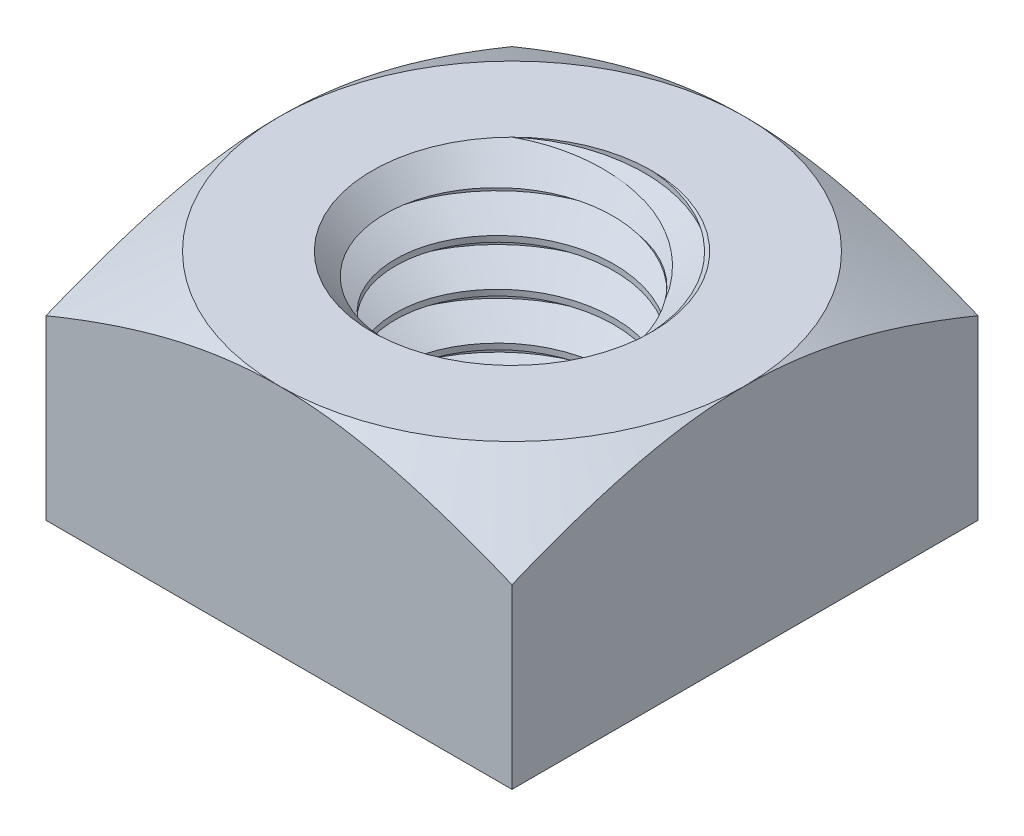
ISO-10303-21;
HEADER;
FILE_DESCRIPTION(('STEP AP214'),'2;1');
FILE_NAME('part.step','',(''),(''),'','','');
FILE_SCHEMA(('AUTOMOTIVE_DESIGN { 1 0 10303 214 1 1 1 1 }'));
ENDSEC;
DATA;
#1=APPLICATION_CONTEXT('core data for automotive mechanical design processes');
#2=APPLICATION_PROTOCOL_DEFINITION('international standard','automotive_design',2000,#1);
#3=PRODUCT_CONTEXT('',#1,'mechanical');
#4=PRODUCT('Part','Part','',(#3));
#5=PRODUCT_RELATED_PRODUCT_CATEGORY('part','',(#4));
#6=PRODUCT_DEFINITION_FORMATION('','',#4);
#7=PRODUCT_DEFINITION_CONTEXT('part definition',#1,'design');
#8=PRODUCT_DEFINITION('design','',#6,#7);
#9=PRODUCT_DEFINITION_SHAPE('','',#8);
#10=(LENGTH_UNIT() NAMED_UNIT(*) SI_UNIT(.MILLI.,.METRE.));
#11=(NAMED_UNIT(*) PLANE_ANGLE_UNIT() SI_UNIT($,.RADIAN.));
#12=(NAMED_UNIT(*) SI_UNIT($,.STERADIAN.) SOLID_ANGLE_UNIT());
#13=UNCERTAINTY_MEASURE_WITH_UNIT(LENGTH_MEASURE(1.E-05),#10,'distance_accuracy_value','');
#14=(GEOMETRIC_REPRESENTATION_CONTEXT(3) GLOBAL_UNCERTAINTY_ASSIGNED_CONTEXT((#13)) GLOBAL_UNIT_ASSIGNED_CONTEXT((#10,
#11,#12)) REPRESENTATION_CONTEXT('',''));
#15=CARTESIAN_POINT('',(0.,0.,0.));
#16=DIRECTION('',(0.,0.,1.));
#17=DIRECTION('',(1.,0.,0.));
#18=AXIS2_PLACEMENT_3D('',#15,#16,#17);
#19=CARTESIAN_POINT('',(0.,2.875,-2.35048094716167));
#20=CARTESIAN_POINT('',(0.973601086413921,2.8125,-2.35048094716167));
#21=CARTESIAN_POINT('',(1.66204101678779,2.75,-1.66204101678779));
#22=CARTESIAN_POINT('',(2.35048094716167,2.6875,-0.973601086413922));
#23=CARTESIAN_POINT('',(2.35048094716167,2.625,0.));
#24=CARTESIAN_POINT('',(2.35048094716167,2.5625,0.973601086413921));
#25=CARTESIAN_POINT('',(1.66204101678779,2.5,1.66204101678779));
#26=CARTESIAN_POINT('',(0.973601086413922,2.4375,2.35048094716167));
#27=CARTESIAN_POINT('',(0.,2.375,2.35048094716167));
#28=CARTESIAN_POINT('',(-0.973601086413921,2.3125,2.35048094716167));
#29=CARTESIAN_POINT('',(-1.66204101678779,2.25,1.6620410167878));
#30=CARTESIAN_POINT('',(-2.35048094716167,2.1875,0.973601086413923));
#31=CARTESIAN_POINT('',(-2.35048094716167,2.125,0.));
#32=CARTESIAN_POINT('',(-2.35048094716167,2.0625,-0.973601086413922));
#33=CARTESIAN_POINT('',(-1.6620410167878,2.,-1.66204101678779));
#34=CARTESIAN_POINT('',(-0.973601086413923,1.9375,-2.35048094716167));
#35=CARTESIAN_POINT('',(0.,1.875,-2.35048094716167));
#36=CARTESIAN_POINT('',(0.973601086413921,1.8125,-2.35048094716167));
#37=CARTESIAN_POINT('',(1.66204101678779,1.75,-1.66204101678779));
#38=CARTESIAN_POINT('',(2.35048094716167,1.6875,-0.973601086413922));
#39=CARTESIAN_POINT('',(2.35048094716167,1.625,0.));
#40=CARTESIAN_POINT('',(2.35048094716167,1.5625,0.973601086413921));
#41=CARTESIAN_POINT('',(1.66204101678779,1.5,1.66204101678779));
#42=CARTESIAN_POINT('',(0.973601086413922,1.4375,2.35048094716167));
#43=CARTESIAN_POINT('',(0.,1.375,2.35048094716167));
#44=CARTESIAN_POINT('',(-0.973601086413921,1.3125,2.35048094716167));
#45=CARTESIAN_POINT('',(-1.66204101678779,1.25,1.6620410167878));
#46=CARTESIAN_POINT('',(-2.35048094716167,1.1875,0.973601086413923));
#47=CARTESIAN_POINT('',(-2.35048094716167,1.125,0.));
#48=CARTESIAN_POINT('',(-2.35048094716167,1.0625,-0.973601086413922));
#49=CARTESIAN_POINT('',(-1.6620410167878,1.,-1.66204101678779));
#50=CARTESIAN_POINT('',(-0.973601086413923,0.9375,-2.35048094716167));
#51=CARTESIAN_POINT('',(0.,0.875,-2.35048094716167));
#52=CARTESIAN_POINT('',(0.973601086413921,0.8125,-2.35048094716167));
#53=CARTESIAN_POINT('',(1.66204101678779,0.75,-1.66204101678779));
#54=CARTESIAN_POINT('',(2.35048094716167,0.6875,-0.973601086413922));
#55=CARTESIAN_POINT('',(2.35048094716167,0.625,0.));
#56=CARTESIAN_POINT('',(2.35048094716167,0.5625,0.973601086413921));
#57=CARTESIAN_POINT('',(1.66204101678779,0.5,1.66204101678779));
#58=CARTESIAN_POINT('',(0.973601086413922,0.4375,2.35048094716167));
#59=CARTESIAN_POINT('',(0.,0.375,2.35048094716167));
#60=CARTESIAN_POINT('',(-0.973601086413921,0.3125,2.35048094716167));
#61=CARTESIAN_POINT('',(-1.66204101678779,0.25,1.6620410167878));
#62=CARTESIAN_POINT('',(-2.35048094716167,0.1875,0.973601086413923));
#63=CARTESIAN_POINT('',(-2.35048094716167,0.125,0.));
#64=CARTESIAN_POINT('',(-2.35048094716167,0.0625000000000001,-0.973601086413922));
#65=CARTESIAN_POINT('',(-1.6620410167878,0.,-1.66204101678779));
#66=CARTESIAN_POINT('',(-0.973601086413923,-0.0625000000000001,-2.35048094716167));
#67=CARTESIAN_POINT('',(0.,-0.125,-2.35048094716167));
#68=CARTESIAN_POINT('',(0.973601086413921,-0.1875,-2.35048094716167));
#69=CARTESIAN_POINT('',(1.66204101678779,-0.25,-1.66204101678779));
#70=CARTESIAN_POINT('',(2.35048094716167,-0.3125,-0.973601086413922));
#71=CARTESIAN_POINT('',(2.35048094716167,-0.375,0.));
#72=CARTESIAN_POINT('',(2.35048094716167,-0.4375,0.973601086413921));
#73=CARTESIAN_POINT('',(1.66204101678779,-0.5,1.66204101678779));
#74=CARTESIAN_POINT('',(0.973601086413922,-0.5625,2.35048094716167));
#75=CARTESIAN_POINT('',(0.,-0.625,2.35048094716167));
#76=CARTESIAN_POINT('',(-0.973601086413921,-0.6875,2.35048094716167));
#77=CARTESIAN_POINT('',(-1.66204101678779,-0.75,1.6620410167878));
#78=CARTESIAN_POINT('',(-2.35048094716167,-0.8125,0.973601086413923));
#79=CARTESIAN_POINT('',(-2.35048094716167,-0.875,0.));
#80=CARTESIAN_POINT('',(-2.35048094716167,-0.9375,-0.973601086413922));
#81=CARTESIAN_POINT('',(-1.6620410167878,-1.,-1.66204101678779));
#82=CARTESIAN_POINT('',(-0.973601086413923,-1.0625,-2.35048094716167));
#83=CARTESIAN_POINT('',(0.,-1.125,-2.35048094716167));
#84=CARTESIAN_POINT('',(0.973601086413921,-1.1875,-2.35048094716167));
#85=CARTESIAN_POINT('',(1.66204101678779,-1.25,-1.66204101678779));
#86=CARTESIAN_POINT('',(2.35048094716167,-1.3125,-0.973601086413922));
#87=CARTESIAN_POINT('',(2.35048094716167,-1.375,0.));
#88=CARTESIAN_POINT('',(2.35048094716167,-1.4375,0.973601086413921));
#89=CARTESIAN_POINT('',(1.66204101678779,-1.5,1.66204101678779));
#90=CARTESIAN_POINT('',(0.973601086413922,-1.5625,2.35048094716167));
#91=CARTESIAN_POINT('',(0.,-1.625,2.35048094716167));
#92=CARTESIAN_POINT('',(-0.973601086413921,-1.6875,2.35048094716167));
#93=CARTESIAN_POINT('',(-1.66204101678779,-1.75,1.6620410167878));
#94=CARTESIAN_POINT('',(-2.35048094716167,-1.8125,0.973601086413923));
#95=CARTESIAN_POINT('',(-2.35048094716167,-1.875,0.));
#96=CARTESIAN_POINT('',(-2.35048094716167,-1.9375,-0.973601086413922));
#97=CARTESIAN_POINT('',(-1.6620410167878,-2.,-1.66204101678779));
#98=CARTESIAN_POINT('',(-0.973601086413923,-2.0625,-2.35048094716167));
#99=CARTESIAN_POINT('',(0.,-2.125,-2.35048094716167));
#100=CARTESIAN_POINT('',(0.973601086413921,-2.1875,-2.35048094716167));
#101=CARTESIAN_POINT('',(1.66204101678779,-2.25,-1.66204101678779));
#102=CARTESIAN_POINT('',(2.35048094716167,-2.3125,-0.973601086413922));
#103=CARTESIAN_POINT('',(2.35048094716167,-2.375,0.));
#104=CARTESIAN_POINT('',(2.35048094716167,-2.4375,0.973601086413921));
#105=CARTESIAN_POINT('',(1.66204101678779,-2.5,1.66204101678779));
#106=CARTESIAN_POINT('',(0.973601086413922,-2.5625,2.35048094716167));
#107=CARTESIAN_POINT('',(0.,-2.625,2.35048094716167));
#108=CARTESIAN_POINT('',(-0.973601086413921,-2.6875,2.35048094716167));
#109=CARTESIAN_POINT('',(-1.66204101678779,-2.75,1.6620410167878));
#110=CARTESIAN_POINT('',(-2.35048094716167,-2.8125,0.973601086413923));
#111=CARTESIAN_POINT('',(-2.35048094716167,-2.875,0.));
#112=CARTESIAN_POINT('',(-2.35048094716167,-2.9375,-0.973601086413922));
#113=CARTESIAN_POINT('',(-1.6620410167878,-3.,-1.66204101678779));
#114=CARTESIAN_POINT('',(-0.973601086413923,-3.0625,-2.35048094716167));
#115=CARTESIAN_POINT('',(0.,-3.125,-2.35048094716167));
#116=CARTESIAN_POINT('',(0.,2.5,-3.));
#117=CARTESIAN_POINT('',(1.24264068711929,2.4375,-3.));
#118=CARTESIAN_POINT('',(2.12132034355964,2.375,-2.12132034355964));
#119=CARTESIAN_POINT('',(3.,2.3125,-1.24264068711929));
#120=CARTESIAN_POINT('',(3.,2.25,0.));
#121=CARTESIAN_POINT('',(3.,2.1875,1.24264068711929));
#122=CARTESIAN_POINT('',(2.12132034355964,2.125,2.12132034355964));
#123=CARTESIAN_POINT('',(1.24264068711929,2.0625,3.));
#124=CARTESIAN_POINT('',(0.,2.,3.));
#125=CARTESIAN_POINT('',(-1.24264068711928,1.9375,3.));
#126=CARTESIAN_POINT('',(-2.12132034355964,1.875,2.12132034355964));
#127=CARTESIAN_POINT('',(-3.,1.8125,1.24264068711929));
#128=CARTESIAN_POINT('',(-3.,1.75,0.));
#129=CARTESIAN_POINT('',(-3.,1.6875,-1.24264068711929));
#130=CARTESIAN_POINT('',(-2.12132034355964,1.625,-2.12132034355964));
#131=CARTESIAN_POINT('',(-1.24264068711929,1.5625,-3.));
#132=CARTESIAN_POINT('',(0.,1.5,-3.));
#133=CARTESIAN_POINT('',(1.24264068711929,1.4375,-3.));
#134=CARTESIAN_POINT('',(2.12132034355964,1.375,-2.12132034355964));
#135=CARTESIAN_POINT('',(3.,1.3125,-1.24264068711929));
#136=CARTESIAN_POINT('',(3.,1.25,0.));
#137=CARTESIAN_POINT('',(3.,1.1875,1.24264068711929));
#138=CARTESIAN_POINT('',(2.12132034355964,1.125,2.12132034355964));
#139=CARTESIAN_POINT('',(1.24264068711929,1.0625,3.));
#140=CARTESIAN_POINT('',(0.,1.,3.));
#141=CARTESIAN_POINT('',(-1.24264068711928,0.9375,3.));
#142=CARTESIAN_POINT('',(-2.12132034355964,0.875,2.12132034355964));
#143=CARTESIAN_POINT('',(-3.,0.8125,1.24264068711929));
#144=CARTESIAN_POINT('',(-3.,0.75,0.));
#145=CARTESIAN_POINT('',(-3.,0.6875,-1.24264068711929));
#146=CARTESIAN_POINT('',(-2.12132034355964,0.625,-2.12132034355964));
#147=CARTESIAN_POINT('',(-1.24264068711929,0.5625,-3.));
#148=CARTESIAN_POINT('',(0.,0.5,-3.));
#149=CARTESIAN_POINT('',(1.24264068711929,0.4375,-3.));
#150=CARTESIAN_POINT('',(2.12132034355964,0.375,-2.12132034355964));
#151=CARTESIAN_POINT('',(3.,0.3125,-1.24264068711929));
#152=CARTESIAN_POINT('',(3.,0.25,0.));
#153=CARTESIAN_POINT('',(3.,0.1875,1.24264068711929));
#154=CARTESIAN_POINT('',(2.12132034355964,0.125,2.12132034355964));
#155=CARTESIAN_POINT('',(1.24264068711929,0.0625000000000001,3.));
#156=CARTESIAN_POINT('',(0.,0.,3.));
#157=CARTESIAN_POINT('',(-1.24264068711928,-0.0625000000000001,3.));
#158=CARTESIAN_POINT('',(-2.12132034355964,-0.125,2.12132034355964));
#159=CARTESIAN_POINT('',(-3.,-0.1875,1.24264068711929));
#160=CARTESIAN_POINT('',(-3.,-0.25,0.));
#161=CARTESIAN_POINT('',(-3.,-0.3125,-1.24264068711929));
#162=CARTESIAN_POINT('',(-2.12132034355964,-0.375,-2.12132034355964));
#163=CARTESIAN_POINT('',(-1.24264068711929,-0.4375,-3.));
#164=CARTESIAN_POINT('',(0.,-0.5,-3.));
#165=CARTESIAN_POINT('',(1.24264068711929,-0.5625,-3.));
#166=CARTESIAN_POINT('',(2.12132034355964,-0.625,-2.12132034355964));
#167=CARTESIAN_POINT('',(3.,-0.6875,-1.24264068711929));
#168=CARTESIAN_POINT('',(3.,-0.75,0.));
#169=CARTESIAN_POINT('',(3.,-0.8125,1.24264068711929));
#170=CARTESIAN_POINT('',(2.12132034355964,-0.875,2.12132034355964));
#171=CARTESIAN_POINT('',(1.24264068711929,-0.9375,3.));
#172=CARTESIAN_POINT('',(0.,-1.,3.));
#173=CARTESIAN_POINT('',(-1.24264068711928,-1.0625,3.));
#174=CARTESIAN_POINT('',(-2.12132034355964,-1.125,2.12132034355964));
#175=CARTESIAN_POINT('',(-3.,-1.1875,1.24264068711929));
#176=CARTESIAN_POINT('',(-3.,-1.25,0.));
#177=CARTESIAN_POINT('',(-3.,-1.3125,-1.24264068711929));
#178=CARTESIAN_POINT('',(-2.12132034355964,-1.375,-2.12132034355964));
#179=CARTESIAN_POINT('',(-1.24264068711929,-1.4375,-3.));
#180=CARTESIAN_POINT('',(0.,-1.5,-3.));
#181=CARTESIAN_POINT('',(1.24264068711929,-1.5625,-3.));
#182=CARTESIAN_POINT('',(2.12132034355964,-1.625,-2.12132034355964));
#183=CARTESIAN_POINT('',(3.,-1.6875,-1.24264068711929));
#184=CARTESIAN_POINT('',(3.,-1.75,0.));
#185=CARTESIAN_POINT('',(3.,-1.8125,1.24264068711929));
#186=CARTESIAN_POINT('',(2.12132034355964,-1.875,2.12132034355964));
#187=CARTESIAN_POINT('',(1.24264068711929,-1.9375,3.));
#188=CARTESIAN_POINT('',(0.,-2.,3.));
#189=CARTESIAN_POINT('',(-1.24264068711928,-2.0625,3.));
#190=CARTESIAN_POINT('',(-2.12132034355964,-2.125,2.12132034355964));
#191=CARTESIAN_POINT('',(-3.,-2.1875,1.24264068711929));
#192=CARTESIAN_POINT('',(-3.,-2.25,0.));
#193=CARTESIAN_POINT('',(-3.,-2.3125,-1.24264068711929));
#194=CARTESIAN_POINT('',(-2.12132034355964,-2.375,-2.12132034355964));
#195=CARTESIAN_POINT('',(-1.24264068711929,-2.4375,-3.));
#196=CARTESIAN_POINT('',(0.,-2.5,-3.));
#197=CARTESIAN_POINT('',(1.24264068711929,-2.5625,-3.));
#198=CARTESIAN_POINT('',(2.12132034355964,-2.625,-2.12132034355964));
#199=CARTESIAN_POINT('',(3.,-2.6875,-1.24264068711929));
#200=CARTESIAN_POINT('',(3.,-2.75,0.));
#201=CARTESIAN_POINT('',(3.,-2.8125,1.24264068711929));
#202=CARTESIAN_POINT('',(2.12132034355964,-2.875,2.12132034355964));
#203=CARTESIAN_POINT('',(1.24264068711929,-2.9375,3.));
#204=CARTESIAN_POINT('',(0.,-3.,3.));
#205=CARTESIAN_POINT('',(-1.24264068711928,-3.0625,3.));
#206=CARTESIAN_POINT('',(-2.12132034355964,-3.125,2.12132034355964));
#207=CARTESIAN_POINT('',(-3.,-3.1875,1.24264068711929));
#208=CARTESIAN_POINT('',(-3.,-3.25,0.));
#209=CARTESIAN_POINT('',(-3.,-3.3125,-1.24264068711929));
#210=CARTESIAN_POINT('',(-2.12132034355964,-3.375,-2.12132034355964));
#211=CARTESIAN_POINT('',(-1.24264068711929,-3.4375,-3.));
#212=CARTESIAN_POINT('',(0.,-3.5,-3.));
#213=(BOUNDED_SURFACE() B_SPLINE_SURFACE(1,2,((#19,#20,#21,#22,#23,#24,#25,#26,#27,#28,#29,#30,
#31,#32,#33,#34,#35,#36,#37,#38,#39,#40,#41,#42,#43,#44,#45,#46,#47,#48,#49,#50,#51,#52,#53,#54,
#55,#56,#57,#58,#59,#60,#61,#62,#63,#64,#65,#66,#67,#68,#69,#70,#71,#72,#73,#74,#75,#76,#77,#78,
#79,#80,#81,#82,#83,#84,#85,#86,#87,#88,#89,#90,#91,#92,#93,#94,#95,#96,#97,#98,#99,#100,#101,
#102,#103,#104,#105,#106,#107,#108,#109,#110,#111,#112,#113,#114,#115),(#116,#117,#118,#119,
#120,#121,#122,#123,#124,#125,#126,#127,#128,#129,#130,#131,#132,#133,#134,#135,#136,#137,#138,
#139,#140,#141,#142,#143,#144,#145,#146,#147,#148,#149,#150,#151,#152,#153,#154,#155,#156,#157,
#158,#159,#160,#161,#162,#163,#164,#165,#166,#167,#168,#169,#170,#171,#172,#173,#174,#175,#176,
#177,#178,#179,#180,#181,#182,#183,#184,#185,#186,#187,#188,#189,#190,#191,#192,#193,#194,#195,
#196,#197,#198,#199,#200,#201,#202,#203,#204,#205,#206,#207,#208,#209,#210,#211,#212)),
.UNSPECIFIED.,.F.,.F.,.F.) B_SPLINE_SURFACE_WITH_KNOTS((2,2),(3,2,2,2,2,2,2,2,2,2,2,2,2,2,2,2,2,
2,2,2,2,2,2,2,2,2,2,2,2,2,2,2,2,2,2,2,2,2,2,2,2,2,2,2,2,2,2,2,3),(0.,1.),(0.,0.0208333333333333,
0.0416666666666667,0.0625,0.0833333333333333,0.104166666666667,0.125,0.145833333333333,
0.166666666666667,0.1875,0.208333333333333,0.229166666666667,0.25,0.270833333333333,
0.291666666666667,0.3125,0.333333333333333,0.354166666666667,0.375,0.395833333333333,
0.416666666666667,0.4375,0.458333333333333,0.479166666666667,0.5,0.520833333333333,
0.541666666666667,0.5625,0.583333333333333,0.604166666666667,0.625,0.645833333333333,
0.666666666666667,0.6875,0.708333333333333,0.729166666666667,0.75,0.770833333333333,
0.791666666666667,0.8125,0.833333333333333,0.854166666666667,0.875,0.895833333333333,
0.916666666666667,0.9375,0.958333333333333,0.979166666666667,1.),
.UNSPECIFIED.) GEOMETRIC_REPRESENTATION_ITEM() RATIONAL_B_SPLINE_SURFACE(((1.,0.923879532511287,
1.,0.923879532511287,1.,0.923879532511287,1.,0.923879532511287,1.,0.923879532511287,1.,
0.923879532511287,1.,0.923879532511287,1.,0.923879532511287,1.,0.923879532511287,1.,
0.923879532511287,1.,0.923879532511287,1.,0.923879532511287,1.,0.923879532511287,1.,
0.923879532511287,1.,0.923879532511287,1.,0.923879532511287,1.,0.923879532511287,1.,
0.923879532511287,1.,0.923879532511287,1.,0.923879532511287,1.,0.923879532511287,1.,
0.923879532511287,1.,0.923879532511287,1.,0.923879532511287,1.,0.923879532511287,1.,
0.923879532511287,1.,0.923879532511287,1.,0.923879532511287,1.,0.923879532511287,1.,
0.923879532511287,1.,0.923879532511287,1.,0.923879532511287,1.,0.923879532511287,1.,
0.923879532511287,1.,0.923879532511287,1.,0.923879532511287,1.,0.923879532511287,1.,
0.923879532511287,1.,0.923879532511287,1.,0.923879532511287,1.,0.923879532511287,1.,
0.923879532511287,1.,0.923879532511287,1.,0.923879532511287,1.,0.923879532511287,1.,
0.923879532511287,1.,0.923879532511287,1.,0.923879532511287,1.),(1.,0.923879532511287,1.,
0.923879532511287,1.,0.923879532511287,1.,0.923879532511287,1.,0.923879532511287,1.,
0.923879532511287,1.,0.923879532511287,1.,0.923879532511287,1.,0.923879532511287,1.,
0.923879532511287,1.,0.923879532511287,1.,0.923879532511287,1.,0.923879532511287,1.,
0.923879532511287,1.,0.923879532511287,1.,0.923879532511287,1.,0.923879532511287,1.,
0.923879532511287,1.,0.923879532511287,1.,0.923879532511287,1.,0.923879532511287,1.,
0.923879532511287,1.,0.923879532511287,1.,0.923879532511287,1.,0.923879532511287,1.,
0.923879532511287,1.,0.923879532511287,1.,0.923879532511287,1.,0.923879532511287,1.,
0.923879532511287,1.,0.923879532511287,1.,0.923879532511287,1.,0.923879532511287,1.,
0.923879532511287,1.,0.923879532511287,1.,0.923879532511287,1.,0.923879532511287,1.,
0.923879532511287,1.,0.923879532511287,1.,0.923879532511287,1.,0.923879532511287,1.,
0.923879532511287,1.,0.923879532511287,1.,0.923879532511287,1.,0.923879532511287,1.,
0.923879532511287,1.,0.923879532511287,1.,0.923879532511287,1.))) REPRESENTATION_ITEM('') SURFACE());
#214=CARTESIAN_POINT('',(0.,2.5,-3.));
#215=CARTESIAN_POINT('',(1.24264068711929,2.4375,-3.));
#216=CARTESIAN_POINT('',(2.12132034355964,2.375,-2.12132034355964));
#217=CARTESIAN_POINT('',(3.,2.3125,-1.24264068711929));
#218=CARTESIAN_POINT('',(3.,2.25,0.));
#219=CARTESIAN_POINT('',(3.,2.1875,1.24264068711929));
#220=CARTESIAN_POINT('',(2.12132034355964,2.125,2.12132034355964));
#221=CARTESIAN_POINT('',(1.24264068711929,2.0625,3.));
#222=CARTESIAN_POINT('',(0.,2.,3.));
#223=CARTESIAN_POINT('',(-1.24264068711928,1.9375,3.));
#224=CARTESIAN_POINT('',(-2.12132034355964,1.875,2.12132034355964));
#225=CARTESIAN_POINT('',(-3.,1.8125,1.24264068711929));
#226=CARTESIAN_POINT('',(-3.,1.75,0.));
#227=CARTESIAN_POINT('',(-3.,1.6875,-1.24264068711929));
#228=CARTESIAN_POINT('',(-2.12132034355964,1.625,-2.12132034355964));
#229=CARTESIAN_POINT('',(-1.24264068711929,1.5625,-3.));
#230=CARTESIAN_POINT('',(0.,1.5,-3.));
#231=CARTESIAN_POINT('',(1.24264068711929,1.4375,-3.));
#232=CARTESIAN_POINT('',(2.12132034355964,1.375,-2.12132034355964));
#233=CARTESIAN_POINT('',(3.,1.3125,-1.24264068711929));
#234=CARTESIAN_POINT('',(3.,1.25,0.));
#235=CARTESIAN_POINT('',(3.,1.1875,1.24264068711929));
#236=CARTESIAN_POINT('',(2.12132034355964,1.125,2.12132034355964));
#237=CARTESIAN_POINT('',(1.24264068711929,1.0625,3.));
#238=CARTESIAN_POINT('',(0.,1.,3.));
#239=CARTESIAN_POINT('',(-1.24264068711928,0.9375,3.));
#240=CARTESIAN_POINT('',(-2.12132034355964,0.875,2.12132034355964));
#241=CARTESIAN_POINT('',(-3.,0.8125,1.24264068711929));
#242=CARTESIAN_POINT('',(-3.,0.75,0.));
#243=CARTESIAN_POINT('',(-3.,0.6875,-1.24264068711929));
#244=CARTESIAN_POINT('',(-2.12132034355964,0.625,-2.12132034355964));
#245=CARTESIAN_POINT('',(-1.24264068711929,0.5625,-3.));
#246=CARTESIAN_POINT('',(0.,0.5,-3.));
#247=CARTESIAN_POINT('',(1.24264068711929,0.4375,-3.));
#248=CARTESIAN_POINT('',(2.12132034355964,0.375,-2.12132034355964));
#249=CARTESIAN_POINT('',(3.,0.3125,-1.24264068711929));
#250=CARTESIAN_POINT('',(3.,0.25,0.));
#251=CARTESIAN_POINT('',(3.,0.1875,1.24264068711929));
#252=CARTESIAN_POINT('',(2.12132034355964,0.125,2.12132034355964));
#253=CARTESIAN_POINT('',(1.24264068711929,0.0625000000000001,3.));
#254=CARTESIAN_POINT('',(0.,0.,3.));
#255=CARTESIAN_POINT('',(-1.24264068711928,-0.0625000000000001,3.));
#256=CARTESIAN_POINT('',(-2.12132034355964,-0.125,2.12132034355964));
#257=CARTESIAN_POINT('',(-3.,-0.1875,1.24264068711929));
#258=CARTESIAN_POINT('',(-3.,-0.25,0.));
#259=CARTESIAN_POINT('',(-3.,-0.3125,-1.24264068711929));
#260=CARTESIAN_POINT('',(-2.12132034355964,-0.375,-2.12132034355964));
#261=CARTESIAN_POINT('',(-1.24264068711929,-0.4375,-3.));
#262=CARTESIAN_POINT('',(0.,-0.5,-3.));
#263=CARTESIAN_POINT('',(1.24264068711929,-0.5625,-3.));
#264=CARTESIAN_POINT('',(2.12132034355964,-0.625,-2.12132034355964));
#265=CARTESIAN_POINT('',(3.,-0.6875,-1.24264068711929));
#266=CARTESIAN_POINT('',(3.,-0.75,0.));
#267=CARTESIAN_POINT('',(3.,-0.8125,1.24264068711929));
#268=CARTESIAN_POINT('',(2.12132034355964,-0.875,2.12132034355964));
#269=CARTESIAN_POINT('',(1.24264068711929,-0.9375,3.));
#270=CARTESIAN_POINT('',(0.,-1.,3.));
#271=CARTESIAN_POINT('',(-1.24264068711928,-1.0625,3.));
#272=CARTESIAN_POINT('',(-2.12132034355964,-1.125,2.12132034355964));
#273=CARTESIAN_POINT('',(-3.,-1.1875,1.24264068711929));
#274=CARTESIAN_POINT('',(-3.,-1.25,0.));
#275=CARTESIAN_POINT('',(-3.,-1.3125,-1.24264068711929));
#276=CARTESIAN_POINT('',(-2.12132034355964,-1.375,-2.12132034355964));
#277=CARTESIAN_POINT('',(-1.24264068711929,-1.4375,-3.));
#278=CARTESIAN_POINT('',(0.,-1.5,-3.));
#279=CARTESIAN_POINT('',(1.24264068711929,-1.5625,-3.));
#280=CARTESIAN_POINT('',(2.12132034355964,-1.625,-2.12132034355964));
#281=CARTESIAN_POINT('',(3.,-1.6875,-1.24264068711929));
#282=CARTESIAN_POINT('',(3.,-1.75,0.));
#283=CARTESIAN_POINT('',(3.,-1.8125,1.24264068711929));
#284=CARTESIAN_POINT('',(2.12132034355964,-1.875,2.12132034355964));
#285=CARTESIAN_POINT('',(1.24264068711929,-1.9375,3.));
#286=CARTESIAN_POINT('',(0.,-2.,3.));
#287=CARTESIAN_POINT('',(-1.24264068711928,-2.0625,3.));
#288=CARTESIAN_POINT('',(-2.12132034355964,-2.125,2.12132034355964));
#289=CARTESIAN_POINT('',(-3.,-2.1875,1.24264068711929));
#290=CARTESIAN_POINT('',(-3.,-2.25,0.));
#291=CARTESIAN_POINT('',(-3.,-2.3125,-1.24264068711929));
#292=CARTESIAN_POINT('',(-2.12132034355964,-2.375,-2.12132034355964));
#293=CARTESIAN_POINT('',(-1.24264068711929,-2.4375,-3.));
#294=CARTESIAN_POINT('',(0.,-2.5,-3.));
#295=CARTESIAN_POINT('',(1.24264068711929,-2.5625,-3.));
#296=CARTESIAN_POINT('',(2.12132034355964,-2.625,-2.12132034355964));
#297=CARTESIAN_POINT('',(3.,-2.6875,-1.24264068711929));
#298=CARTESIAN_POINT('',(3.,-2.75,0.));
#299=CARTESIAN_POINT('',(3.,-2.8125,1.24264068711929));
#300=CARTESIAN_POINT('',(2.12132034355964,-2.875,2.12132034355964));
#301=CARTESIAN_POINT('',(1.24264068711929,-2.9375,3.));
#302=CARTESIAN_POINT('',(0.,-3.,3.));
#303=CARTESIAN_POINT('',(-1.24264068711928,-3.0625,3.));
#304=CARTESIAN_POINT('',(-2.12132034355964,-3.125,2.12132034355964));
#305=CARTESIAN_POINT('',(-3.,-3.1875,1.24264068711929));
#306=CARTESIAN_POINT('',(-3.,-3.25,0.));
#307=CARTESIAN_POINT('',(-3.,-3.3125,-1.24264068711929));
#308=CARTESIAN_POINT('',(-2.12132034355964,-3.375,-2.12132034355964));
#309=CARTESIAN_POINT('',(-1.24264068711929,-3.4375,-3.));
#310=CARTESIAN_POINT('',(0.,-3.5,-3.));
#311=(BOUNDED_CURVE() B_SPLINE_CURVE(2,(#214,#215,#216,#217,#218,#219,#220,#221,#222,#223,#224,
#225,#226,#227,#228,#229,#230,#231,#232,#233,#234,#235,#236,#237,#238,#239,#240,#241,#242,#243,
#244,#245,#246,#247,#248,#249,#250,#251,#252,#253,#254,#255,#256,#257,#258,#259,#260,#261,#262,
#263,#264,#265,#266,#267,#268,#269,#270,#271,#272,#273,#274,#275,#276,#277,#278,#279,#280,#281,
#282,#283,#284,#285,#286,#287,#288,#289,#290,#291,#292,#293,#294,#295,#296,#297,#298,#299,#300,
#301,#302,#303,#304,#305,#306,#307,#308,#309,#310),.UNSPECIFIED.,.F.,
.F.) B_SPLINE_CURVE_WITH_KNOTS((3,2,2,2,2,2,2,2,2,2,2,2,2,2,2,2,2,2,2,2,2,2,2,2,2,2,2,2,2,2,2,2,
2,2,2,2,2,2,2,2,2,2,2,2,2,2,2,2,3),(0.,0.0208333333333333,0.0416666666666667,0.0625,
0.0833333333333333,0.104166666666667,0.125,0.145833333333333,0.166666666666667,0.1875,
0.208333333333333,0.229166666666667,0.25,0.270833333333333,0.291666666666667,0.3125,
0.333333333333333,0.354166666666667,0.375,0.395833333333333,0.416666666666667,0.4375,
0.458333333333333,0.479166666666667,0.5,0.520833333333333,0.541666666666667,0.5625,
0.583333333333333,0.604166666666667,0.625,0.645833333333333,0.666666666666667,0.6875,
0.708333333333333,0.729166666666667,0.75,0.770833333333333,0.791666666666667,0.8125,
0.833333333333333,0.854166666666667,0.875,0.895833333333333,0.916666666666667,0.9375,
0.958333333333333,0.979166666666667,1.),
.UNSPECIFIED.) CURVE() GEOMETRIC_REPRESENTATION_ITEM() RATIONAL_B_SPLINE_CURVE((1.,
0.923879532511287,1.,0.923879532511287,1.,0.923879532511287,1.,0.923879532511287,1.,
0.923879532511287,1.,0.923879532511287,1.,0.923879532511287,1.,0.923879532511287,1.,
0.923879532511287,1.,0.923879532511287,1.,0.923879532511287,1.,0.923879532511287,1.,
0.923879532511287,1.,0.923879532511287,1.,0.923879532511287,1.,0.923879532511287,1.,
0.923879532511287,1.,0.923879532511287,1.,0.923879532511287,1.,0.923879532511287,1.,
0.923879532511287,1.,0.923879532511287,1.,0.923879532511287,1.,0.923879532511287,1.,
0.923879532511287,1.,0.923879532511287,1.,0.923879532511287,1.,0.923879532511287,1.,
0.923879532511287,1.,0.923879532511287,1.,0.923879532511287,1.,0.923879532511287,1.,
0.923879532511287,1.,0.923879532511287,1.,0.923879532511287,1.,0.923879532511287,1.,
0.923879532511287,1.,0.923879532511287,1.,0.923879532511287,1.,0.923879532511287,1.,
0.923879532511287,1.,0.923879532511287,1.,0.923879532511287,1.,0.923879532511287,1.,
0.923879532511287,1.,0.923879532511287,1.,0.923879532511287,1.,0.923879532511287,1.)) REPRESENTATION_ITEM(''));
#312=CARTESIAN_POINT('',(0.,2.5,-3.));
#313=VERTEX_POINT('',#312);
#314=CARTESIAN_POINT('',(0.,-2.5,-3.));
#315=VERTEX_POINT('',#314);
#316=EDGE_CURVE('E133',#313,#315,#311,.T.);
#317=CARTESIAN_POINT('',(0.,-2.5,-3.));
#318=CARTESIAN_POINT('',(-0.0663739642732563,-2.49210162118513,-2.99210310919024));
#319=CARTESIAN_POINT('',(-0.132436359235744,-2.48406883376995,-2.9818658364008));
#320=CARTESIAN_POINT('',(-0.263635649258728,-2.46776079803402,-2.95677061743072));
#321=CARTESIAN_POINT('',(-0.328772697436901,-2.45948559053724,-2.94191344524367));
#322=CARTESIAN_POINT('',(-0.52226179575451,-2.43434661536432,-2.89052727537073));
#323=CARTESIAN_POINT('',(-0.648809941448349,-2.41715546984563,-2.84716947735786));
#324=CARTESIAN_POINT('',(-0.919328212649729,-2.37863208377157,-2.73250758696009));
#325=CARTESIAN_POINT('',(-1.06166215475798,-2.35716412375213,-2.65733007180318));
#326=CARTESIAN_POINT('',(-1.2639841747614,-2.32472711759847,-2.52740515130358));
#327=CARTESIAN_POINT('',(-1.32962116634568,-2.31386472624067,-2.48118274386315));
#328=CARTESIAN_POINT('',(-1.45674675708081,-2.29212862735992,-2.38331263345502));
#329=CARTESIAN_POINT('',(-1.5182351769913,-2.28125491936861,-2.33166469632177));
#330=CARTESIAN_POINT('',(-1.6366820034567,-2.25956516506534,-2.22324307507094));
#331=CARTESIAN_POINT('',(-1.69363441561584,-2.24874921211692,-2.16646281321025));
#332=CARTESIAN_POINT('',(-1.77527778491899,-2.23264323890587,-2.07781484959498));
#333=CARTESIAN_POINT('',(-1.80186402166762,-2.2272936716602,-2.04768250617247));
#334=CARTESIAN_POINT('',(-1.853740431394,-2.21664962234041,-1.98630741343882));
#335=CARTESIAN_POINT('',(-1.87903060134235,-2.21135514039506,-1.95506466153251));
#336=CARTESIAN_POINT('',(-1.91592515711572,-2.20344895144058,-1.90742311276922));
#337=CARTESIAN_POINT('',(-1.92804322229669,-2.20082097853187,-1.89142245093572));
#338=CARTESIAN_POINT('',(-1.95188723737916,-2.19552631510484,-1.8591380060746));
#339=CARTESIAN_POINT('',(-1.96361319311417,-2.19285962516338,-1.84285422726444));
#340=CARTESIAN_POINT('',(-1.99820631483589,-2.18481888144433,-1.79360108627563));
#341=CARTESIAN_POINT('',(-2.02049112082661,-2.17940364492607,-1.76022684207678));
#342=CARTESIAN_POINT('',(-2.06344314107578,-2.1684650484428,-1.69247941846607));
#343=CARTESIAN_POINT('',(-2.08411063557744,-2.1629417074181,-1.65810641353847));
#344=CARTESIAN_POINT('',(-2.12378926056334,-2.15179681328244,-1.58843390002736));
#345=CARTESIAN_POINT('',(-2.14280031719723,-2.146175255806,-1.55313435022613));
#346=CARTESIAN_POINT('',(-2.19548880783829,-2.12973543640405,-1.44949044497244));
#347=CARTESIAN_POINT('',(-2.22695176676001,-2.11879744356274,-1.3800221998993));
#348=CARTESIAN_POINT('',(-2.28348007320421,-2.09666273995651,-1.23857084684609));
#349=CARTESIAN_POINT('',(-2.30854458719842,-2.08546599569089,-1.16658741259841));
#350=CARTESIAN_POINT('',(-2.35210984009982,-2.0628686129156,-1.02056817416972));
#351=CARTESIAN_POINT('',(-2.37060066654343,-2.05146769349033,-0.946529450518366));
#352=CARTESIAN_POINT('',(-2.40081546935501,-2.02855892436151,-0.797104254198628));
#353=CARTESIAN_POINT('',(-2.41253959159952,-2.01705107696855,-0.721717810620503));
#354=CARTESIAN_POINT('',(-2.42866900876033,-1.99465184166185,-0.574385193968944));
#355=CARTESIAN_POINT('',(-2.43344354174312,-1.9837615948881,-0.502479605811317));
#356=CARTESIAN_POINT('',(-2.43598996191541,-1.96747224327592,-0.394513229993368));
#357=CARTESIAN_POINT('',(-2.43606894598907,-1.96204869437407,-0.358496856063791));
#358=CARTESIAN_POINT('',(-2.43468989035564,-1.95122837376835,-0.2864836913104));
#359=CARTESIAN_POINT('',(-2.43323171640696,-1.94583160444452,-0.250486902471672));
#360=CARTESIAN_POINT('',(-2.42877899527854,-1.93508499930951,-0.178696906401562));
#361=CARTESIAN_POINT('',(-2.42578921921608,-1.92973506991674,-0.142903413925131));
#362=CARTESIAN_POINT('',(-2.41831252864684,-1.91910747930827,-0.0714615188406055));
#363=CARTESIAN_POINT('',(-2.41382560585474,-1.91382981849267,-0.0358131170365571));
#364=CARTESIAN_POINT('',(-2.40325064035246,-1.90324646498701,0.0352129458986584));
#365=CARTESIAN_POINT('',(-2.39716391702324,-1.89794079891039,0.0705908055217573));
#366=CARTESIAN_POINT('',(-2.38328441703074,-1.88718721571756,0.140983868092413));
#367=CARTESIAN_POINT('',(-2.37549190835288,-1.88173932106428,0.175999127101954));
#368=CARTESIAN_POINT('',(-2.36023501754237,-1.87200655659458,0.237591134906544));
#369=CARTESIAN_POINT('',(-2.35310784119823,-1.86774257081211,0.264255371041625));
#370=CARTESIAN_POINT('',(-2.3378831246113,-1.85915632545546,0.317274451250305));
#371=CARTESIAN_POINT('',(-2.32978629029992,-1.85483411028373,0.343629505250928));
#372=CARTESIAN_POINT('',(-2.3212049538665,-1.85048094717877,0.36982191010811));
#373=B_SPLINE_CURVE_WITH_KNOTS('',3,(#317,#318,#319,#320,#321,#322,#323,#324,#325,#326,#327,
#328,#329,#330,#331,#332,#333,#334,#335,#336,#337,#338,#339,#340,#341,#342,#343,#344,#345,#346,
#347,#348,#349,#350,#351,#352,#353,#354,#355,#356,#357,#358,#359,#360,#361,#362,#363,#364,#365,
#366,#367,#368,#369,#370,#371,#372),.UNSPECIFIED.,.F.,.F.,(4,2,2,2,2,2,2,2,2,2,2,2,2,2,2,2,2,2,
2,2,2,2,2,2,2,2,2,4),(0.,0.201846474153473,0.40365915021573,0.806928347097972,1.29155915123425,
1.53435611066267,1.77716355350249,2.0202867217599,2.14187445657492,2.26346247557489,
2.32418668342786,2.38490998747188,2.5063448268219,2.62775857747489,2.74917773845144,
2.97996882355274,3.21078995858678,3.44195768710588,3.6731204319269,3.89148604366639,
4.00072691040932,4.10997731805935,4.21888944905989,4.32780218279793,4.43662537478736,
4.54543148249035,4.6291971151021,4.71290213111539),.UNSPECIFIED.);
#374=CARTESIAN_POINT('',(-2.32120495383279,-1.85048094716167,0.369821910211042));
#375=VERTEX_POINT('',#374);
#376=EDGE_CURVE('E111',#315,#375,#373,.T.);
#377=CARTESIAN_POINT('',(0.,2.875,-2.35048094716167));
#378=CARTESIAN_POINT('',(0.973601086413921,2.8125,-2.35048094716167));
#379=CARTESIAN_POINT('',(1.66204101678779,2.75,-1.66204101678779));
#380=CARTESIAN_POINT('',(2.35048094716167,2.6875,-0.973601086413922));
#381=CARTESIAN_POINT('',(2.35048094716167,2.625,0.));
#382=CARTESIAN_POINT('',(2.35048094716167,2.5625,0.973601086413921));
#383=CARTESIAN_POINT('',(1.66204101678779,2.5,1.66204101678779));
#384=CARTESIAN_POINT('',(0.973601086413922,2.4375,2.35048094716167));
#385=CARTESIAN_POINT('',(0.,2.375,2.35048094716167));
#386=CARTESIAN_POINT('',(-0.973601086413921,2.3125,2.35048094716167));
#387=CARTESIAN_POINT('',(-1.66204101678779,2.25,1.6620410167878));
#388=CARTESIAN_POINT('',(-2.35048094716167,2.1875,0.973601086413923));
#389=CARTESIAN_POINT('',(-2.35048094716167,2.125,0.));
#390=CARTESIAN_POINT('',(-2.35048094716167,2.0625,-0.973601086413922));
#391=CARTESIAN_POINT('',(-1.6620410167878,2.,-1.66204101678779));
#392=CARTESIAN_POINT('',(-0.973601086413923,1.9375,-2.35048094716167));
#393=CARTESIAN_POINT('',(0.,1.875,-2.35048094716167));
#394=CARTESIAN_POINT('',(0.973601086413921,1.8125,-2.35048094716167));
#395=CARTESIAN_POINT('',(1.66204101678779,1.75,-1.66204101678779));
#396=CARTESIAN_POINT('',(2.35048094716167,1.6875,-0.973601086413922));
#397=CARTESIAN_POINT('',(2.35048094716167,1.625,0.));
#398=CARTESIAN_POINT('',(2.35048094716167,1.5625,0.973601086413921));
#399=CARTESIAN_POINT('',(1.66204101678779,1.5,1.66204101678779));
#400=CARTESIAN_POINT('',(0.973601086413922,1.4375,2.35048094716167));
#401=CARTESIAN_POINT('',(0.,1.375,2.35048094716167));
#402=CARTESIAN_POINT('',(-0.973601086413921,1.3125,2.35048094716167));
#403=CARTESIAN_POINT('',(-1.66204101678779,1.25,1.6620410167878));
#404=CARTESIAN_POINT('',(-2.35048094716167,1.1875,0.973601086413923));
#405=CARTESIAN_POINT('',(-2.35048094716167,1.125,0.));
#406=CARTESIAN_POINT('',(-2.35048094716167,1.0625,-0.973601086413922));
#407=CARTESIAN_POINT('',(-1.6620410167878,1.,-1.66204101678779));
#408=CARTESIAN_POINT('',(-0.973601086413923,0.9375,-2.35048094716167));
#409=CARTESIAN_POINT('',(0.,0.875,-2.35048094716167));
#410=CARTESIAN_POINT('',(0.973601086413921,0.8125,-2.35048094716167));
#411=CARTESIAN_POINT('',(1.66204101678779,0.75,-1.66204101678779));
#412=CARTESIAN_POINT('',(2.35048094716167,0.6875,-0.973601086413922));
#413=CARTESIAN_POINT('',(2.35048094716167,0.625,0.));
#414=CARTESIAN_POINT('',(2.35048094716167,0.5625,0.973601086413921));
#415=CARTESIAN_POINT('',(1.66204101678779,0.5,1.66204101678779));
#416=CARTESIAN_POINT('',(0.973601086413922,0.4375,2.35048094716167));
#417=CARTESIAN_POINT('',(0.,0.375,2.35048094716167));
#418=CARTESIAN_POINT('',(-0.973601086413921,0.3125,2.35048094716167));
#419=CARTESIAN_POINT('',(-1.66204101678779,0.25,1.6620410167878));
#420=CARTESIAN_POINT('',(-2.35048094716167,0.1875,0.973601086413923));
#421=CARTESIAN_POINT('',(-2.35048094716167,0.125,0.));
#422=CARTESIAN_POINT('',(-2.35048094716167,0.0625000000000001,-0.973601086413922));
#423=CARTESIAN_POINT('',(-1.6620410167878,0.,-1.66204101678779));
#424=CARTESIAN_POINT('',(-0.973601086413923,-0.0625000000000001,-2.35048094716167));
#425=CARTESIAN_POINT('',(0.,-0.125,-2.35048094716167));
#426=CARTESIAN_POINT('',(0.973601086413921,-0.1875,-2.35048094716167));
#427=CARTESIAN_POINT('',(1.66204101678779,-0.25,-1.66204101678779));
#428=CARTESIAN_POINT('',(2.35048094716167,-0.3125,-0.973601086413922));
#429=CARTESIAN_POINT('',(2.35048094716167,-0.375,0.));
#430=CARTESIAN_POINT('',(2.35048094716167,-0.4375,0.973601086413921));
#431=CARTESIAN_POINT('',(1.66204101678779,-0.5,1.66204101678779));
#432=CARTESIAN_POINT('',(0.973601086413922,-0.5625,2.35048094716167));
#433=CARTESIAN_POINT('',(0.,-0.625,2.35048094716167));
#434=CARTESIAN_POINT('',(-0.973601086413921,-0.6875,2.35048094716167));
#435=CARTESIAN_POINT('',(-1.66204101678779,-0.75,1.6620410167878));
#436=CARTESIAN_POINT('',(-2.35048094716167,-0.8125,0.973601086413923));
#437=CARTESIAN_POINT('',(-2.35048094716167,-0.875,0.));
#438=CARTESIAN_POINT('',(-2.35048094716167,-0.9375,-0.973601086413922));
#439=CARTESIAN_POINT('',(-1.6620410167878,-1.,-1.66204101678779));
#440=CARTESIAN_POINT('',(-0.973601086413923,-1.0625,-2.35048094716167));
#441=CARTESIAN_POINT('',(0.,-1.125,-2.35048094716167));
#442=CARTESIAN_POINT('',(0.973601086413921,-1.1875,-2.35048094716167));
#443=CARTESIAN_POINT('',(1.66204101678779,-1.25,-1.66204101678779));
#444=CARTESIAN_POINT('',(2.35048094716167,-1.3125,-0.973601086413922));
#445=CARTESIAN_POINT('',(2.35048094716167,-1.375,0.));
#446=CARTESIAN_POINT('',(2.35048094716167,-1.4375,0.973601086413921));
#447=CARTESIAN_POINT('',(1.66204101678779,-1.5,1.66204101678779));
#448=CARTESIAN_POINT('',(0.973601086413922,-1.5625,2.35048094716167));
#449=CARTESIAN_POINT('',(0.,-1.625,2.35048094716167));
#450=CARTESIAN_POINT('',(-0.973601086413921,-1.6875,2.35048094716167));
#451=CARTESIAN_POINT('',(-1.66204101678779,-1.75,1.6620410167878));
#452=CARTESIAN_POINT('',(-2.35048094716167,-1.8125,0.973601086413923));
#453=CARTESIAN_POINT('',(-2.35048094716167,-1.875,0.));
#454=CARTESIAN_POINT('',(-2.35048094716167,-1.9375,-0.973601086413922));
#455=CARTESIAN_POINT('',(-1.6620410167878,-2.,-1.66204101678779));
#456=CARTESIAN_POINT('',(-0.973601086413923,-2.0625,-2.35048094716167));
#457=CARTESIAN_POINT('',(0.,-2.125,-2.35048094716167));
#458=CARTESIAN_POINT('',(0.973601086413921,-2.1875,-2.35048094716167));
#459=CARTESIAN_POINT('',(1.66204101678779,-2.25,-1.66204101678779));
#460=CARTESIAN_POINT('',(2.35048094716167,-2.3125,-0.973601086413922));
#461=CARTESIAN_POINT('',(2.35048094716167,-2.375,0.));
#462=CARTESIAN_POINT('',(2.35048094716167,-2.4375,0.973601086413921));
#463=CARTESIAN_POINT('',(1.66204101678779,-2.5,1.66204101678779));
#464=CARTESIAN_POINT('',(0.973601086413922,-2.5625,2.35048094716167));
#465=CARTESIAN_POINT('',(0.,-2.625,2.35048094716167));
#466=CARTESIAN_POINT('',(-0.973601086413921,-2.6875,2.35048094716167));
#467=CARTESIAN_POINT('',(-1.66204101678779,-2.75,1.6620410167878));
#468=CARTESIAN_POINT('',(-2.35048094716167,-2.8125,0.973601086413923));
#469=CARTESIAN_POINT('',(-2.35048094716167,-2.875,0.));
#470=CARTESIAN_POINT('',(-2.35048094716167,-2.9375,-0.973601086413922));
#471=CARTESIAN_POINT('',(-1.6620410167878,-3.,-1.66204101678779));
#472=CARTESIAN_POINT('',(-0.973601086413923,-3.0625,-2.35048094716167));
#473=CARTESIAN_POINT('',(0.,-3.125,-2.35048094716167));
#474=(BOUNDED_CURVE() B_SPLINE_CURVE(2,(#377,#378,#379,#380,#381,#382,#383,#384,#385,#386,#387,
#388,#389,#390,#391,#392,#393,#394,#395,#396,#397,#398,#399,#400,#401,#402,#403,#404,#405,#406,
#407,#408,#409,#410,#411,#412,#413,#414,#415,#416,#417,#418,#419,#420,#421,#422,#423,#424,#425,
#426,#427,#428,#429,#430,#431,#432,#433,#434,#435,#436,#437,#438,#439,#440,#441,#442,#443,#444,
#445,#446,#447,#448,#449,#450,#451,#452,#453,#454,#455,#456,#457,#458,#459,#460,#461,#462,#463,
#464,#465,#466,#467,#468,#469,#470,#471,#472,#473),.UNSPECIFIED.,.F.,
.F.) B_SPLINE_CURVE_WITH_KNOTS((3,2,2,2,2,2,2,2,2,2,2,2,2,2,2,2,2,2,2,2,2,2,2,2,2,2,2,2,2,2,2,2,
2,2,2,2,2,2,2,2,2,2,2,2,2,2,2,2,3),(0.,0.0208333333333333,0.0416666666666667,0.0625,
0.0833333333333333,0.104166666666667,0.125,0.145833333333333,0.166666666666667,0.1875,
0.208333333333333,0.229166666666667,0.25,0.270833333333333,0.291666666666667,0.3125,
0.333333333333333,0.354166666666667,0.375,0.395833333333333,0.416666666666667,0.4375,
0.458333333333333,0.479166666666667,0.5,0.520833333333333,0.541666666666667,0.5625,
0.583333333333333,0.604166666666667,0.625,0.645833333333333,0.666666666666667,0.6875,
0.708333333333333,0.729166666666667,0.75,0.770833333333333,0.791666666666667,0.8125,
0.833333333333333,0.854166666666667,0.875,0.895833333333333,0.916666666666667,0.9375,
0.958333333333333,0.979166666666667,1.),
.UNSPECIFIED.) CURVE() GEOMETRIC_REPRESENTATION_ITEM() RATIONAL_B_SPLINE_CURVE((1.,
0.923879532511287,1.,0.923879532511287,1.,0.923879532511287,1.,0.923879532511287,1.,
0.923879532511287,1.,0.923879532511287,1.,0.923879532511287,1.,0.923879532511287,1.,
0.923879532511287,1.,0.923879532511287,1.,0.923879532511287,1.,0.923879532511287,1.,
0.923879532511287,1.,0.923879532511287,1.,0.923879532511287,1.,0.923879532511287,1.,
0.923879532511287,1.,0.923879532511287,1.,0.923879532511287,1.,0.923879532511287,1.,
0.923879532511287,1.,0.923879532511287,1.,0.923879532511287,1.,0.923879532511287,1.,
0.923879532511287,1.,0.923879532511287,1.,0.923879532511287,1.,0.923879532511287,1.,
0.923879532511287,1.,0.923879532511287,1.,0.923879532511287,1.,0.923879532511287,1.,
0.923879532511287,1.,0.923879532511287,1.,0.923879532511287,1.,0.923879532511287,1.,
0.923879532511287,1.,0.923879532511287,1.,0.923879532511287,1.,0.923879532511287,1.,
0.923879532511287,1.,0.923879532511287,1.,0.923879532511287,1.,0.923879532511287,1.,
0.923879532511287,1.,0.923879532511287,1.,0.923879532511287,1.,0.923879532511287,1.)) REPRESENTATION_ITEM(''));
#475=CARTESIAN_POINT('',(0.369821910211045,1.85048094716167,-2.32120495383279));
#476=VERTEX_POINT('',#475);
#477=EDGE_CURVE('E127',#476,#375,#474,.T.);
#478=CARTESIAN_POINT('',(0.,2.5,-3.));
#479=CARTESIAN_POINT('',(0.0832336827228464,2.4973461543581,-2.99735493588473));
#480=CARTESIAN_POINT('',(0.166351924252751,2.49464284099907,-2.99117930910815));
#481=CARTESIAN_POINT('',(0.331765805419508,2.48915589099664,-2.9718506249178));
#482=CARTESIAN_POINT('',(0.414061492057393,2.48637225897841,-2.95869796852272));
#483=CARTESIAN_POINT('',(0.577180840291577,2.48074529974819,-2.92551230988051));
#484=CARTESIAN_POINT('',(0.658005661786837,2.47790202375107,-2.90548500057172));
#485=CARTESIAN_POINT('',(0.817678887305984,2.47217290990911,-2.85869289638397));
#486=CARTESIAN_POINT('',(0.896527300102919,2.46928707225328,-2.83192813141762));
#487=CARTESIAN_POINT('',(1.0517213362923,2.46349151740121,-2.77183748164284));
#488=CARTESIAN_POINT('',(1.12806586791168,2.46058179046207,-2.73850877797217));
#489=CARTESIAN_POINT('',(1.27767374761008,2.45476006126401,-2.66553471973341));
#490=CARTESIAN_POINT('',(1.35093709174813,2.45184805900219,-2.62588935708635));
#491=CARTESIAN_POINT('',(1.49386064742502,2.44604302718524,-2.54056446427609));
#492=CARTESIAN_POINT('',(1.56352093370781,2.44314999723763,-2.49488505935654));
#493=CARTESIAN_POINT('',(1.69874570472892,2.43740255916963,-2.3978150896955));
#494=CARTESIAN_POINT('',(1.76431002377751,2.43454815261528,-2.34642429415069));
#495=CARTESIAN_POINT('',(1.89092248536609,2.42890208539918,-2.23825933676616));
#496=CARTESIAN_POINT('',(1.95196760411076,2.42611046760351,-2.18148162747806));
#497=CARTESIAN_POINT('',(2.06903047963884,2.42059564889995,-2.06299087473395));
#498=CARTESIAN_POINT('',(2.12504851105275,2.4178724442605,-2.00127810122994));
#499=CARTESIAN_POINT('',(2.28468386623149,2.40953442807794,-1.80920336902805));
#500=CARTESIAN_POINT('',(2.38002405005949,2.4037456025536,-1.67178469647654));
#501=CARTESIAN_POINT('',(2.54400552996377,2.39210089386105,-1.38530149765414));
#502=CARTESIAN_POINT('',(2.61309833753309,2.38624811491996,-1.23649242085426));
#503=CARTESIAN_POINT('',(2.72508359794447,2.37450038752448,-0.929156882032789));
#504=CARTESIAN_POINT('',(2.76796937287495,2.3686054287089,-0.770627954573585));
#505=CARTESIAN_POINT('',(2.81153981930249,2.35990783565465,-0.530010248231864));
#506=CARTESIAN_POINT('',(2.82260014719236,2.35704415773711,-0.449666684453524));
#507=CARTESIAN_POINT('',(2.83790489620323,2.35136805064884,-0.288339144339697));
#508=CARTESIAN_POINT('',(2.84215179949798,2.34855560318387,-0.207355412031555));
#509=CARTESIAN_POINT('',(2.84382098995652,2.34302901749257,-0.0453280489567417));
#510=CARTESIAN_POINT('',(2.84124423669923,2.34031486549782,0.0357155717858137));
#511=CARTESIAN_POINT('',(2.82906275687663,2.33477662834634,0.197269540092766));
#512=CARTESIAN_POINT('',(2.81945848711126,2.33195255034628,0.277779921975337));
#513=CARTESIAN_POINT('',(2.79343739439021,2.32626019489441,0.436903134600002));
#514=CARTESIAN_POINT('',(2.77708603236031,2.32339259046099,0.515526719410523));
#515=CARTESIAN_POINT('',(2.73769243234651,2.31760220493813,0.671082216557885));
#516=CARTESIAN_POINT('',(2.71464987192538,2.31467942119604,0.748014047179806));
#517=CARTESIAN_POINT('',(2.66204030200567,2.30880033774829,0.899628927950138));
#518=CARTESIAN_POINT('',(2.6324720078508,2.30584403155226,0.974311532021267));
#519=CARTESIAN_POINT('',(2.56703159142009,2.29991950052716,1.12086079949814));
#520=CARTESIAN_POINT('',(2.53115952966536,2.2969512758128,1.19272748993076));
#521=CARTESIAN_POINT('',(2.45408777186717,2.29107911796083,1.33183092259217));
#522=CARTESIAN_POINT('',(2.41299749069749,2.28817500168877,1.39912829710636));
#523=CARTESIAN_POINT('',(2.32528938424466,2.28239734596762,1.5300206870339));
#524=CARTESIAN_POINT('',(2.27867138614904,2.27952380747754,1.59361558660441));
#525=CARTESIAN_POINT('',(2.1802410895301,2.27382920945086,1.7166456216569));
#526=CARTESIAN_POINT('',(2.12842979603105,2.27100813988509,1.77608155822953));
#527=CARTESIAN_POINT('',(2.0471079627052,2.26683103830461,1.86178774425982));
#528=CARTESIAN_POINT('',(2.01939719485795,2.26544763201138,1.88978423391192));
#529=CARTESIAN_POINT('',(1.96282081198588,2.26270366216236,1.94458618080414));
#530=CARTESIAN_POINT('',(1.93395519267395,2.26134309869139,1.97139163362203));
#531=CARTESIAN_POINT('',(1.84569037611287,2.25722016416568,2.04984684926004));
#532=CARTESIAN_POINT('',(1.7845728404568,2.2544141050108,2.09958876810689));
#533=CARTESIAN_POINT('',(1.65829009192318,2.24872771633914,2.19357611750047));
#534=CARTESIAN_POINT('',(1.59312483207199,2.24584738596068,2.23782148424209));
#535=CARTESIAN_POINT('',(1.39226885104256,2.23711752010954,2.36179223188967));
#536=CARTESIAN_POINT('',(1.25109471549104,2.2311733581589,2.43286153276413));
#537=CARTESIAN_POINT('',(0.962613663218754,2.21938521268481,2.54791170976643));
#538=CARTESIAN_POINT('',(0.815580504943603,2.21354294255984,2.59258100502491));
#539=CARTESIAN_POINT('',(0.59109541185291,2.20486156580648,2.64059791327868));
#540=CARTESIAN_POINT('',(0.515566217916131,2.20197979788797,2.65344097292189));
#541=CARTESIAN_POINT('',(0.363686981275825,2.19626538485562,2.67271757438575));
#542=CARTESIAN_POINT('',(0.287337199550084,2.19343272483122,2.6791530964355));
#543=CARTESIAN_POINT('',(0.172586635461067,2.18922919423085,2.68395910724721));
#544=CARTESIAN_POINT('',(0.134271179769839,2.18783460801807,2.68475205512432));
#545=CARTESIAN_POINT('',(0.0576469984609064,2.18507519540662,2.68472903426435));
#546=CARTESIAN_POINT('',(0.0193382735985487,2.18371036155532,2.68391347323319));
#547=CARTESIAN_POINT('',(-0.0954724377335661,2.17958892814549,2.67898226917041));
#548=CARTESIAN_POINT('',(-0.171871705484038,2.17680495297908,2.67238265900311));
#549=CARTESIAN_POINT('',(-0.399680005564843,2.16832126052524,2.64264361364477));
#550=CARTESIAN_POINT('',(-0.549896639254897,2.16248305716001,2.60957249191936));
#551=CARTESIAN_POINT('',(-0.838973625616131,2.15077695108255,2.5189539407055));
#552=CARTESIAN_POINT('',(-0.978014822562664,2.14491276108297,2.46198181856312));
#553=CARTESIAN_POINT('',(-1.17775946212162,2.13612101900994,2.35958331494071));
#554=CARTESIAN_POINT('',(-1.24290880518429,2.13318939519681,2.32259914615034));
#555=CARTESIAN_POINT('',(-1.36985209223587,2.12734789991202,2.24322313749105));
#556=CARTESIAN_POINT('',(-1.43164595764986,2.12443802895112,2.20083117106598));
#557=CARTESIAN_POINT('',(-1.55099916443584,2.11868016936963,2.11125842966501));
#558=CARTESIAN_POINT('',(-1.60858429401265,2.11583189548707,2.06411194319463));
#559=CARTESIAN_POINT('',(-1.71958604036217,2.11020520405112,1.96512445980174));
#560=CARTESIAN_POINT('',(-1.7730026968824,2.10742678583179,1.91328350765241));
#561=CARTESIAN_POINT('',(-1.84967355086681,2.10330830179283,1.83229450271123));
#562=CARTESIAN_POINT('',(-1.87465311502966,2.10194376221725,1.80476236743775));
#563=CARTESIAN_POINT('',(-1.92338320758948,2.09918096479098,1.74863298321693));
#564=CARTESIAN_POINT('',(-1.94713380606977,2.09778270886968,1.72003579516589));
#565=CARTESIAN_POINT('',(-2.01647941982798,2.09355794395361,1.6327493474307));
#566=CARTESIAN_POINT('',(-2.06018109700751,2.09070075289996,1.57255163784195));
#567=CARTESIAN_POINT('',(-2.18202920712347,2.08210534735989,1.38831786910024));
#568=CARTESIAN_POINT('',(-2.25242415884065,2.0762631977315,1.2590449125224));
#569=CARTESIAN_POINT('',(-2.37008346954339,2.06447635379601,0.990316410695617));
#570=CARTESIAN_POINT('',(-2.41734047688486,2.0585316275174,0.85085764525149));
#571=CARTESIAN_POINT('',(-2.46953962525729,2.04972303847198,0.638492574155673));
#572=CARTESIAN_POINT('',(-2.48378290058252,2.04682794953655,0.56776011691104));
#573=CARTESIAN_POINT('',(-2.50626302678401,2.04107701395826,0.42532525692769));
#574=CARTESIAN_POINT('',(-2.51449960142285,2.0382211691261,0.353622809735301));
#575=CARTESIAN_POINT('',(-2.52488865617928,2.03256517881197,0.209795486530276));
#576=CARTESIAN_POINT('',(-2.52704298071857,2.02976501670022,0.137670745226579));
#577=CARTESIAN_POINT('',(-2.52572448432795,2.02564064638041,0.0295553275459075));
#578=CARTESIAN_POINT('',(-2.52452653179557,2.02427845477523,-0.00647247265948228));
#579=CARTESIAN_POINT('',(-2.52056611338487,2.0215287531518,-0.0784426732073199));
#580=CARTESIAN_POINT('',(-2.51780336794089,2.02014123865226,-0.114385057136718));
#581=CARTESIAN_POINT('',(-2.50013963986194,2.01317315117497,-0.293007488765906));
#582=CARTESIAN_POINT('',(-2.47359450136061,2.00741282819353,-0.434744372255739));
#583=CARTESIAN_POINT('',(-2.39645740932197,1.99568954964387,-0.711391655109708));
#584=CARTESIAN_POINT('',(-2.34586479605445,1.98972658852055,-0.84630186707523));
#585=CARTESIAN_POINT('',(-2.22382785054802,1.97793149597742,-1.10191544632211));
#586=CARTESIAN_POINT('',(-2.1529762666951,1.9721001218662,-1.222901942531));
#587=CARTESIAN_POINT('',(-1.99188016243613,1.9605598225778,-1.45128939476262));
#588=CARTESIAN_POINT('',(-1.90163504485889,1.95485090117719,-1.55868993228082));
#589=CARTESIAN_POINT('',(-1.75376899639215,1.94655433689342,-1.70728715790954));
#590=CARTESIAN_POINT('',(-1.70233607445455,1.94383053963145,-1.75477932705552));
#591=CARTESIAN_POINT('',(-1.59550872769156,1.93826875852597,-1.84509750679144));
#592=CARTESIAN_POINT('',(-1.54011453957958,1.93543078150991,-1.8879237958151));
#593=CARTESIAN_POINT('',(-1.42582303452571,1.92968357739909,-1.96857099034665));
#594=CARTESIAN_POINT('',(-1.36692677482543,1.92677437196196,-2.00639339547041));
#595=CARTESIAN_POINT('',(-1.24608710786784,1.92089987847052,-2.07675540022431));
#596=CARTESIAN_POINT('',(-1.18414360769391,1.91793458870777,-2.10929483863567));
#597=CARTESIAN_POINT('',(-0.998002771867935,1.90915733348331,-2.1969011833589));
#598=CARTESIAN_POINT('',(-0.870071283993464,1.90329219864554,-2.24435558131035));
#599=CARTESIAN_POINT('',(-0.673766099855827,1.89452938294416,-2.29879236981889));
#600=CARTESIAN_POINT('',(-0.607565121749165,1.89161293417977,-2.31415034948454));
#601=CARTESIAN_POINT('',(-0.474074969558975,1.88581150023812,-2.33921820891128));
#602=CARTESIAN_POINT('',(-0.406785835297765,1.88292651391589,-2.34892829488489));
#603=CARTESIAN_POINT('',(-0.280118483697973,1.87755975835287,-2.36174717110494));
#604=CARTESIAN_POINT('',(-0.220806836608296,1.87507280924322,-2.36553128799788));
#605=CARTESIAN_POINT('',(-0.102068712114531,1.87017932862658,-2.36872358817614));
#606=CARTESIAN_POINT('',(-0.0426422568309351,1.86777278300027,-2.36813254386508));
#607=CARTESIAN_POINT('',(0.0759732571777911,1.86292809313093,-2.36245091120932));
#608=CARTESIAN_POINT('',(0.135162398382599,1.86048996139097,-2.35736205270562));
#609=CARTESIAN_POINT('',(0.252994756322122,1.85554532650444,-2.34267229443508));
#610=CARTESIAN_POINT('',(0.311637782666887,1.85303880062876,-2.33306987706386));
#611=CARTESIAN_POINT('',(0.369821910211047,1.85048094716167,-2.32120495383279));
#612=B_SPLINE_CURVE_WITH_KNOTS('',3,(#478,#479,#480,#481,#482,#483,#484,#485,#486,#487,#488,
#489,#490,#491,#492,#493,#494,#495,#496,#497,#498,#499,#500,#501,#502,#503,#504,#505,#506,#507,
#508,#509,#510,#511,#512,#513,#514,#515,#516,#517,#518,#519,#520,#521,#522,#523,#524,#525,#526,
#527,#528,#529,#530,#531,#532,#533,#534,#535,#536,#537,#538,#539,#540,#541,#542,#543,#544,#545,
#546,#547,#548,#549,#550,#551,#552,#553,#554,#555,#556,#557,#558,#559,#560,#561,#562,#563,#564,
#565,#566,#567,#568,#569,#570,#571,#572,#573,#574,#575,#576,#577,#578,#579,#580,#581,#582,#583,
#584,#585,#586,#587,#588,#589,#590,#591,#592,#593,#594,#595,#596,#597,#598,#599,#600,#601,#602,
#603,#604,#605,#606,#607,#608,#609,#610,#611),.UNSPECIFIED.,.F.,.F.,(4,2,2,2,2,2,2,2,2,2,2,2,2,
2,2,2,2,2,2,2,2,2,2,2,2,2,2,2,2,2,2,2,2,2,2,2,2,2,2,2,2,2,2,2,2,2,2,2,2,2,2,2,2,2,2,2,2,2,2,2,2,
2,2,2,2,2,4),(0.,0.249877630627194,0.499740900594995,0.749397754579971,0.999053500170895,
1.24881669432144,1.49858020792,1.74833853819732,1.99810696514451,2.24804102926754,
2.49796143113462,2.99725198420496,3.48751620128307,3.97790529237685,4.22112553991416,
4.46425716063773,4.7073545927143,4.95043622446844,5.19121292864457,5.43200123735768,
5.67283699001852,5.91367043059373,6.15010002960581,6.38653702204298,6.62292834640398,
6.74114543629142,6.85936296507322,7.09557860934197,7.33179699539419,7.80374600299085,
8.26277271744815,8.49255269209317,8.72226163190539,8.83728155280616,8.9522723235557,
9.18221571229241,9.64151839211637,10.0903479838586,10.3150391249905,10.5397355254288,
10.7629138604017,10.9860900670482,11.0976618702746,11.2092273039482,11.4323022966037,
11.8719548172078,12.3117469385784,12.5281644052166,12.7445918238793,12.9609536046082,
13.069142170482,13.1773500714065,13.6078549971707,14.0383717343,14.4573947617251,
14.8764306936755,15.0863942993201,15.2963453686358,15.5062333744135,15.7161277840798,
16.1235209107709,16.3274038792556,16.5312794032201,16.7095783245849,16.8878457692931,
17.066044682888,17.2443035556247),.UNSPECIFIED.);
#613=EDGE_CURVE('E139',#313,#476,#612,.T.);
#614=ORIENTED_EDGE('',*,*,#316,.T.);
#615=ORIENTED_EDGE('',*,*,#376,.T.);
#616=ORIENTED_EDGE('',*,*,#477,.F.);
#617=ORIENTED_EDGE('',*,*,#613,.F.);
#618=EDGE_LOOP('',(#614,#615,#616,#617));
#619=FACE_BOUND('',#618,.T.);
#620=ADVANCED_FACE('F33',(#619),#213,.T.);
#621=CARTESIAN_POINT('',(0.,3.,-2.35048094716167));
#622=CARTESIAN_POINT('',(0.973601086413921,2.9375,-2.35048094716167));
#623=CARTESIAN_POINT('',(1.66204101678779,2.875,-1.66204101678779));
#624=CARTESIAN_POINT('',(2.35048094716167,2.8125,-0.973601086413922));
#625=CARTESIAN_POINT('',(2.35048094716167,2.75,0.));
#626=CARTESIAN_POINT('',(2.35048094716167,2.6875,0.973601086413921));
#627=CARTESIAN_POINT('',(1.66204101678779,2.625,1.66204101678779));
#628=CARTESIAN_POINT('',(0.973601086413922,2.5625,2.35048094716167));
#629=CARTESIAN_POINT('',(0.,2.5,2.35048094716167));
#630=CARTESIAN_POINT('',(-0.973601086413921,2.4375,2.35048094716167));
#631=CARTESIAN_POINT('',(-1.66204101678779,2.375,1.6620410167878));
#632=CARTESIAN_POINT('',(-2.35048094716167,2.3125,0.973601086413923));
#633=CARTESIAN_POINT('',(-2.35048094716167,2.25,0.));
#634=CARTESIAN_POINT('',(-2.35048094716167,2.1875,-0.973601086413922));
#635=CARTESIAN_POINT('',(-1.6620410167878,2.125,-1.66204101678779));
#636=CARTESIAN_POINT('',(-0.973601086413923,2.0625,-2.35048094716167));
#637=CARTESIAN_POINT('',(0.,2.,-2.35048094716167));
#638=CARTESIAN_POINT('',(0.973601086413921,1.9375,-2.35048094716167));
#639=CARTESIAN_POINT('',(1.66204101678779,1.875,-1.66204101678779));
#640=CARTESIAN_POINT('',(2.35048094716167,1.8125,-0.973601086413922));
#641=CARTESIAN_POINT('',(2.35048094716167,1.75,0.));
#642=CARTESIAN_POINT('',(2.35048094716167,1.6875,0.973601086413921));
#643=CARTESIAN_POINT('',(1.66204101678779,1.625,1.66204101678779));
#644=CARTESIAN_POINT('',(0.973601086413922,1.5625,2.35048094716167));
#645=CARTESIAN_POINT('',(0.,1.5,2.35048094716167));
#646=CARTESIAN_POINT('',(-0.973601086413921,1.4375,2.35048094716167));
#647=CARTESIAN_POINT('',(-1.66204101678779,1.375,1.6620410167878));
#648=CARTESIAN_POINT('',(-2.35048094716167,1.3125,0.973601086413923));
#649=CARTESIAN_POINT('',(-2.35048094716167,1.25,0.));
#650=CARTESIAN_POINT('',(-2.35048094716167,1.1875,-0.973601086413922));
#651=CARTESIAN_POINT('',(-1.6620410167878,1.125,-1.66204101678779));
#652=CARTESIAN_POINT('',(-0.973601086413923,1.0625,-2.35048094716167));
#653=CARTESIAN_POINT('',(0.,1.,-2.35048094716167));
#654=CARTESIAN_POINT('',(0.973601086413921,0.9375,-2.35048094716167));
#655=CARTESIAN_POINT('',(1.66204101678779,0.874999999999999,-1.66204101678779));
#656=CARTESIAN_POINT('',(2.35048094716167,0.812499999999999,-0.973601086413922));
#657=CARTESIAN_POINT('',(2.35048094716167,0.749999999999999,0.));
#658=CARTESIAN_POINT('',(2.35048094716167,0.6875,0.973601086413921));
#659=CARTESIAN_POINT('',(1.66204101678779,0.625,1.66204101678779));
#660=CARTESIAN_POINT('',(0.973601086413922,0.5625,2.35048094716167));
#661=CARTESIAN_POINT('',(0.,0.5,2.35048094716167));
#662=CARTESIAN_POINT('',(-0.973601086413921,0.4375,2.35048094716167));
#663=CARTESIAN_POINT('',(-1.66204101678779,0.374999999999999,1.6620410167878));
#664=CARTESIAN_POINT('',(-2.35048094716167,0.312499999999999,0.973601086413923));
#665=CARTESIAN_POINT('',(-2.35048094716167,0.25,0.));
#666=CARTESIAN_POINT('',(-2.35048094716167,0.1875,-0.973601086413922));
#667=CARTESIAN_POINT('',(-1.6620410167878,0.125,-1.66204101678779));
#668=CARTESIAN_POINT('',(-0.973601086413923,0.0624999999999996,-2.35048094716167));
#669=CARTESIAN_POINT('',(0.,0.,-2.35048094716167));
#670=CARTESIAN_POINT('',(0.973601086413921,-0.0625000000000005,-2.35048094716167));
#671=CARTESIAN_POINT('',(1.66204101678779,-0.125000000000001,-1.66204101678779));
#672=CARTESIAN_POINT('',(2.35048094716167,-0.187500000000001,-0.973601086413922));
#673=CARTESIAN_POINT('',(2.35048094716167,-0.250000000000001,0.));
#674=CARTESIAN_POINT('',(2.35048094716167,-0.3125,0.973601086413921));
#675=CARTESIAN_POINT('',(1.66204101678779,-0.375,1.66204101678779));
#676=CARTESIAN_POINT('',(0.973601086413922,-0.4375,2.35048094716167));
#677=CARTESIAN_POINT('',(0.,-0.5,2.35048094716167));
#678=CARTESIAN_POINT('',(-0.973601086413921,-0.5625,2.35048094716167));
#679=CARTESIAN_POINT('',(-1.66204101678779,-0.625000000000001,1.6620410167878));
#680=CARTESIAN_POINT('',(-2.35048094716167,-0.687500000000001,0.973601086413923));
#681=CARTESIAN_POINT('',(-2.35048094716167,-0.75,0.));
#682=CARTESIAN_POINT('',(-2.35048094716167,-0.8125,-0.973601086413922));
#683=CARTESIAN_POINT('',(-1.6620410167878,-0.875,-1.66204101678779));
#684=CARTESIAN_POINT('',(-0.973601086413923,-0.9375,-2.35048094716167));
#685=CARTESIAN_POINT('',(0.,-1.,-2.35048094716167));
#686=CARTESIAN_POINT('',(0.973601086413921,-1.0625,-2.35048094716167));
#687=CARTESIAN_POINT('',(1.66204101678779,-1.125,-1.66204101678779));
#688=CARTESIAN_POINT('',(2.35048094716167,-1.1875,-0.973601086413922));
#689=CARTESIAN_POINT('',(2.35048094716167,-1.25,0.));
#690=CARTESIAN_POINT('',(2.35048094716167,-1.3125,0.973601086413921));
#691=CARTESIAN_POINT('',(1.66204101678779,-1.375,1.66204101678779));
#692=CARTESIAN_POINT('',(0.973601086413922,-1.4375,2.35048094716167));
#693=CARTESIAN_POINT('',(0.,-1.5,2.35048094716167));
#694=CARTESIAN_POINT('',(-0.973601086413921,-1.5625,2.35048094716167));
#695=CARTESIAN_POINT('',(-1.66204101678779,-1.625,1.6620410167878));
#696=CARTESIAN_POINT('',(-2.35048094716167,-1.6875,0.973601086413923));
#697=CARTESIAN_POINT('',(-2.35048094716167,-1.75,0.));
#698=CARTESIAN_POINT('',(-2.35048094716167,-1.8125,-0.973601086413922));
#699=CARTESIAN_POINT('',(-1.6620410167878,-1.875,-1.66204101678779));
#700=CARTESIAN_POINT('',(-0.973601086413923,-1.9375,-2.35048094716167));
#701=CARTESIAN_POINT('',(0.,-2.,-2.35048094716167));
#702=CARTESIAN_POINT('',(0.973601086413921,-2.0625,-2.35048094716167));
#703=CARTESIAN_POINT('',(1.66204101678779,-2.125,-1.66204101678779));
#704=CARTESIAN_POINT('',(2.35048094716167,-2.1875,-0.973601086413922));
#705=CARTESIAN_POINT('',(2.35048094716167,-2.25,0.));
#706=CARTESIAN_POINT('',(2.35048094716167,-2.3125,0.973601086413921));
#707=CARTESIAN_POINT('',(1.66204101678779,-2.375,1.66204101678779));
#708=CARTESIAN_POINT('',(0.973601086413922,-2.4375,2.35048094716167));
#709=CARTESIAN_POINT('',(0.,-2.5,2.35048094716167));
#710=CARTESIAN_POINT('',(-0.973601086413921,-2.5625,2.35048094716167));
#711=CARTESIAN_POINT('',(-1.66204101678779,-2.625,1.6620410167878));
#712=CARTESIAN_POINT('',(-2.35048094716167,-2.6875,0.973601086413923));
#713=CARTESIAN_POINT('',(-2.35048094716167,-2.75,0.));
#714=CARTESIAN_POINT('',(-2.35048094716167,-2.8125,-0.973601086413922));
#715=CARTESIAN_POINT('',(-1.6620410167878,-2.875,-1.66204101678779));
#716=CARTESIAN_POINT('',(-0.973601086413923,-2.9375,-2.35048094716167));
#717=CARTESIAN_POINT('',(0.,-3.,-2.35048094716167));
#718=CARTESIAN_POINT('',(0.,2.875,-2.35048094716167));
#719=CARTESIAN_POINT('',(0.973601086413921,2.8125,-2.35048094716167));
#720=CARTESIAN_POINT('',(1.66204101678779,2.75,-1.66204101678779));
#721=CARTESIAN_POINT('',(2.35048094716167,2.6875,-0.973601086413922));
#722=CARTESIAN_POINT('',(2.35048094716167,2.625,0.));
#723=CARTESIAN_POINT('',(2.35048094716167,2.5625,0.973601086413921));
#724=CARTESIAN_POINT('',(1.66204101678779,2.5,1.66204101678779));
#725=CARTESIAN_POINT('',(0.973601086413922,2.4375,2.35048094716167));
#726=CARTESIAN_POINT('',(0.,2.375,2.35048094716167));
#727=CARTESIAN_POINT('',(-0.973601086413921,2.3125,2.35048094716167));
#728=CARTESIAN_POINT('',(-1.66204101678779,2.25,1.6620410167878));
#729=CARTESIAN_POINT('',(-2.35048094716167,2.1875,0.973601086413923));
#730=CARTESIAN_POINT('',(-2.35048094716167,2.125,0.));
#731=CARTESIAN_POINT('',(-2.35048094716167,2.0625,-0.973601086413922));
#732=CARTESIAN_POINT('',(-1.6620410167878,2.,-1.66204101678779));
#733=CARTESIAN_POINT('',(-0.973601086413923,1.9375,-2.35048094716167));
#734=CARTESIAN_POINT('',(0.,1.875,-2.35048094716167));
#735=CARTESIAN_POINT('',(0.973601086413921,1.8125,-2.35048094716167));
#736=CARTESIAN_POINT('',(1.66204101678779,1.75,-1.66204101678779));
#737=CARTESIAN_POINT('',(2.35048094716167,1.6875,-0.973601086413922));
#738=CARTESIAN_POINT('',(2.35048094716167,1.625,0.));
#739=CARTESIAN_POINT('',(2.35048094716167,1.5625,0.973601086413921));
#740=CARTESIAN_POINT('',(1.66204101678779,1.5,1.66204101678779));
#741=CARTESIAN_POINT('',(0.973601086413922,1.4375,2.35048094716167));
#742=CARTESIAN_POINT('',(0.,1.375,2.35048094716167));
#743=CARTESIAN_POINT('',(-0.973601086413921,1.3125,2.35048094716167));
#744=CARTESIAN_POINT('',(-1.66204101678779,1.25,1.6620410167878));
#745=CARTESIAN_POINT('',(-2.35048094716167,1.1875,0.973601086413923));
#746=CARTESIAN_POINT('',(-2.35048094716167,1.125,0.));
#747=CARTESIAN_POINT('',(-2.35048094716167,1.0625,-0.973601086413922));
#748=CARTESIAN_POINT('',(-1.6620410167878,1.,-1.66204101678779));
#749=CARTESIAN_POINT('',(-0.973601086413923,0.9375,-2.35048094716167));
#750=CARTESIAN_POINT('',(0.,0.875,-2.35048094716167));
#751=CARTESIAN_POINT('',(0.973601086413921,0.8125,-2.35048094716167));
#752=CARTESIAN_POINT('',(1.66204101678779,0.75,-1.66204101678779));
#753=CARTESIAN_POINT('',(2.35048094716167,0.6875,-0.973601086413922));
#754=CARTESIAN_POINT('',(2.35048094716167,0.625,0.));
#755=CARTESIAN_POINT('',(2.35048094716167,0.5625,0.973601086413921));
#756=CARTESIAN_POINT('',(1.66204101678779,0.5,1.66204101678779));
#757=CARTESIAN_POINT('',(0.973601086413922,0.4375,2.35048094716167));
#758=CARTESIAN_POINT('',(0.,0.375,2.35048094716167));
#759=CARTESIAN_POINT('',(-0.973601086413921,0.3125,2.35048094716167));
#760=CARTESIAN_POINT('',(-1.66204101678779,0.25,1.6620410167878));
#761=CARTESIAN_POINT('',(-2.35048094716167,0.1875,0.973601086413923));
#762=CARTESIAN_POINT('',(-2.35048094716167,0.125,0.));
#763=CARTESIAN_POINT('',(-2.35048094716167,0.0625000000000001,-0.973601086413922));
#764=CARTESIAN_POINT('',(-1.6620410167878,0.,-1.66204101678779));
#765=CARTESIAN_POINT('',(-0.973601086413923,-0.0625000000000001,-2.35048094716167));
#766=CARTESIAN_POINT('',(0.,-0.125,-2.35048094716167));
#767=CARTESIAN_POINT('',(0.973601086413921,-0.1875,-2.35048094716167));
#768=CARTESIAN_POINT('',(1.66204101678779,-0.25,-1.66204101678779));
#769=CARTESIAN_POINT('',(2.35048094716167,-0.3125,-0.973601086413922));
#770=CARTESIAN_POINT('',(2.35048094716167,-0.375,0.));
#771=CARTESIAN_POINT('',(2.35048094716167,-0.4375,0.973601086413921));
#772=CARTESIAN_POINT('',(1.66204101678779,-0.5,1.66204101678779));
#773=CARTESIAN_POINT('',(0.973601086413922,-0.5625,2.35048094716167));
#774=CARTESIAN_POINT('',(0.,-0.625,2.35048094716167));
#775=CARTESIAN_POINT('',(-0.973601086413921,-0.6875,2.35048094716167));
#776=CARTESIAN_POINT('',(-1.66204101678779,-0.75,1.6620410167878));
#777=CARTESIAN_POINT('',(-2.35048094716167,-0.8125,0.973601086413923));
#778=CARTESIAN_POINT('',(-2.35048094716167,-0.875,0.));
#779=CARTESIAN_POINT('',(-2.35048094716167,-0.9375,-0.973601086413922));
#780=CARTESIAN_POINT('',(-1.6620410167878,-1.,-1.66204101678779));
#781=CARTESIAN_POINT('',(-0.973601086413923,-1.0625,-2.35048094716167));
#782=CARTESIAN_POINT('',(0.,-1.125,-2.35048094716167));
#783=CARTESIAN_POINT('',(0.973601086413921,-1.1875,-2.35048094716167));
#784=CARTESIAN_POINT('',(1.66204101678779,-1.25,-1.66204101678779));
#785=CARTESIAN_POINT('',(2.35048094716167,-1.3125,-0.973601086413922));
#786=CARTESIAN_POINT('',(2.35048094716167,-1.375,0.));
#787=CARTESIAN_POINT('',(2.35048094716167,-1.4375,0.973601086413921));
#788=CARTESIAN_POINT('',(1.66204101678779,-1.5,1.66204101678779));
#789=CARTESIAN_POINT('',(0.973601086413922,-1.5625,2.35048094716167));
#790=CARTESIAN_POINT('',(0.,-1.625,2.35048094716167));
#791=CARTESIAN_POINT('',(-0.973601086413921,-1.6875,2.35048094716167));
#792=CARTESIAN_POINT('',(-1.66204101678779,-1.75,1.6620410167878));
#793=CARTESIAN_POINT('',(-2.35048094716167,-1.8125,0.973601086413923));
#794=CARTESIAN_POINT('',(-2.35048094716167,-1.875,0.));
#795=CARTESIAN_POINT('',(-2.35048094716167,-1.9375,-0.973601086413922));
#796=CARTESIAN_POINT('',(-1.6620410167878,-2.,-1.66204101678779));
#797=CARTESIAN_POINT('',(-0.973601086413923,-2.0625,-2.35048094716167));
#798=CARTESIAN_POINT('',(0.,-2.125,-2.35048094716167));
#799=CARTESIAN_POINT('',(0.973601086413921,-2.1875,-2.35048094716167));
#800=CARTESIAN_POINT('',(1.66204101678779,-2.25,-1.66204101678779));
#801=CARTESIAN_POINT('',(2.35048094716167,-2.3125,-0.973601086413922));
#802=CARTESIAN_POINT('',(2.35048094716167,-2.375,0.));
#803=CARTESIAN_POINT('',(2.35048094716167,-2.4375,0.973601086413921));
#804=CARTESIAN_POINT('',(1.66204101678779,-2.5,1.66204101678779));
#805=CARTESIAN_POINT('',(0.973601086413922,-2.5625,2.35048094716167));
#806=CARTESIAN_POINT('',(0.,-2.625,2.35048094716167));
#807=CARTESIAN_POINT('',(-0.973601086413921,-2.6875,2.35048094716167));
#808=CARTESIAN_POINT('',(-1.66204101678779,-2.75,1.6620410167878));
#809=CARTESIAN_POINT('',(-2.35048094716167,-2.8125,0.973601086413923));
#810=CARTESIAN_POINT('',(-2.35048094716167,-2.875,0.));
#811=CARTESIAN_POINT('',(-2.35048094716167,-2.9375,-0.973601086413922));
#812=CARTESIAN_POINT('',(-1.6620410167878,-3.,-1.66204101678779));
#813=CARTESIAN_POINT('',(-0.973601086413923,-3.0625,-2.35048094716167));
#814=CARTESIAN_POINT('',(0.,-3.125,-2.35048094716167));
#815=(BOUNDED_SURFACE() B_SPLINE_SURFACE(1,2,((#621,#622,#623,#624,#625,#626,#627,#628,#629,
#630,#631,#632,#633,#634,#635,#636,#637,#638,#639,#640,#641,#642,#643,#644,#645,#646,#647,#648,
#649,#650,#651,#652,#653,#654,#655,#656,#657,#658,#659,#660,#661,#662,#663,#664,#665,#666,#667,
#668,#669,#670,#671,#672,#673,#674,#675,#676,#677,#678,#679,#680,#681,#682,#683,#684,#685,#686,
#687,#688,#689,#690,#691,#692,#693,#694,#695,#696,#697,#698,#699,#700,#701,#702,#703,#704,#705,
#706,#707,#708,#709,#710,#711,#712,#713,#714,#715,#716,#717),(#718,#719,#720,#721,#722,#723,
#724,#725,#726,#727,#728,#729,#730,#731,#732,#733,#734,#735,#736,#737,#738,#739,#740,#741,#742,
#743,#744,#745,#746,#747,#748,#749,#750,#751,#752,#753,#754,#755,#756,#757,#758,#759,#760,#761,
#762,#763,#764,#765,#766,#767,#768,#769,#770,#771,#772,#773,#774,#775,#776,#777,#778,#779,#780,
#781,#782,#783,#784,#785,#786,#787,#788,#789,#790,#791,#792,#793,#794,#795,#796,#797,#798,#799,
#800,#801,#802,#803,#804,#805,#806,#807,#808,#809,#810,#811,#812,#813,#814)),.UNSPECIFIED.,.F.,
.F.,.F.) B_SPLINE_SURFACE_WITH_KNOTS((2,2),(3,2,2,2,2,2,2,2,2,2,2,2,2,2,2,2,2,2,2,2,2,2,2,2,2,2,
2,2,2,2,2,2,2,2,2,2,2,2,2,2,2,2,2,2,2,2,2,2,3),(0.,1.),(0.,0.0208333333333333,
0.0416666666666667,0.0625,0.0833333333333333,0.104166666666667,0.125,0.145833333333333,
0.166666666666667,0.1875,0.208333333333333,0.229166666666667,0.25,0.270833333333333,
0.291666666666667,0.3125,0.333333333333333,0.354166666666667,0.375,0.395833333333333,
0.416666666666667,0.4375,0.458333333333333,0.479166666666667,0.5,0.520833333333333,
0.541666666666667,0.5625,0.583333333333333,0.604166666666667,0.625,0.645833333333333,
0.666666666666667,0.6875,0.708333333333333,0.729166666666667,0.75,0.770833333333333,
0.791666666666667,0.8125,0.833333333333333,0.854166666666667,0.875,0.895833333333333,
0.916666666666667,0.9375,0.958333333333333,0.979166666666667,1.),
.UNSPECIFIED.) GEOMETRIC_REPRESENTATION_ITEM() RATIONAL_B_SPLINE_SURFACE(((1.,0.923879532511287,
1.,0.923879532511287,1.,0.923879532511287,1.,0.923879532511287,1.,0.923879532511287,1.,
0.923879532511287,1.,0.923879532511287,1.,0.923879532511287,1.,0.923879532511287,1.,
0.923879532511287,1.,0.923879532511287,1.,0.923879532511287,1.,0.923879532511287,1.,
0.923879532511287,1.,0.923879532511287,1.,0.923879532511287,1.,0.923879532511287,1.,
0.923879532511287,1.,0.923879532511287,1.,0.923879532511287,1.,0.923879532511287,1.,
0.923879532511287,1.,0.923879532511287,1.,0.923879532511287,1.,0.923879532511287,1.,
0.923879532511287,1.,0.923879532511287,1.,0.923879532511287,1.,0.923879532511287,1.,
0.923879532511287,1.,0.923879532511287,1.,0.923879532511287,1.,0.923879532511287,1.,
0.923879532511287,1.,0.923879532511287,1.,0.923879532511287,1.,0.923879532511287,1.,
0.923879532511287,1.,0.923879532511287,1.,0.923879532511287,1.,0.923879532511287,1.,
0.923879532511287,1.,0.923879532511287,1.,0.923879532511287,1.,0.923879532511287,1.,
0.923879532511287,1.,0.923879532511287,1.,0.923879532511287,1.),(1.,0.923879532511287,1.,
0.923879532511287,1.,0.923879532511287,1.,0.923879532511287,1.,0.923879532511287,1.,
0.923879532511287,1.,0.923879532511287,1.,0.923879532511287,1.,0.923879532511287,1.,
0.923879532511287,1.,0.923879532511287,1.,0.923879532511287,1.,0.923879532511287,1.,
0.923879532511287,1.,0.923879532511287,1.,0.923879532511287,1.,0.923879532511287,1.,
0.923879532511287,1.,0.923879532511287,1.,0.923879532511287,1.,0.923879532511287,1.,
0.923879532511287,1.,0.923879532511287,1.,0.923879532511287,1.,0.923879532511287,1.,
0.923879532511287,1.,0.923879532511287,1.,0.923879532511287,1.,0.923879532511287,1.,
0.923879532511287,1.,0.923879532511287,1.,0.923879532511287,1.,0.923879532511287,1.,
0.923879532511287,1.,0.923879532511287,1.,0.923879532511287,1.,0.923879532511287,1.,
0.923879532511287,1.,0.923879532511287,1.,0.923879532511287,1.,0.923879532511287,1.,
0.923879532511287,1.,0.923879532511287,1.,0.923879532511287,1.,0.923879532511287,1.,
0.923879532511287,1.,0.923879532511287,1.,0.923879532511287,1.))) REPRESENTATION_ITEM('') SURFACE());
#816=CARTESIAN_POINT('',(-2.32120495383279,-1.85048094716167,0.369821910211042));
#817=CARTESIAN_POINT('',(-2.33436745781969,-1.85048094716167,0.287404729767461));
#818=CARTESIAN_POINT('',(-2.34309082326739,-1.85048094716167,0.204247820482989));
#819=CARTESIAN_POINT('',(-2.35404924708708,-1.85048094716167,-0.00921651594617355));
#820=CARTESIAN_POINT('',(-2.3499278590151,-1.85048094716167,-0.13988597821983));
#821=CARTESIAN_POINT('',(-2.32007196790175,-1.85048094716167,-0.39876451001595));
#822=CARTESIAN_POINT('',(-2.29433746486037,-1.85048094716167,-0.526973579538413));
#823=CARTESIAN_POINT('',(-2.23968956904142,-1.85048094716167,-0.716261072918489));
#824=CARTESIAN_POINT('',(-2.21842058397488,-1.85048094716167,-0.77963949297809));
#825=CARTESIAN_POINT('',(-2.17055844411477,-1.85048094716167,-0.904375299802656));
#826=CARTESIAN_POINT('',(-2.14396496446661,-1.85048094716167,-0.965732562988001));
#827=CARTESIAN_POINT('',(-2.08475563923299,-1.85048094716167,-1.08779340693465));
#828=CARTESIAN_POINT('',(-2.0519805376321,-1.85048094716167,-1.14841966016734));
#829=CARTESIAN_POINT('',(-1.98123953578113,-1.85048094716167,-1.26657072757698));
#830=CARTESIAN_POINT('',(-1.94327320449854,-1.85048094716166,-1.32409528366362));
#831=CARTESIAN_POINT('',(-1.90284334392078,-1.85048094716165,-1.37983618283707));
#832=B_SPLINE_CURVE_WITH_KNOTS('',3,(#816,#817,#818,#819,#820,#821,#822,#823,#824,#825,#826,
#827,#828,#829,#830,#831),.UNSPECIFIED.,.F.,.F.,(4,2,2,2,2,2,2,4),(0.,0.250355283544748,
0.640714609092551,1.03107393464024,1.23142694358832,1.43179218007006,1.63828278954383,
1.84479055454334),.UNSPECIFIED.);
#833=CARTESIAN_POINT('',(-1.90284334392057,-1.85048094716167,-1.37983618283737));
#834=VERTEX_POINT('',#833);
#835=EDGE_CURVE('E115',#375,#834,#832,.T.);
#836=CARTESIAN_POINT('',(0.,3.,-2.35048094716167));
#837=CARTESIAN_POINT('',(0.973601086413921,2.9375,-2.35048094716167));
#838=CARTESIAN_POINT('',(1.66204101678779,2.875,-1.66204101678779));
#839=CARTESIAN_POINT('',(2.35048094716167,2.8125,-0.973601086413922));
#840=CARTESIAN_POINT('',(2.35048094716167,2.75,0.));
#841=CARTESIAN_POINT('',(2.35048094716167,2.6875,0.973601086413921));
#842=CARTESIAN_POINT('',(1.66204101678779,2.625,1.66204101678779));
#843=CARTESIAN_POINT('',(0.973601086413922,2.5625,2.35048094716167));
#844=CARTESIAN_POINT('',(0.,2.5,2.35048094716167));
#845=CARTESIAN_POINT('',(-0.973601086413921,2.4375,2.35048094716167));
#846=CARTESIAN_POINT('',(-1.66204101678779,2.375,1.6620410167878));
#847=CARTESIAN_POINT('',(-2.35048094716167,2.3125,0.973601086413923));
#848=CARTESIAN_POINT('',(-2.35048094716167,2.25,0.));
#849=CARTESIAN_POINT('',(-2.35048094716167,2.1875,-0.973601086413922));
#850=CARTESIAN_POINT('',(-1.6620410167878,2.125,-1.66204101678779));
#851=CARTESIAN_POINT('',(-0.973601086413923,2.0625,-2.35048094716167));
#852=CARTESIAN_POINT('',(0.,2.,-2.35048094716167));
#853=CARTESIAN_POINT('',(0.973601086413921,1.9375,-2.35048094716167));
#854=CARTESIAN_POINT('',(1.66204101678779,1.875,-1.66204101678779));
#855=CARTESIAN_POINT('',(2.35048094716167,1.8125,-0.973601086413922));
#856=CARTESIAN_POINT('',(2.35048094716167,1.75,0.));
#857=CARTESIAN_POINT('',(2.35048094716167,1.6875,0.973601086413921));
#858=CARTESIAN_POINT('',(1.66204101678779,1.625,1.66204101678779));
#859=CARTESIAN_POINT('',(0.973601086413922,1.5625,2.35048094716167));
#860=CARTESIAN_POINT('',(0.,1.5,2.35048094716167));
#861=CARTESIAN_POINT('',(-0.973601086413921,1.4375,2.35048094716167));
#862=CARTESIAN_POINT('',(-1.66204101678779,1.375,1.6620410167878));
#863=CARTESIAN_POINT('',(-2.35048094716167,1.3125,0.973601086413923));
#864=CARTESIAN_POINT('',(-2.35048094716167,1.25,0.));
#865=CARTESIAN_POINT('',(-2.35048094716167,1.1875,-0.973601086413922));
#866=CARTESIAN_POINT('',(-1.6620410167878,1.125,-1.66204101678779));
#867=CARTESIAN_POINT('',(-0.973601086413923,1.0625,-2.35048094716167));
#868=CARTESIAN_POINT('',(0.,1.,-2.35048094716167));
#869=CARTESIAN_POINT('',(0.973601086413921,0.9375,-2.35048094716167));
#870=CARTESIAN_POINT('',(1.66204101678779,0.874999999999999,-1.66204101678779));
#871=CARTESIAN_POINT('',(2.35048094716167,0.812499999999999,-0.973601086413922));
#872=CARTESIAN_POINT('',(2.35048094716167,0.749999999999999,0.));
#873=CARTESIAN_POINT('',(2.35048094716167,0.6875,0.973601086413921));
#874=CARTESIAN_POINT('',(1.66204101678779,0.625,1.66204101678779));
#875=CARTESIAN_POINT('',(0.973601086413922,0.5625,2.35048094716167));
#876=CARTESIAN_POINT('',(0.,0.5,2.35048094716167));
#877=CARTESIAN_POINT('',(-0.973601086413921,0.4375,2.35048094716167));
#878=CARTESIAN_POINT('',(-1.66204101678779,0.374999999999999,1.6620410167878));
#879=CARTESIAN_POINT('',(-2.35048094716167,0.312499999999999,0.973601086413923));
#880=CARTESIAN_POINT('',(-2.35048094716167,0.25,0.));
#881=CARTESIAN_POINT('',(-2.35048094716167,0.1875,-0.973601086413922));
#882=CARTESIAN_POINT('',(-1.6620410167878,0.125,-1.66204101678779));
#883=CARTESIAN_POINT('',(-0.973601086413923,0.0624999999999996,-2.35048094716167));
#884=CARTESIAN_POINT('',(0.,0.,-2.35048094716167));
#885=CARTESIAN_POINT('',(0.973601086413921,-0.0625000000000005,-2.35048094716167));
#886=CARTESIAN_POINT('',(1.66204101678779,-0.125000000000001,-1.66204101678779));
#887=CARTESIAN_POINT('',(2.35048094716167,-0.187500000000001,-0.973601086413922));
#888=CARTESIAN_POINT('',(2.35048094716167,-0.250000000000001,0.));
#889=CARTESIAN_POINT('',(2.35048094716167,-0.3125,0.973601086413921));
#890=CARTESIAN_POINT('',(1.66204101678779,-0.375,1.66204101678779));
#891=CARTESIAN_POINT('',(0.973601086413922,-0.4375,2.35048094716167));
#892=CARTESIAN_POINT('',(0.,-0.5,2.35048094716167));
#893=CARTESIAN_POINT('',(-0.973601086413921,-0.5625,2.35048094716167));
#894=CARTESIAN_POINT('',(-1.66204101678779,-0.625000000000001,1.6620410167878));
#895=CARTESIAN_POINT('',(-2.35048094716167,-0.687500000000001,0.973601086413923));
#896=CARTESIAN_POINT('',(-2.35048094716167,-0.75,0.));
#897=CARTESIAN_POINT('',(-2.35048094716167,-0.8125,-0.973601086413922));
#898=CARTESIAN_POINT('',(-1.6620410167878,-0.875,-1.66204101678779));
#899=CARTESIAN_POINT('',(-0.973601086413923,-0.9375,-2.35048094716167));
#900=CARTESIAN_POINT('',(0.,-1.,-2.35048094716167));
#901=CARTESIAN_POINT('',(0.973601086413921,-1.0625,-2.35048094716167));
#902=CARTESIAN_POINT('',(1.66204101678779,-1.125,-1.66204101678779));
#903=CARTESIAN_POINT('',(2.35048094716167,-1.1875,-0.973601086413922));
#904=CARTESIAN_POINT('',(2.35048094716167,-1.25,0.));
#905=CARTESIAN_POINT('',(2.35048094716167,-1.3125,0.973601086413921));
#906=CARTESIAN_POINT('',(1.66204101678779,-1.375,1.66204101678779));
#907=CARTESIAN_POINT('',(0.973601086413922,-1.4375,2.35048094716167));
#908=CARTESIAN_POINT('',(0.,-1.5,2.35048094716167));
#909=CARTESIAN_POINT('',(-0.973601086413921,-1.5625,2.35048094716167));
#910=CARTESIAN_POINT('',(-1.66204101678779,-1.625,1.6620410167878));
#911=CARTESIAN_POINT('',(-2.35048094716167,-1.6875,0.973601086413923));
#912=CARTESIAN_POINT('',(-2.35048094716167,-1.75,0.));
#913=CARTESIAN_POINT('',(-2.35048094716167,-1.8125,-0.973601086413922));
#914=CARTESIAN_POINT('',(-1.6620410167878,-1.875,-1.66204101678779));
#915=CARTESIAN_POINT('',(-0.973601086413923,-1.9375,-2.35048094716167));
#916=CARTESIAN_POINT('',(0.,-2.,-2.35048094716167));
#917=CARTESIAN_POINT('',(0.973601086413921,-2.0625,-2.35048094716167));
#918=CARTESIAN_POINT('',(1.66204101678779,-2.125,-1.66204101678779));
#919=CARTESIAN_POINT('',(2.35048094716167,-2.1875,-0.973601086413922));
#920=CARTESIAN_POINT('',(2.35048094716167,-2.25,0.));
#921=CARTESIAN_POINT('',(2.35048094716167,-2.3125,0.973601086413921));
#922=CARTESIAN_POINT('',(1.66204101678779,-2.375,1.66204101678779));
#923=CARTESIAN_POINT('',(0.973601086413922,-2.4375,2.35048094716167));
#924=CARTESIAN_POINT('',(0.,-2.5,2.35048094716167));
#925=CARTESIAN_POINT('',(-0.973601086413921,-2.5625,2.35048094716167));
#926=CARTESIAN_POINT('',(-1.66204101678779,-2.625,1.6620410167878));
#927=CARTESIAN_POINT('',(-2.35048094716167,-2.6875,0.973601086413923));
#928=CARTESIAN_POINT('',(-2.35048094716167,-2.75,0.));
#929=CARTESIAN_POINT('',(-2.35048094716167,-2.8125,-0.973601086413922));
#930=CARTESIAN_POINT('',(-1.6620410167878,-2.875,-1.66204101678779));
#931=CARTESIAN_POINT('',(-0.973601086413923,-2.9375,-2.35048094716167));
#932=CARTESIAN_POINT('',(0.,-3.,-2.35048094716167));
#933=(BOUNDED_CURVE() B_SPLINE_CURVE(2,(#836,#837,#838,#839,#840,#841,#842,#843,#844,#845,#846,
#847,#848,#849,#850,#851,#852,#853,#854,#855,#856,#857,#858,#859,#860,#861,#862,#863,#864,#865,
#866,#867,#868,#869,#870,#871,#872,#873,#874,#875,#876,#877,#878,#879,#880,#881,#882,#883,#884,
#885,#886,#887,#888,#889,#890,#891,#892,#893,#894,#895,#896,#897,#898,#899,#900,#901,#902,#903,
#904,#905,#906,#907,#908,#909,#910,#911,#912,#913,#914,#915,#916,#917,#918,#919,#920,#921,#922,
#923,#924,#925,#926,#927,#928,#929,#930,#931,#932),.UNSPECIFIED.,.F.,
.F.) B_SPLINE_CURVE_WITH_KNOTS((3,2,2,2,2,2,2,2,2,2,2,2,2,2,2,2,2,2,2,2,2,2,2,2,2,2,2,2,2,2,2,2,
2,2,2,2,2,2,2,2,2,2,2,2,2,2,2,2,3),(0.,0.0208333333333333,0.0416666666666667,0.0625,
0.0833333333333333,0.104166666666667,0.125,0.145833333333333,0.166666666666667,0.1875,
0.208333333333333,0.229166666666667,0.25,0.270833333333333,0.291666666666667,0.3125,
0.333333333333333,0.354166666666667,0.375,0.395833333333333,0.416666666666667,0.4375,
0.458333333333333,0.479166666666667,0.5,0.520833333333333,0.541666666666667,0.5625,
0.583333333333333,0.604166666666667,0.625,0.645833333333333,0.666666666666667,0.6875,
0.708333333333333,0.729166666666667,0.75,0.770833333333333,0.791666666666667,0.8125,
0.833333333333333,0.854166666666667,0.875,0.895833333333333,0.916666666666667,0.9375,
0.958333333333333,0.979166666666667,1.),
.UNSPECIFIED.) CURVE() GEOMETRIC_REPRESENTATION_ITEM() RATIONAL_B_SPLINE_CURVE((1.,
0.923879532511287,1.,0.923879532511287,1.,0.923879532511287,1.,0.923879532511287,1.,
0.923879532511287,1.,0.923879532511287,1.,0.923879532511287,1.,0.923879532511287,1.,
0.923879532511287,1.,0.923879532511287,1.,0.923879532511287,1.,0.923879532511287,1.,
0.923879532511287,1.,0.923879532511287,1.,0.923879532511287,1.,0.923879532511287,1.,
0.923879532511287,1.,0.923879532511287,1.,0.923879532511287,1.,0.923879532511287,1.,
0.923879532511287,1.,0.923879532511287,1.,0.923879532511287,1.,0.923879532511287,1.,
0.923879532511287,1.,0.923879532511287,1.,0.923879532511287,1.,0.923879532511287,1.,
0.923879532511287,1.,0.923879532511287,1.,0.923879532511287,1.,0.923879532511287,1.,
0.923879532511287,1.,0.923879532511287,1.,0.923879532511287,1.,0.923879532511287,1.,
0.923879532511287,1.,0.923879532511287,1.,0.923879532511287,1.,0.923879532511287,1.,
0.923879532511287,1.,0.923879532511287,1.,0.923879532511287,1.,0.923879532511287,1.,
0.923879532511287,1.,0.923879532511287,1.,0.923879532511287,1.,0.923879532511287,1.)) REPRESENTATION_ITEM(''));
#934=CARTESIAN_POINT('',(1.90284334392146,1.85048094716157,-1.37983618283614));
#935=VERTEX_POINT('',#934);
#936=EDGE_CURVE('E440',#935,#834,#933,.T.);
#937=CARTESIAN_POINT('',(0.369821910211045,1.85048094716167,-2.32120495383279));
#938=CARTESIAN_POINT('',(0.411011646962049,1.85048094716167,-2.31464054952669));
#939=CARTESIAN_POINT('',(0.452011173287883,1.85048094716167,-2.30698516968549));
#940=CARTESIAN_POINT('',(0.533636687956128,1.85048094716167,-2.2894853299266));
#941=CARTESIAN_POINT('',(0.574261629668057,1.85048094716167,-2.27963598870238));
#942=CARTESIAN_POINT('',(0.742064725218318,1.85048094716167,-2.23416902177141));
#943=CARTESIAN_POINT('',(0.866762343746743,1.85048094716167,-2.18882532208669));
#944=CARTESIAN_POINT('',(1.10675145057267,1.85048094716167,-2.07782278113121));
#945=CARTESIAN_POINT('',(1.22204194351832,1.85048094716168,-2.01216179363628));
#946=CARTESIAN_POINT('',(1.38528611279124,1.85048094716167,-1.90002810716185));
#947=CARTESIAN_POINT('',(1.43805509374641,1.85048094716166,-1.8604060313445));
#948=CARTESIAN_POINT('',(1.54002755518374,1.85048094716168,-1.77690980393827));
#949=CARTESIAN_POINT('',(1.58923529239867,1.85048094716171,-1.73304088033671));
#950=CARTESIAN_POINT('',(1.68519734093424,1.85048094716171,-1.63996037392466));
#951=CARTESIAN_POINT('',(1.73183500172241,1.85048094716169,-1.59062861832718));
#952=CARTESIAN_POINT('',(1.82073090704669,1.85048094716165,-1.48805912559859));
#953=CARTESIAN_POINT('',(1.86298368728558,1.85048094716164,-1.43481665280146));
#954=CARTESIAN_POINT('',(1.90284334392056,1.85048094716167,-1.37983618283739));
#955=B_SPLINE_CURVE_WITH_KNOTS('',3,(#937,#938,#939,#940,#941,#942,#943,#944,#945,#946,#947,
#948,#949,#950,#951,#952,#953,#954),.UNSPECIFIED.,.F.,.F.,(4,2,2,2,2,2,2,2,4),(0.,
0.125081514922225,0.250444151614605,0.646443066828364,1.0424838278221,1.24025285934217,
1.43778145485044,1.64119053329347,1.84485012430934),.UNSPECIFIED.);
#956=EDGE_CURVE('E206',#476,#935,#955,.T.);
#957=ORIENTED_EDGE('',*,*,#477,.T.);
#958=ORIENTED_EDGE('',*,*,#835,.T.);
#959=ORIENTED_EDGE('',*,*,#936,.F.);
#960=ORIENTED_EDGE('',*,*,#956,.F.);
#961=EDGE_LOOP('',(#957,#958,#959,#960));
#962=FACE_BOUND('',#961,.T.);
#963=ADVANCED_FACE('F218',(#962),#815,.T.);
#964=CARTESIAN_POINT('',(0.,3.375,-3.));
#965=CARTESIAN_POINT('',(1.24264068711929,3.3125,-3.));
#966=CARTESIAN_POINT('',(2.12132034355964,3.25,-2.12132034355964));
#967=CARTESIAN_POINT('',(3.,3.1875,-1.24264068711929));
#968=CARTESIAN_POINT('',(3.,3.125,0.));
#969=CARTESIAN_POINT('',(3.,3.0625,1.24264068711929));
#970=CARTESIAN_POINT('',(2.12132034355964,3.,2.12132034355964));
#971=CARTESIAN_POINT('',(1.24264068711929,2.9375,3.));
#972=CARTESIAN_POINT('',(0.,2.875,3.));
#973=CARTESIAN_POINT('',(-1.24264068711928,2.8125,3.));
#974=CARTESIAN_POINT('',(-2.12132034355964,2.75,2.12132034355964));
#975=CARTESIAN_POINT('',(-3.,2.6875,1.24264068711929));
#976=CARTESIAN_POINT('',(-3.,2.625,0.));
#977=CARTESIAN_POINT('',(-3.,2.5625,-1.24264068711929));
#978=CARTESIAN_POINT('',(-2.12132034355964,2.5,-2.12132034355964));
#979=CARTESIAN_POINT('',(-1.24264068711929,2.4375,-3.));
#980=CARTESIAN_POINT('',(0.,2.375,-3.));
#981=CARTESIAN_POINT('',(1.24264068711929,2.3125,-3.));
#982=CARTESIAN_POINT('',(2.12132034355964,2.25,-2.12132034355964));
#983=CARTESIAN_POINT('',(3.,2.1875,-1.24264068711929));
#984=CARTESIAN_POINT('',(3.,2.125,0.));
#985=CARTESIAN_POINT('',(3.,2.0625,1.24264068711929));
#986=CARTESIAN_POINT('',(2.12132034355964,2.,2.12132034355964));
#987=CARTESIAN_POINT('',(1.24264068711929,1.9375,3.));
#988=CARTESIAN_POINT('',(0.,1.875,3.));
#989=CARTESIAN_POINT('',(-1.24264068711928,1.8125,3.));
#990=CARTESIAN_POINT('',(-2.12132034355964,1.75,2.12132034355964));
#991=CARTESIAN_POINT('',(-3.,1.6875,1.24264068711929));
#992=CARTESIAN_POINT('',(-3.,1.625,0.));
#993=CARTESIAN_POINT('',(-3.,1.5625,-1.24264068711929));
#994=CARTESIAN_POINT('',(-2.12132034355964,1.5,-2.12132034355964));
#995=CARTESIAN_POINT('',(-1.24264068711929,1.4375,-3.));
#996=CARTESIAN_POINT('',(0.,1.375,-3.));
#997=CARTESIAN_POINT('',(1.24264068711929,1.3125,-3.));
#998=CARTESIAN_POINT('',(2.12132034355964,1.25,-2.12132034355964));
#999=CARTESIAN_POINT('',(3.,1.1875,-1.24264068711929));
#1000=CARTESIAN_POINT('',(3.,1.125,0.));
#1001=CARTESIAN_POINT('',(3.,1.0625,1.24264068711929));
#1002=CARTESIAN_POINT('',(2.12132034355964,1.,2.12132034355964));
#1003=CARTESIAN_POINT('',(1.24264068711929,0.9375,3.));
#1004=CARTESIAN_POINT('',(0.,0.875,3.));
#1005=CARTESIAN_POINT('',(-1.24264068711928,0.8125,3.));
#1006=CARTESIAN_POINT('',(-2.12132034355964,0.75,2.12132034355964));
#1007=CARTESIAN_POINT('',(-3.,0.6875,1.24264068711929));
#1008=CARTESIAN_POINT('',(-3.,0.625,0.));
#1009=CARTESIAN_POINT('',(-3.,0.5625,-1.24264068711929));
#1010=CARTESIAN_POINT('',(-2.12132034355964,0.5,-2.12132034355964));
#1011=CARTESIAN_POINT('',(-1.24264068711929,0.4375,-3.));
#1012=CARTESIAN_POINT('',(0.,0.375,-3.));
#1013=CARTESIAN_POINT('',(1.24264068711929,0.3125,-3.));
#1014=CARTESIAN_POINT('',(2.12132034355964,0.25,-2.12132034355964));
#1015=CARTESIAN_POINT('',(3.,0.1875,-1.24264068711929));
#1016=CARTESIAN_POINT('',(3.,0.125,0.));
#1017=CARTESIAN_POINT('',(3.,0.0625000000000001,1.24264068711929));
#1018=CARTESIAN_POINT('',(2.12132034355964,0.,2.12132034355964));
#1019=CARTESIAN_POINT('',(1.24264068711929,-0.0625000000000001,3.));
#1020=CARTESIAN_POINT('',(0.,-0.125,3.));
#1021=CARTESIAN_POINT('',(-1.24264068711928,-0.1875,3.));
#1022=CARTESIAN_POINT('',(-2.12132034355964,-0.25,2.12132034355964));
#1023=CARTESIAN_POINT('',(-3.,-0.3125,1.24264068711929));
#1024=CARTESIAN_POINT('',(-3.,-0.375,0.));
#1025=CARTESIAN_POINT('',(-3.,-0.4375,-1.24264068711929));
#1026=CARTESIAN_POINT('',(-2.12132034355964,-0.5,-2.12132034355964));
#1027=CARTESIAN_POINT('',(-1.24264068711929,-0.5625,-3.));
#1028=CARTESIAN_POINT('',(0.,-0.625,-3.));
#1029=CARTESIAN_POINT('',(1.24264068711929,-0.6875,-3.));
#1030=CARTESIAN_POINT('',(2.12132034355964,-0.75,-2.12132034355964));
#1031=CARTESIAN_POINT('',(3.,-0.8125,-1.24264068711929));
#1032=CARTESIAN_POINT('',(3.,-0.875,0.));
#1033=CARTESIAN_POINT('',(3.,-0.9375,1.24264068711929));
#1034=CARTESIAN_POINT('',(2.12132034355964,-1.,2.12132034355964));
#1035=CARTESIAN_POINT('',(1.24264068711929,-1.0625,3.));
#1036=CARTESIAN_POINT('',(0.,-1.125,3.));
#1037=CARTESIAN_POINT('',(-1.24264068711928,-1.1875,3.));
#1038=CARTESIAN_POINT('',(-2.12132034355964,-1.25,2.12132034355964));
#1039=CARTESIAN_POINT('',(-3.,-1.3125,1.24264068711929));
#1040=CARTESIAN_POINT('',(-3.,-1.375,0.));
#1041=CARTESIAN_POINT('',(-3.,-1.4375,-1.24264068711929));
#1042=CARTESIAN_POINT('',(-2.12132034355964,-1.5,-2.12132034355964));
#1043=CARTESIAN_POINT('',(-1.24264068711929,-1.5625,-3.));
#1044=CARTESIAN_POINT('',(0.,-1.625,-3.));
#1045=CARTESIAN_POINT('',(1.24264068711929,-1.6875,-3.));
#1046=CARTESIAN_POINT('',(2.12132034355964,-1.75,-2.12132034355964));
#1047=CARTESIAN_POINT('',(3.,-1.8125,-1.24264068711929));
#1048=CARTESIAN_POINT('',(3.,-1.875,0.));
#1049=CARTESIAN_POINT('',(3.,-1.9375,1.24264068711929));
#1050=CARTESIAN_POINT('',(2.12132034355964,-2.,2.12132034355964));
#1051=CARTESIAN_POINT('',(1.24264068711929,-2.0625,3.));
#1052=CARTESIAN_POINT('',(0.,-2.125,3.));
#1053=CARTESIAN_POINT('',(-1.24264068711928,-2.1875,3.));
#1054=CARTESIAN_POINT('',(-2.12132034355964,-2.25,2.12132034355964));
#1055=CARTESIAN_POINT('',(-3.,-2.3125,1.24264068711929));
#1056=CARTESIAN_POINT('',(-3.,-2.375,0.));
#1057=CARTESIAN_POINT('',(-3.,-2.4375,-1.24264068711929));
#1058=CARTESIAN_POINT('',(-2.12132034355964,-2.5,-2.12132034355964));
#1059=CARTESIAN_POINT('',(-1.24264068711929,-2.5625,-3.));
#1060=CARTESIAN_POINT('',(0.,-2.625,-3.));
#1061=CARTESIAN_POINT('',(0.,3.,-2.35048094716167));
#1062=CARTESIAN_POINT('',(0.973601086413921,2.9375,-2.35048094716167));
#1063=CARTESIAN_POINT('',(1.66204101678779,2.875,-1.66204101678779));
#1064=CARTESIAN_POINT('',(2.35048094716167,2.8125,-0.973601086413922));
#1065=CARTESIAN_POINT('',(2.35048094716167,2.75,0.));
#1066=CARTESIAN_POINT('',(2.35048094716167,2.6875,0.973601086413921));
#1067=CARTESIAN_POINT('',(1.66204101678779,2.625,1.66204101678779));
#1068=CARTESIAN_POINT('',(0.973601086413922,2.5625,2.35048094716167));
#1069=CARTESIAN_POINT('',(0.,2.5,2.35048094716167));
#1070=CARTESIAN_POINT('',(-0.973601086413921,2.4375,2.35048094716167));
#1071=CARTESIAN_POINT('',(-1.66204101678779,2.375,1.6620410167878));
#1072=CARTESIAN_POINT('',(-2.35048094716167,2.3125,0.973601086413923));
#1073=CARTESIAN_POINT('',(-2.35048094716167,2.25,0.));
#1074=CARTESIAN_POINT('',(-2.35048094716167,2.1875,-0.973601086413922));
#1075=CARTESIAN_POINT('',(-1.6620410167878,2.125,-1.66204101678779));
#1076=CARTESIAN_POINT('',(-0.973601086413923,2.0625,-2.35048094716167));
#1077=CARTESIAN_POINT('',(0.,2.,-2.35048094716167));
#1078=CARTESIAN_POINT('',(0.973601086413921,1.9375,-2.35048094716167));
#1079=CARTESIAN_POINT('',(1.66204101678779,1.875,-1.66204101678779));
#1080=CARTESIAN_POINT('',(2.35048094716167,1.8125,-0.973601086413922));
#1081=CARTESIAN_POINT('',(2.35048094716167,1.75,0.));
#1082=CARTESIAN_POINT('',(2.35048094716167,1.6875,0.973601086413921));
#1083=CARTESIAN_POINT('',(1.66204101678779,1.625,1.66204101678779));
#1084=CARTESIAN_POINT('',(0.973601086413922,1.5625,2.35048094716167));
#1085=CARTESIAN_POINT('',(0.,1.5,2.35048094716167));
#1086=CARTESIAN_POINT('',(-0.973601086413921,1.4375,2.35048094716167));
#1087=CARTESIAN_POINT('',(-1.66204101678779,1.375,1.6620410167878));
#1088=CARTESIAN_POINT('',(-2.35048094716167,1.3125,0.973601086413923));
#1089=CARTESIAN_POINT('',(-2.35048094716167,1.25,0.));
#1090=CARTESIAN_POINT('',(-2.35048094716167,1.1875,-0.973601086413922));
#1091=CARTESIAN_POINT('',(-1.6620410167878,1.125,-1.66204101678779));
#1092=CARTESIAN_POINT('',(-0.973601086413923,1.0625,-2.35048094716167));
#1093=CARTESIAN_POINT('',(0.,1.,-2.35048094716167));
#1094=CARTESIAN_POINT('',(0.973601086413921,0.9375,-2.35048094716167));
#1095=CARTESIAN_POINT('',(1.66204101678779,0.874999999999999,-1.66204101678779));
#1096=CARTESIAN_POINT('',(2.35048094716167,0.812499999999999,-0.973601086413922));
#1097=CARTESIAN_POINT('',(2.35048094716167,0.749999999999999,0.));
#1098=CARTESIAN_POINT('',(2.35048094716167,0.6875,0.973601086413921));
#1099=CARTESIAN_POINT('',(1.66204101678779,0.625,1.66204101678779));
#1100=CARTESIAN_POINT('',(0.973601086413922,0.5625,2.35048094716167));
#1101=CARTESIAN_POINT('',(0.,0.5,2.35048094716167));
#1102=CARTESIAN_POINT('',(-0.973601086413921,0.4375,2.35048094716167));
#1103=CARTESIAN_POINT('',(-1.66204101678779,0.374999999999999,1.6620410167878));
#1104=CARTESIAN_POINT('',(-2.35048094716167,0.312499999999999,0.973601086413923));
#1105=CARTESIAN_POINT('',(-2.35048094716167,0.25,0.));
#1106=CARTESIAN_POINT('',(-2.35048094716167,0.1875,-0.973601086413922));
#1107=CARTESIAN_POINT('',(-1.6620410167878,0.125,-1.66204101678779));
#1108=CARTESIAN_POINT('',(-0.973601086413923,0.0624999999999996,-2.35048094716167));
#1109=CARTESIAN_POINT('',(0.,0.,-2.35048094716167));
#1110=CARTESIAN_POINT('',(0.973601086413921,-0.0625000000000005,-2.35048094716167));
#1111=CARTESIAN_POINT('',(1.66204101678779,-0.125000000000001,-1.66204101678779));
#1112=CARTESIAN_POINT('',(2.35048094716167,-0.187500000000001,-0.973601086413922));
#1113=CARTESIAN_POINT('',(2.35048094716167,-0.250000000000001,0.));
#1114=CARTESIAN_POINT('',(2.35048094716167,-0.3125,0.973601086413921));
#1115=CARTESIAN_POINT('',(1.66204101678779,-0.375,1.66204101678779));
#1116=CARTESIAN_POINT('',(0.973601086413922,-0.4375,2.35048094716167));
#1117=CARTESIAN_POINT('',(0.,-0.5,2.35048094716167));
#1118=CARTESIAN_POINT('',(-0.973601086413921,-0.5625,2.35048094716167));
#1119=CARTESIAN_POINT('',(-1.66204101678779,-0.625000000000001,1.6620410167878));
#1120=CARTESIAN_POINT('',(-2.35048094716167,-0.687500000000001,0.973601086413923));
#1121=CARTESIAN_POINT('',(-2.35048094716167,-0.75,0.));
#1122=CARTESIAN_POINT('',(-2.35048094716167,-0.8125,-0.973601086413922));
#1123=CARTESIAN_POINT('',(-1.6620410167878,-0.875,-1.66204101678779));
#1124=CARTESIAN_POINT('',(-0.973601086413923,-0.9375,-2.35048094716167));
#1125=CARTESIAN_POINT('',(0.,-1.,-2.35048094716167));
#1126=CARTESIAN_POINT('',(0.973601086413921,-1.0625,-2.35048094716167));
#1127=CARTESIAN_POINT('',(1.66204101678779,-1.125,-1.66204101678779));
#1128=CARTESIAN_POINT('',(2.35048094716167,-1.1875,-0.973601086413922));
#1129=CARTESIAN_POINT('',(2.35048094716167,-1.25,0.));
#1130=CARTESIAN_POINT('',(2.35048094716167,-1.3125,0.973601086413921));
#1131=CARTESIAN_POINT('',(1.66204101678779,-1.375,1.66204101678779));
#1132=CARTESIAN_POINT('',(0.973601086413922,-1.4375,2.35048094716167));
#1133=CARTESIAN_POINT('',(0.,-1.5,2.35048094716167));
#1134=CARTESIAN_POINT('',(-0.973601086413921,-1.5625,2.35048094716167));
#1135=CARTESIAN_POINT('',(-1.66204101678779,-1.625,1.6620410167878));
#1136=CARTESIAN_POINT('',(-2.35048094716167,-1.6875,0.973601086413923));
#1137=CARTESIAN_POINT('',(-2.35048094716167,-1.75,0.));
#1138=CARTESIAN_POINT('',(-2.35048094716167,-1.8125,-0.973601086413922));
#1139=CARTESIAN_POINT('',(-1.6620410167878,-1.875,-1.66204101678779));
#1140=CARTESIAN_POINT('',(-0.973601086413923,-1.9375,-2.35048094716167));
#1141=CARTESIAN_POINT('',(0.,-2.,-2.35048094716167));
#1142=CARTESIAN_POINT('',(0.973601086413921,-2.0625,-2.35048094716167));
#1143=CARTESIAN_POINT('',(1.66204101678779,-2.125,-1.66204101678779));
#1144=CARTESIAN_POINT('',(2.35048094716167,-2.1875,-0.973601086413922));
#1145=CARTESIAN_POINT('',(2.35048094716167,-2.25,0.));
#1146=CARTESIAN_POINT('',(2.35048094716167,-2.3125,0.973601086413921));
#1147=CARTESIAN_POINT('',(1.66204101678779,-2.375,1.66204101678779));
#1148=CARTESIAN_POINT('',(0.973601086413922,-2.4375,2.35048094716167));
#1149=CARTESIAN_POINT('',(0.,-2.5,2.35048094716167));
#1150=CARTESIAN_POINT('',(-0.973601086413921,-2.5625,2.35048094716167));
#1151=CARTESIAN_POINT('',(-1.66204101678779,-2.625,1.6620410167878));
#1152=CARTESIAN_POINT('',(-2.35048094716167,-2.6875,0.973601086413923));
#1153=CARTESIAN_POINT('',(-2.35048094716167,-2.75,0.));
#1154=CARTESIAN_POINT('',(-2.35048094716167,-2.8125,-0.973601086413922));
#1155=CARTESIAN_POINT('',(-1.6620410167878,-2.875,-1.66204101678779));
#1156=CARTESIAN_POINT('',(-0.973601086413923,-2.9375,-2.35048094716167));
#1157=CARTESIAN_POINT('',(0.,-3.,-2.35048094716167));
#1158=(BOUNDED_SURFACE() B_SPLINE_SURFACE(1,2,((#964,#965,#966,#967,#968,#969,#970,#971,#972,
#973,#974,#975,#976,#977,#978,#979,#980,#981,#982,#983,#984,#985,#986,#987,#988,#989,#990,#991,
#992,#993,#994,#995,#996,#997,#998,#999,#1000,#1001,#1002,#1003,#1004,#1005,#1006,#1007,#1008,
#1009,#1010,#1011,#1012,#1013,#1014,#1015,#1016,#1017,#1018,#1019,#1020,#1021,#1022,#1023,#1024,
#1025,#1026,#1027,#1028,#1029,#1030,#1031,#1032,#1033,#1034,#1035,#1036,#1037,#1038,#1039,#1040,
#1041,#1042,#1043,#1044,#1045,#1046,#1047,#1048,#1049,#1050,#1051,#1052,#1053,#1054,#1055,#1056,
#1057,#1058,#1059,#1060),(#1061,#1062,#1063,#1064,#1065,#1066,#1067,#1068,#1069,#1070,#1071,
#1072,#1073,#1074,#1075,#1076,#1077,#1078,#1079,#1080,#1081,#1082,#1083,#1084,#1085,#1086,#1087,
#1088,#1089,#1090,#1091,#1092,#1093,#1094,#1095,#1096,#1097,#1098,#1099,#1100,#1101,#1102,#1103,
#1104,#1105,#1106,#1107,#1108,#1109,#1110,#1111,#1112,#1113,#1114,#1115,#1116,#1117,#1118,#1119,
#1120,#1121,#1122,#1123,#1124,#1125,#1126,#1127,#1128,#1129,#1130,#1131,#1132,#1133,#1134,#1135,
#1136,#1137,#1138,#1139,#1140,#1141,#1142,#1143,#1144,#1145,#1146,#1147,#1148,#1149,#1150,#1151,
#1152,#1153,#1154,#1155,#1156,#1157)),.UNSPECIFIED.,.F.,.F.,.F.) B_SPLINE_SURFACE_WITH_KNOTS((2,
2),(3,2,2,2,2,2,2,2,2,2,2,2,2,2,2,2,2,2,2,2,2,2,2,2,2,2,2,2,2,2,2,2,2,2,2,2,2,2,2,2,2,2,2,2,2,2,
2,2,3),(0.,1.),(0.,0.0208333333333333,0.0416666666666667,0.0625,0.0833333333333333,
0.104166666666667,0.125,0.145833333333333,0.166666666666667,0.1875,0.208333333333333,
0.229166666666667,0.25,0.270833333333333,0.291666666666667,0.3125,0.333333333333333,
0.354166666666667,0.375,0.395833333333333,0.416666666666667,0.4375,0.458333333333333,
0.479166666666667,0.5,0.520833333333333,0.541666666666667,0.5625,0.583333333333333,
0.604166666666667,0.625,0.645833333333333,0.666666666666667,0.6875,0.708333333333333,
0.729166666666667,0.75,0.770833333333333,0.791666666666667,0.8125,0.833333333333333,
0.854166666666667,0.875,0.895833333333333,0.916666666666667,0.9375,0.958333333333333,
0.979166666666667,1.),
.UNSPECIFIED.) GEOMETRIC_REPRESENTATION_ITEM() RATIONAL_B_SPLINE_SURFACE(((1.,0.923879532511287,
1.,0.923879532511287,1.,0.923879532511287,1.,0.923879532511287,1.,0.923879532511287,1.,
0.923879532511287,1.,0.923879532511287,1.,0.923879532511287,1.,0.923879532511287,1.,
0.923879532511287,1.,0.923879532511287,1.,0.923879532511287,1.,0.923879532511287,1.,
0.923879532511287,1.,0.923879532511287,1.,0.923879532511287,1.,0.923879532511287,1.,
0.923879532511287,1.,0.923879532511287,1.,0.923879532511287,1.,0.923879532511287,1.,
0.923879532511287,1.,0.923879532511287,1.,0.923879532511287,1.,0.923879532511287,1.,
0.923879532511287,1.,0.923879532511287,1.,0.923879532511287,1.,0.923879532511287,1.,
0.923879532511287,1.,0.923879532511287,1.,0.923879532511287,1.,0.923879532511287,1.,
0.923879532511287,1.,0.923879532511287,1.,0.923879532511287,1.,0.923879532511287,1.,
0.923879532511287,1.,0.923879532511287,1.,0.923879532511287,1.,0.923879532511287,1.,
0.923879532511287,1.,0.923879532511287,1.,0.923879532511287,1.,0.923879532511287,1.,
0.923879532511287,1.,0.923879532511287,1.,0.923879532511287,1.),(1.,0.923879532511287,1.,
0.923879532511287,1.,0.923879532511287,1.,0.923879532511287,1.,0.923879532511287,1.,
0.923879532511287,1.,0.923879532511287,1.,0.923879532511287,1.,0.923879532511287,1.,
0.923879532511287,1.,0.923879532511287,1.,0.923879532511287,1.,0.923879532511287,1.,
0.923879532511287,1.,0.923879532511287,1.,0.923879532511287,1.,0.923879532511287,1.,
0.923879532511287,1.,0.923879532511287,1.,0.923879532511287,1.,0.923879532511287,1.,
0.923879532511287,1.,0.923879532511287,1.,0.923879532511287,1.,0.923879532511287,1.,
0.923879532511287,1.,0.923879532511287,1.,0.923879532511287,1.,0.923879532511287,1.,
0.923879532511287,1.,0.923879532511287,1.,0.923879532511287,1.,0.923879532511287,1.,
0.923879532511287,1.,0.923879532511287,1.,0.923879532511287,1.,0.923879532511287,1.,
0.923879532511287,1.,0.923879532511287,1.,0.923879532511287,1.,0.923879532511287,1.,
0.923879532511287,1.,0.923879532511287,1.,0.923879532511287,1.,0.923879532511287,1.,
0.923879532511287,1.,0.923879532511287,1.,0.923879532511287,1.))) REPRESENTATION_ITEM('') SURFACE());
#1159=CARTESIAN_POINT('',(-1.90284334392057,-1.85048094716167,-1.37983618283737));
#1160=CARTESIAN_POINT('',(-1.88475409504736,-1.85188484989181,-1.4071740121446));
#1161=CARTESIAN_POINT('',(-1.86608509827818,-1.85327935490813,-1.43412803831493));
#1162=CARTESIAN_POINT('',(-1.82762506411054,-1.85604949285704,-1.48722155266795));
#1163=CARTESIAN_POINT('',(-1.80783410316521,-1.85742512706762,-1.51336109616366));
#1164=CARTESIAN_POINT('',(-1.76717012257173,-1.86015730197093,-1.56477612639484));
#1165=CARTESIAN_POINT('',(-1.7462973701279,-1.86151384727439,-1.59005182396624));
#1166=CARTESIAN_POINT('',(-1.70349607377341,-1.86419463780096,-1.63969211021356));
#1167=CARTESIAN_POINT('',(-1.68156750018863,-1.86551888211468,-1.66405667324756));
#1168=CARTESIAN_POINT('',(-1.61432803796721,-1.86951192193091,-1.73574561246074));
#1169=CARTESIAN_POINT('',(-1.56753678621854,-1.8722027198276,-1.78169874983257));
#1170=CARTESIAN_POINT('',(-1.47038214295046,-1.87764979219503,-1.86962258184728));
#1171=CARTESIAN_POINT('',(-1.42001846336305,-1.88040607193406,-1.91159295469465));
#1172=CARTESIAN_POINT('',(-1.26244739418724,-1.88881911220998,-2.03231162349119));
#1173=CARTESIAN_POINT('',(-1.15006458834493,-1.89454261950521,-2.10447543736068));
#1174=CARTESIAN_POINT('',(-0.915030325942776,-1.90599301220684,-2.22917490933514));
#1175=CARTESIAN_POINT('',(-0.792381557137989,-1.91171989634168,-2.28171568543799));
#1176=CARTESIAN_POINT('',(-0.537869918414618,-1.9231269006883,-2.36652895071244));
#1177=CARTESIAN_POINT('',(-0.405887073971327,-1.92880462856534,-2.39844699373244));
#1178=CARTESIAN_POINT('',(-0.205420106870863,-1.93708610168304,-2.42935843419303));
#1179=CARTESIAN_POINT('',(-0.138141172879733,-1.93980897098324,-2.43683402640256));
#1180=CARTESIAN_POINT('',(-0.0031708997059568,-1.94516787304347,-2.44609845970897));
#1181=CARTESIAN_POINT('',(0.064520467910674,-1.94780389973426,-2.44788690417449));
#1182=CARTESIAN_POINT('',(0.20007303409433,-1.95318497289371,-2.44595435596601));
#1183=CARTESIAN_POINT('',(0.267933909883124,-1.95593039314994,-2.44221255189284));
#1184=CARTESIAN_POINT('',(0.403125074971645,-1.96146401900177,-2.42917817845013));
#1185=CARTESIAN_POINT('',(0.470455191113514,-1.96425223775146,-2.41988386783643));
#1186=CARTESIAN_POINT('',(0.670916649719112,-1.97266347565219,-2.38375639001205));
#1187=CARTESIAN_POINT('',(0.802660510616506,-1.9783387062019,-2.34867655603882));
#1188=CARTESIAN_POINT('',(1.06224148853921,-1.98981624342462,-2.25618189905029));
#1189=CARTESIAN_POINT('',(1.18985824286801,-1.99561752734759,-2.19815544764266));
#1190=CARTESIAN_POINT('',(1.43362429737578,-2.00702939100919,-2.06140034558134));
#1191=CARTESIAN_POINT('',(1.54977412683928,-2.012639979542,-1.98267265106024));
#1192=CARTESIAN_POINT('',(1.68548429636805,-2.01943659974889,-1.87294631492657));
#1193=CARTESIAN_POINT('',(1.71215604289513,-2.02078527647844,-1.85043197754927));
#1194=CARTESIAN_POINT('',(1.76452373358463,-2.02345301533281,-1.80429614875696));
#1195=CARTESIAN_POINT('',(1.79021984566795,-2.02477208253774,-1.78067484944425));
#1196=CARTESIAN_POINT('',(1.8658310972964,-2.02875950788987,-1.70826329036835));
#1197=CARTESIAN_POINT('',(1.91427287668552,-2.03145826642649,-1.65792234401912));
#1198=CARTESIAN_POINT('',(2.00689508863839,-2.03691516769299,-1.55344045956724));
#1199=CARTESIAN_POINT('',(2.05107419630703,-2.03967332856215,-1.49929834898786));
#1200=CARTESIAN_POINT('',(2.13485645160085,-2.04522882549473,-1.38760562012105));
#1201=CARTESIAN_POINT('',(2.17445975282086,-2.04802616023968,-1.33005511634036));
#1202=CARTESIAN_POINT('',(2.28791534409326,-2.0565929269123,-1.14979951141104));
#1203=CARTESIAN_POINT('',(2.35406906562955,-2.06239915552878,-1.02212851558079));
#1204=CARTESIAN_POINT('',(2.46408534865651,-2.07393337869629,-0.757562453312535));
#1205=CARTESIAN_POINT('',(2.50795486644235,-2.07966139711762,-0.620670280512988));
#1206=CARTESIAN_POINT('',(2.55627126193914,-2.08809141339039,-0.41097286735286));
#1207=CARTESIAN_POINT('',(2.56947757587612,-2.09088410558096,-0.340085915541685));
#1208=CARTESIAN_POINT('',(2.58987957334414,-2.09639655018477,-0.197421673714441));
#1209=CARTESIAN_POINT('',(2.59707526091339,-2.09911630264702,-0.125644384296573));
#1210=CARTESIAN_POINT('',(2.60330587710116,-2.10311660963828,-0.0177230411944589));
#1211=CARTESIAN_POINT('',(2.60462198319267,-2.10443719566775,0.0183037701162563));
#1212=CARTESIAN_POINT('',(2.60578346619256,-2.10710165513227,0.0903803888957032));
#1213=CARTESIAN_POINT('',(2.60562884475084,-2.10844552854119,0.126430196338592));
#1214=CARTESIAN_POINT('',(2.60295033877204,-2.11250167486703,0.234523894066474));
#1215=CARTESIAN_POINT('',(2.59821247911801,-2.11523890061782,0.306523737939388));
#1216=CARTESIAN_POINT('',(2.58276661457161,-2.12079782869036,0.450798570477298));
#1217=CARTESIAN_POINT('',(2.57198364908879,-2.12362016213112,0.523065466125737));
#1218=CARTESIAN_POINT('',(2.54447799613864,-2.12929367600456,0.666440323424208));
#1219=CARTESIAN_POINT('',(2.52775553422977,-2.1321448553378,0.737548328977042));
#1220=CARTESIAN_POINT('',(2.46884175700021,-2.14071163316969,0.948363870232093));
#1221=CARTESIAN_POINT('',(2.41788680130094,-2.14644662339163,1.08572252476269));
#1222=CARTESIAN_POINT('',(2.29284099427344,-2.1578977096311,1.35253900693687));
#1223=CARTESIAN_POINT('',(2.21834743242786,-2.16361157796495,1.48180843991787));
#1224=CARTESIAN_POINT('',(2.09122528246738,-2.17198846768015,1.66488353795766));
#1225=CARTESIAN_POINT('',(2.0462590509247,-2.17474988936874,1.72413289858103));
#1226=CARTESIAN_POINT('',(1.95145814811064,-2.1801562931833,1.83862971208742));
#1227=CARTESIAN_POINT('',(1.90162326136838,-2.18280127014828,1.89387698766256));
#1228=CARTESIAN_POINT('',(1.79753938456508,-2.18815828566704,2.00014436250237));
#1229=CARTESIAN_POINT('',(1.74328599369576,-2.19087038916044,2.05116014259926));
#1230=CARTESIAN_POINT('',(1.63080273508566,-2.19635502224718,2.14856876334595));
#1231=CARTESIAN_POINT('',(1.57257292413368,-2.19912755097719,2.19496166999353));
#1232=CARTESIAN_POINT('',(1.39246661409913,-2.20750160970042,2.3267250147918));
#1233=CARTESIAN_POINT('',(1.26509359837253,-2.21316370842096,2.40476124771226));
#1234=CARTESIAN_POINT('',(0.995563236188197,-2.22464579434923,2.54086544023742));
#1235=CARTESIAN_POINT('',(0.853086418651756,-2.23046564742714,2.59829578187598));
#1236=CARTESIAN_POINT('',(0.560428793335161,-2.24194685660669,2.68841145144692));
#1237=CARTESIAN_POINT('',(0.410248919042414,-2.24760823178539,2.72109977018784));
#1238=CARTESIAN_POINT('',(0.182666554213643,-2.25584834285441,2.75085468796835));
#1239=CARTESIAN_POINT('',(0.106416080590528,-2.25855319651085,2.75755990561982));
#1240=CARTESIAN_POINT('',(-0.00818063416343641,-2.26254925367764,2.76280113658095));
#1241=CARTESIAN_POINT('',(-0.0464193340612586,-2.26387116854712,2.76374533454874));
#1242=CARTESIAN_POINT('',(-0.122909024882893,-2.26654277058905,2.76407577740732));
#1243=CARTESIAN_POINT('',(-0.161160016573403,-2.26789246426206,2.76346165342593));
#1244=CARTESIAN_POINT('',(-0.275827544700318,-2.2719642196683,2.75926492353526));
#1245=CARTESIAN_POINT('',(-0.352173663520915,-2.2747094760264,2.75332864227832));
#1246=CARTESIAN_POINT('',(-0.504117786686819,-2.28024836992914,2.73523415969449));
#1247=CARTESIAN_POINT('',(-0.579715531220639,-2.28304202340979,2.7230738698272));
#1248=CARTESIAN_POINT('',(-0.807724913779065,-2.29158061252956,2.6767127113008));
#1249=CARTESIAN_POINT('',(-0.958279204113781,-2.29737407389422,2.63274129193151));
#1250=CARTESIAN_POINT('',(-1.24980906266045,-2.30890326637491,2.52038317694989));
#1251=CARTESIAN_POINT('',(-1.39078753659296,-2.31463901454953,2.45200392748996));
#1252=CARTESIAN_POINT('',(-1.66061829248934,-2.32597483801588,2.29198678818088));
#1253=CARTESIAN_POINT('',(-1.78935887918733,-2.33157337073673,2.20015852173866));
#1254=CARTESIAN_POINT('',(-1.96940865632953,-2.33965333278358,2.04726393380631));
#1255=CARTESIAN_POINT('',(-2.02727934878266,-2.34229517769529,1.99373684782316));
#1256=CARTESIAN_POINT('',(-2.13846010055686,-2.3476612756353,1.88211393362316));
#1257=CARTESIAN_POINT('',(-2.19176988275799,-2.35038553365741,1.82401782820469));
#1258=CARTESIAN_POINT('',(-2.29391034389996,-2.35591357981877,1.70309473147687));
#1259=CARTESIAN_POINT('',(-2.34269530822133,-2.35871786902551,1.64022913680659));
#1260=CARTESIAN_POINT('',(-2.43488847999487,-2.36436288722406,1.51069874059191));
#1261=CARTESIAN_POINT('',(-2.47829692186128,-2.36720361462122,1.44403410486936));
#1262=CARTESIAN_POINT('',(-2.59998108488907,-2.37574963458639,1.23903449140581));
#1263=CARTESIAN_POINT('',(-2.66982016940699,-2.38148443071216,1.0955698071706));
#1264=CARTESIAN_POINT('',(-2.78594239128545,-2.39296873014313,0.796247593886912));
#1265=CARTESIAN_POINT('',(-2.83175362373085,-2.398716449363,0.64020662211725));
#1266=CARTESIAN_POINT('',(-2.88034740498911,-2.40715919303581,0.402185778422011));
#1267=CARTESIAN_POINT('',(-2.89319283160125,-2.40994494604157,0.322145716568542));
#1268=CARTESIAN_POINT('',(-2.91207419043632,-2.41541247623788,0.161242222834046));
#1269=CARTESIAN_POINT('',(-2.91811003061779,-2.41809425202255,0.0803787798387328));
#1270=CARTESIAN_POINT('',(-2.92343153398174,-2.42344741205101,-0.0814579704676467));
#1271=CARTESIAN_POINT('',(-2.92272574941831,-2.42611880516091,-0.162431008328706));
#1272=CARTESIAN_POINT('',(-2.91470745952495,-2.43155028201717,-0.324046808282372));
#1273=CARTESIAN_POINT('',(-2.90739485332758,-2.43431036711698,-0.404689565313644));
#1274=CARTESIAN_POINT('',(-2.88617313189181,-2.43987029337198,-0.565139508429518));
#1275=CARTESIAN_POINT('',(-2.87226138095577,-2.44267014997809,-0.644946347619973));
#1276=CARTESIAN_POINT('',(-2.83795414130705,-2.44829635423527,-0.803129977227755));
#1277=CARTESIAN_POINT('',(-2.81755884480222,-2.45112270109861,-0.88150680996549));
#1278=CARTESIAN_POINT('',(-2.74545910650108,-2.45977374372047,-1.1181897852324));
#1279=CARTESIAN_POINT('',(-2.6834386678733,-2.46561219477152,-1.27347912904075));
#1280=CARTESIAN_POINT('',(-2.5342315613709,-2.47714407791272,-1.57121234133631));
#1281=CARTESIAN_POINT('',(-2.44707992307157,-2.48283769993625,-1.71367373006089));
#1282=CARTESIAN_POINT('',(-2.31357565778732,-2.49035980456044,-1.89556307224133));
#1283=CARTESIAN_POINT('',(-2.27699642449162,-2.49232079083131,-1.94236979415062));
#1284=CARTESIAN_POINT('',(-2.2011532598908,-2.49619583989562,-2.03362151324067));
#1285=CARTESIAN_POINT('',(-2.16189403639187,-2.49810997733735,-2.07807041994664));
#1286=CARTESIAN_POINT('',(-2.12132034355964,-2.5,-2.12132034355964));
#1287=B_SPLINE_CURVE_WITH_KNOTS('',3,(#1159,#1160,#1161,#1162,#1163,#1164,#1165,#1166,#1167,
#1168,#1169,#1170,#1171,#1172,#1173,#1174,#1175,#1176,#1177,#1178,#1179,#1180,#1181,#1182,#1183,
#1184,#1185,#1186,#1187,#1188,#1189,#1190,#1191,#1192,#1193,#1194,#1195,#1196,#1197,#1198,#1199,
#1200,#1201,#1202,#1203,#1204,#1205,#1206,#1207,#1208,#1209,#1210,#1211,#1212,#1213,#1214,#1215,
#1216,#1217,#1218,#1219,#1220,#1221,#1222,#1223,#1224,#1225,#1226,#1227,#1228,#1229,#1230,#1231,
#1232,#1233,#1234,#1235,#1236,#1237,#1238,#1239,#1240,#1241,#1242,#1243,#1244,#1245,#1246,#1247,
#1248,#1249,#1250,#1251,#1252,#1253,#1254,#1255,#1256,#1257,#1258,#1259,#1260,#1261,#1262,#1263,
#1264,#1265,#1266,#1267,#1268,#1269,#1270,#1271,#1272,#1273,#1274,#1275,#1276,#1277,#1278,#1279,
#1280,#1281,#1282,#1283,#1284,#1285,#1286),.UNSPECIFIED.,.F.,.F.,(4,2,2,2,2,2,2,2,2,2,2,2,2,2,2,
2,2,2,2,2,2,2,2,2,2,2,2,2,2,2,2,2,2,2,2,2,2,2,2,2,2,2,2,2,2,2,2,2,2,2,2,2,2,2,2,2,2,2,2,2,2,2,2,
4),(0.,0.0984240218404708,0.196841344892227,0.29523447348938,0.393630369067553,
0.590294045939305,0.786973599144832,1.18599283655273,1.58490793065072,1.99050868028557,
2.19355311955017,2.39661171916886,2.60043641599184,2.80432506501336,3.21168281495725,
3.63072189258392,4.04974161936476,4.15451581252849,4.25927189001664,4.46876968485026,
4.67833238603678,4.88788805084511,5.31746588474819,5.74690953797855,5.96318312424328,
6.17945656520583,6.28765592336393,6.39585516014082,6.61221862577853,6.83132635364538,
7.05042576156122,7.48814858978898,7.93380744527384,8.15687879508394,8.37996002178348,
8.60326621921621,8.82656922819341,9.27283795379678,9.7319191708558,10.1909448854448,
10.4204830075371,10.5352697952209,10.6500837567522,10.879666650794,11.109326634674,
11.5777680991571,12.0460667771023,12.5182955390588,12.7546952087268,12.9911092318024,
13.2296980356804,13.468276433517,13.9449523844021,14.430669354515,14.6737643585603,
14.9168626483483,15.1596525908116,15.4024462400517,15.6453369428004,15.8882204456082,
16.3876494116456,16.886385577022,17.0646135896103,17.242536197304),.UNSPECIFIED.);
#1288=CARTESIAN_POINT('',(-2.12132034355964,-2.5,-2.12132034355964));
#1289=VERTEX_POINT('',#1288);
#1290=EDGE_CURVE('E12',#834,#1289,#1287,.T.);
#1291=CARTESIAN_POINT('',(0.,3.375,-3.));
#1292=CARTESIAN_POINT('',(1.24264068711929,3.3125,-3.));
#1293=CARTESIAN_POINT('',(2.12132034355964,3.25,-2.12132034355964));
#1294=CARTESIAN_POINT('',(3.,3.1875,-1.24264068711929));
#1295=CARTESIAN_POINT('',(3.,3.125,0.));
#1296=CARTESIAN_POINT('',(3.,3.0625,1.24264068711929));
#1297=CARTESIAN_POINT('',(2.12132034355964,3.,2.12132034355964));
#1298=CARTESIAN_POINT('',(1.24264068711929,2.9375,3.));
#1299=CARTESIAN_POINT('',(0.,2.875,3.));
#1300=CARTESIAN_POINT('',(-1.24264068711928,2.8125,3.));
#1301=CARTESIAN_POINT('',(-2.12132034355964,2.75,2.12132034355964));
#1302=CARTESIAN_POINT('',(-3.,2.6875,1.24264068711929));
#1303=CARTESIAN_POINT('',(-3.,2.625,0.));
#1304=CARTESIAN_POINT('',(-3.,2.5625,-1.24264068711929));
#1305=CARTESIAN_POINT('',(-2.12132034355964,2.5,-2.12132034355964));
#1306=CARTESIAN_POINT('',(-1.24264068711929,2.4375,-3.));
#1307=CARTESIAN_POINT('',(0.,2.375,-3.));
#1308=CARTESIAN_POINT('',(1.24264068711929,2.3125,-3.));
#1309=CARTESIAN_POINT('',(2.12132034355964,2.25,-2.12132034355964));
#1310=CARTESIAN_POINT('',(3.,2.1875,-1.24264068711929));
#1311=CARTESIAN_POINT('',(3.,2.125,0.));
#1312=CARTESIAN_POINT('',(3.,2.0625,1.24264068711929));
#1313=CARTESIAN_POINT('',(2.12132034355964,2.,2.12132034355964));
#1314=CARTESIAN_POINT('',(1.24264068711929,1.9375,3.));
#1315=CARTESIAN_POINT('',(0.,1.875,3.));
#1316=CARTESIAN_POINT('',(-1.24264068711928,1.8125,3.));
#1317=CARTESIAN_POINT('',(-2.12132034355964,1.75,2.12132034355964));
#1318=CARTESIAN_POINT('',(-3.,1.6875,1.24264068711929));
#1319=CARTESIAN_POINT('',(-3.,1.625,0.));
#1320=CARTESIAN_POINT('',(-3.,1.5625,-1.24264068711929));
#1321=CARTESIAN_POINT('',(-2.12132034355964,1.5,-2.12132034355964));
#1322=CARTESIAN_POINT('',(-1.24264068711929,1.4375,-3.));
#1323=CARTESIAN_POINT('',(0.,1.375,-3.));
#1324=CARTESIAN_POINT('',(1.24264068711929,1.3125,-3.));
#1325=CARTESIAN_POINT('',(2.12132034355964,1.25,-2.12132034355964));
#1326=CARTESIAN_POINT('',(3.,1.1875,-1.24264068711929));
#1327=CARTESIAN_POINT('',(3.,1.125,0.));
#1328=CARTESIAN_POINT('',(3.,1.0625,1.24264068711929));
#1329=CARTESIAN_POINT('',(2.12132034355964,1.,2.12132034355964));
#1330=CARTESIAN_POINT('',(1.24264068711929,0.9375,3.));
#1331=CARTESIAN_POINT('',(0.,0.875,3.));
#1332=CARTESIAN_POINT('',(-1.24264068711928,0.8125,3.));
#1333=CARTESIAN_POINT('',(-2.12132034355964,0.75,2.12132034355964));
#1334=CARTESIAN_POINT('',(-3.,0.6875,1.24264068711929));
#1335=CARTESIAN_POINT('',(-3.,0.625,0.));
#1336=CARTESIAN_POINT('',(-3.,0.5625,-1.24264068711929));
#1337=CARTESIAN_POINT('',(-2.12132034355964,0.5,-2.12132034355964));
#1338=CARTESIAN_POINT('',(-1.24264068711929,0.4375,-3.));
#1339=CARTESIAN_POINT('',(0.,0.375,-3.));
#1340=CARTESIAN_POINT('',(1.24264068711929,0.3125,-3.));
#1341=CARTESIAN_POINT('',(2.12132034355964,0.25,-2.12132034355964));
#1342=CARTESIAN_POINT('',(3.,0.1875,-1.24264068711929));
#1343=CARTESIAN_POINT('',(3.,0.125,0.));
#1344=CARTESIAN_POINT('',(3.,0.0625000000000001,1.24264068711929));
#1345=CARTESIAN_POINT('',(2.12132034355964,0.,2.12132034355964));
#1346=CARTESIAN_POINT('',(1.24264068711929,-0.0625000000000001,3.));
#1347=CARTESIAN_POINT('',(0.,-0.125,3.));
#1348=CARTESIAN_POINT('',(-1.24264068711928,-0.1875,3.));
#1349=CARTESIAN_POINT('',(-2.12132034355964,-0.25,2.12132034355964));
#1350=CARTESIAN_POINT('',(-3.,-0.3125,1.24264068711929));
#1351=CARTESIAN_POINT('',(-3.,-0.375,0.));
#1352=CARTESIAN_POINT('',(-3.,-0.4375,-1.24264068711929));
#1353=CARTESIAN_POINT('',(-2.12132034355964,-0.5,-2.12132034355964));
#1354=CARTESIAN_POINT('',(-1.24264068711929,-0.5625,-3.));
#1355=CARTESIAN_POINT('',(0.,-0.625,-3.));
#1356=CARTESIAN_POINT('',(1.24264068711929,-0.6875,-3.));
#1357=CARTESIAN_POINT('',(2.12132034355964,-0.75,-2.12132034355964));
#1358=CARTESIAN_POINT('',(3.,-0.8125,-1.24264068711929));
#1359=CARTESIAN_POINT('',(3.,-0.875,0.));
#1360=CARTESIAN_POINT('',(3.,-0.9375,1.24264068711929));
#1361=CARTESIAN_POINT('',(2.12132034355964,-1.,2.12132034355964));
#1362=CARTESIAN_POINT('',(1.24264068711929,-1.0625,3.));
#1363=CARTESIAN_POINT('',(0.,-1.125,3.));
#1364=CARTESIAN_POINT('',(-1.24264068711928,-1.1875,3.));
#1365=CARTESIAN_POINT('',(-2.12132034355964,-1.25,2.12132034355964));
#1366=CARTESIAN_POINT('',(-3.,-1.3125,1.24264068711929));
#1367=CARTESIAN_POINT('',(-3.,-1.375,0.));
#1368=CARTESIAN_POINT('',(-3.,-1.4375,-1.24264068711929));
#1369=CARTESIAN_POINT('',(-2.12132034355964,-1.5,-2.12132034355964));
#1370=CARTESIAN_POINT('',(-1.24264068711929,-1.5625,-3.));
#1371=CARTESIAN_POINT('',(0.,-1.625,-3.));
#1372=CARTESIAN_POINT('',(1.24264068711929,-1.6875,-3.));
#1373=CARTESIAN_POINT('',(2.12132034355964,-1.75,-2.12132034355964));
#1374=CARTESIAN_POINT('',(3.,-1.8125,-1.24264068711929));
#1375=CARTESIAN_POINT('',(3.,-1.875,0.));
#1376=CARTESIAN_POINT('',(3.,-1.9375,1.24264068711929));
#1377=CARTESIAN_POINT('',(2.12132034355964,-2.,2.12132034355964));
#1378=CARTESIAN_POINT('',(1.24264068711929,-2.0625,3.));
#1379=CARTESIAN_POINT('',(0.,-2.125,3.));
#1380=CARTESIAN_POINT('',(-1.24264068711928,-2.1875,3.));
#1381=CARTESIAN_POINT('',(-2.12132034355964,-2.25,2.12132034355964));
#1382=CARTESIAN_POINT('',(-3.,-2.3125,1.24264068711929));
#1383=CARTESIAN_POINT('',(-3.,-2.375,0.));
#1384=CARTESIAN_POINT('',(-3.,-2.4375,-1.24264068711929));
#1385=CARTESIAN_POINT('',(-2.12132034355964,-2.5,-2.12132034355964));
#1386=CARTESIAN_POINT('',(-1.24264068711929,-2.5625,-3.));
#1387=CARTESIAN_POINT('',(0.,-2.625,-3.));
#1388=(BOUNDED_CURVE() B_SPLINE_CURVE(2,(#1291,#1292,#1293,#1294,#1295,#1296,#1297,#1298,#1299,
#1300,#1301,#1302,#1303,#1304,#1305,#1306,#1307,#1308,#1309,#1310,#1311,#1312,#1313,#1314,#1315,
#1316,#1317,#1318,#1319,#1320,#1321,#1322,#1323,#1324,#1325,#1326,#1327,#1328,#1329,#1330,#1331,
#1332,#1333,#1334,#1335,#1336,#1337,#1338,#1339,#1340,#1341,#1342,#1343,#1344,#1345,#1346,#1347,
#1348,#1349,#1350,#1351,#1352,#1353,#1354,#1355,#1356,#1357,#1358,#1359,#1360,#1361,#1362,#1363,
#1364,#1365,#1366,#1367,#1368,#1369,#1370,#1371,#1372,#1373,#1374,#1375,#1376,#1377,#1378,#1379,
#1380,#1381,#1382,#1383,#1384,#1385,#1386,#1387),.UNSPECIFIED.,.F.,
.F.) B_SPLINE_CURVE_WITH_KNOTS((3,2,2,2,2,2,2,2,2,2,2,2,2,2,2,2,2,2,2,2,2,2,2,2,2,2,2,2,2,2,2,2,
2,2,2,2,2,2,2,2,2,2,2,2,2,2,2,2,3),(0.,0.0208333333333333,0.0416666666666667,0.0625,
0.0833333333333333,0.104166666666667,0.125,0.145833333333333,0.166666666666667,0.1875,
0.208333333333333,0.229166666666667,0.25,0.270833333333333,0.291666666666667,0.3125,
0.333333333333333,0.354166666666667,0.375,0.395833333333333,0.416666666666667,0.4375,
0.458333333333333,0.479166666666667,0.5,0.520833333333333,0.541666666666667,0.5625,
0.583333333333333,0.604166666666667,0.625,0.645833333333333,0.666666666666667,0.6875,
0.708333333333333,0.729166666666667,0.75,0.770833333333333,0.791666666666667,0.8125,
0.833333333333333,0.854166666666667,0.875,0.895833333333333,0.916666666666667,0.9375,
0.958333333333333,0.979166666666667,1.),
.UNSPECIFIED.) CURVE() GEOMETRIC_REPRESENTATION_ITEM() RATIONAL_B_SPLINE_CURVE((1.,
0.923879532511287,1.,0.923879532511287,1.,0.923879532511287,1.,0.923879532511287,1.,
0.923879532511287,1.,0.923879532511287,1.,0.923879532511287,1.,0.923879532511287,1.,
0.923879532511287,1.,0.923879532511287,1.,0.923879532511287,1.,0.923879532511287,1.,
0.923879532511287,1.,0.923879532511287,1.,0.923879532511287,1.,0.923879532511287,1.,
0.923879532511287,1.,0.923879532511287,1.,0.923879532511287,1.,0.923879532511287,1.,
0.923879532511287,1.,0.923879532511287,1.,0.923879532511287,1.,0.923879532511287,1.,
0.923879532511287,1.,0.923879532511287,1.,0.923879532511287,1.,0.923879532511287,1.,
0.923879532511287,1.,0.923879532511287,1.,0.923879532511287,1.,0.923879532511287,1.,
0.923879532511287,1.,0.923879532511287,1.,0.923879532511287,1.,0.923879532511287,1.,
0.923879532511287,1.,0.923879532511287,1.,0.923879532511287,1.,0.923879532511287,1.,
0.923879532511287,1.,0.923879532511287,1.,0.923879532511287,1.,0.923879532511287,1.,
0.923879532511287,1.,0.923879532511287,1.,0.923879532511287,1.,0.923879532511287,1.)) REPRESENTATION_ITEM(''));
#1389=CARTESIAN_POINT('',(-2.12132034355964,2.5,-2.12132034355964));
#1390=VERTEX_POINT('',#1389);
#1391=EDGE_CURVE('E136',#1289,#1390,#1388,.F.);
#1392=CARTESIAN_POINT('',(1.90284334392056,1.85048094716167,-1.37983618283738));
#1393=CARTESIAN_POINT('',(1.88839968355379,1.85553036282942,-1.4083566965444));
#1394=CARTESIAN_POINT('',(1.87333971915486,1.86053836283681,-1.43657176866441));
#1395=CARTESIAN_POINT('',(1.84202314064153,1.87047039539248,-1.49233975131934));
#1396=CARTESIAN_POINT('',(1.82576669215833,1.87539443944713,-1.51989275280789));
#1397=CARTESIAN_POINT('',(1.79210190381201,1.88515510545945,-1.57427253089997));
#1398=CARTESIAN_POINT('',(1.77469444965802,1.8899917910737,-1.60109984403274));
#1399=CARTESIAN_POINT('',(1.73872250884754,1.89954905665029,-1.65398891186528));
#1400=CARTESIAN_POINT('',(1.72015798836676,1.9042696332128,-1.6800506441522));
#1401=CARTESIAN_POINT('',(1.68200438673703,1.91369204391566,-1.7314073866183));
#1402=CARTESIAN_POINT('',(1.6624154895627,1.91839388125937,-1.75670253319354));
#1403=CARTESIAN_POINT('',(1.62231274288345,1.92785292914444,-1.80653596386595));
#1404=CARTESIAN_POINT('',(1.6017988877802,1.93261014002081,-1.83107424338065));
#1405=CARTESIAN_POINT('',(1.53887296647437,1.94692555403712,-1.90350044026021));
#1406=CARTESIAN_POINT('',(1.49508132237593,1.95652636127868,-1.95019329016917));
#1407=CARTESIAN_POINT('',(1.4015834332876,1.97632385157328,-2.04259476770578));
#1408=CARTESIAN_POINT('',(1.35168426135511,1.98652422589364,-2.08810749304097));
#1409=CARTESIAN_POINT('',(1.24843028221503,2.00692192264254,-2.17497927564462));
#1410=CARTESIAN_POINT('',(1.1950759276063,2.01711924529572,-2.21633887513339));
#1411=CARTESIAN_POINT('',(1.03027092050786,2.04762230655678,-2.33380740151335));
#1412=CARTESIAN_POINT('',(0.913996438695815,2.0678564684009,-2.40338689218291));
#1413=CARTESIAN_POINT('',(0.72857135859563,2.09831097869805,-2.49509267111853));
#1414=CARTESIAN_POINT('',(0.662784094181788,2.1087931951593,-2.52420165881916));
#1415=CARTESIAN_POINT('',(0.52891464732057,2.12950993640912,-2.57674666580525));
#1416=CARTESIAN_POINT('',(0.460832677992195,2.1397444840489,-2.6001832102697));
#1417=CARTESIAN_POINT('',(0.357379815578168,2.15486652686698,-2.63094438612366));
#1418=CARTESIAN_POINT('',(0.322662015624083,2.15987055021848,-2.64046829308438));
#1419=CARTESIAN_POINT('',(0.252840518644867,2.16979415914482,-2.65803364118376));
#1420=CARTESIAN_POINT('',(0.217736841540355,2.17471374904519,-2.66607515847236));
#1421=CARTESIAN_POINT('',(0.147206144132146,2.18447153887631,-2.68066998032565));
#1422=CARTESIAN_POINT('',(0.111779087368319,2.18930972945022,-2.68722311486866));
#1423=CARTESIAN_POINT('',(0.0406586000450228,2.1988653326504,-2.69879519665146));
#1424=CARTESIAN_POINT('',(0.00496515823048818,2.20358274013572,-2.70381407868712));
#1425=CARTESIAN_POINT('',(-0.066569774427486,2.21305065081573,-2.7124689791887));
#1426=CARTESIAN_POINT('',(-0.102411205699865,2.21780114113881,-2.71610550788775));
#1427=CARTESIAN_POINT('',(-0.174198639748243,2.22734566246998,-2.72201095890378));
#1428=CARTESIAN_POINT('',(-0.210144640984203,2.23213969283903,-2.72427990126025));
#1429=CARTESIAN_POINT('',(-0.318064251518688,2.24656869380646,-2.72902298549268));
#1430=CARTESIAN_POINT('',(-0.390132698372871,2.25625232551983,-2.72943498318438));
#1431=CARTESIAN_POINT('',(-0.534117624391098,2.27569191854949,-2.72475317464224));
#1432=CARTESIAN_POINT('',(-0.606033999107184,2.28544791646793,-2.71965636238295));
#1433=CARTESIAN_POINT('',(-0.749250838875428,2.30496624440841,-2.70398941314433));
#1434=CARTESIAN_POINT('',(-0.82055130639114,2.31472857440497,-2.69341929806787));
#1435=CARTESIAN_POINT('',(-1.04896271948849,2.34614984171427,-2.65055581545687));
#1436=CARTESIAN_POINT('',(-1.20420285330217,2.36773342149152,-2.60751293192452));
#1437=CARTESIAN_POINT('',(-1.50505410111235,2.41009402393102,-2.49574257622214));
#1438=CARTESIAN_POINT('',(-1.65067612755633,2.43087194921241,-2.42704482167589));
#1439=CARTESIAN_POINT('',(-1.84731363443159,2.45941894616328,-2.31301144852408));
#1440=CARTESIAN_POINT('',(-1.90403649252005,2.46771701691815,-2.27736976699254));
#1441=CARTESIAN_POINT('',(-2.01475158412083,2.4840540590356,-2.20221492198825));
#1442=CARTESIAN_POINT('',(-2.06874833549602,2.4920934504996,-2.16270850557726));
#1443=CARTESIAN_POINT('',(-2.12132034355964,2.5,-2.12132034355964));
#1444=B_SPLINE_CURVE_WITH_KNOTS('',3,(#1392,#1393,#1394,#1395,#1396,#1397,#1398,#1399,#1400,
#1401,#1402,#1403,#1404,#1405,#1406,#1407,#1408,#1409,#1410,#1411,#1412,#1413,#1414,#1415,#1416,
#1417,#1418,#1419,#1420,#1421,#1422,#1423,#1424,#1425,#1426,#1427,#1428,#1429,#1430,#1431,#1432,
#1433,#1434,#1435,#1436,#1437,#1438,#1439,#1440,#1441,#1442,#1443),.UNSPECIFIED.,.F.,.F.,(4,2,2,
2,2,2,2,2,2,2,2,2,2,2,2,2,2,2,2,2,2,2,2,2,2,4),(0.,0.0970886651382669,0.194163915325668,
0.291165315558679,0.38816955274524,0.485156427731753,0.582143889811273,0.776143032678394,
0.980828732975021,1.18548767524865,1.59446017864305,1.81236270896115,2.03024505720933,
2.13925934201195,2.24826802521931,2.35728915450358,2.46631491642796,2.57530039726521,
2.68428428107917,2.9022118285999,3.12025835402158,3.33830400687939,3.82343935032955,
4.30801446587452,4.51038611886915,4.71241057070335),.UNSPECIFIED.);
#1445=EDGE_CURVE('E140',#935,#1390,#1444,.T.);
#1446=ORIENTED_EDGE('',*,*,#936,.T.);
#1447=ORIENTED_EDGE('',*,*,#1290,.T.);
#1448=ORIENTED_EDGE('',*,*,#1391,.T.);
#1449=ORIENTED_EDGE('',*,*,#1445,.F.);
#1450=EDGE_LOOP('',(#1446,#1447,#1448,#1449));
#1451=FACE_BOUND('',#1450,.T.);
#1452=ADVANCED_FACE('F190',(#1451),#1158,.T.);
#1453=CARTESIAN_POINT('',(-5.,2.5,5.));
#1454=DIRECTION('',(0.,1.,0.));
#1455=DIRECTION('',(0.,0.,1.));
#1456=AXIS2_PLACEMENT_3D('',#1453,#1454,#1455);
#1457=PLANE('',#1456);
#1458=CARTESIAN_POINT('',(0.,2.5,0.));
#1459=DIRECTION('',(0.,1.,0.));
#1460=DIRECTION('',(0.,0.,1.));
#1461=AXIS2_PLACEMENT_3D('',#1458,#1459,#1460);
#1462=CIRCLE('',#1461,3.);
#1463=EDGE_CURVE('E173',#1390,#313,#1462,.T.);
#1464=ORIENTED_EDGE('',*,*,#1463,.F.);
#1465=EDGE_CURVE('E137',#313,#1390,#1462,.T.);
#1466=ORIENTED_EDGE('',*,*,#1465,.F.);
#1467=EDGE_LOOP('',(#1464,#1466));
#1468=FACE_BOUND('',#1467,.T.);
#1469=CARTESIAN_POINT('',(0.,2.5,0.));
#1470=DIRECTION('',(0.,1.,0.));
#1471=DIRECTION('',(0.,0.,1.));
#1472=AXIS2_PLACEMENT_3D('',#1469,#1470,#1471);
#1473=CIRCLE('',#1472,5.);
#1474=CARTESIAN_POINT('',(-5.,2.5,0.));
#1475=VERTEX_POINT('',#1474);
#1476=CARTESIAN_POINT('',(0.,2.5,5.));
#1477=VERTEX_POINT('',#1476);
#1478=EDGE_CURVE('E120',#1475,#1477,#1473,.T.);
#1479=ORIENTED_EDGE('',*,*,#1478,.T.);
#1480=CARTESIAN_POINT('',(5.,2.5,0.));
#1481=VERTEX_POINT('',#1480);
#1482=EDGE_CURVE('E255',#1477,#1481,#1473,.T.);
#1483=ORIENTED_EDGE('',*,*,#1482,.T.);
#1484=CARTESIAN_POINT('',(0.,2.5,-5.));
#1485=VERTEX_POINT('',#1484);
#1486=EDGE_CURVE('E52',#1481,#1485,#1473,.T.);
#1487=ORIENTED_EDGE('',*,*,#1486,.T.);
#1488=EDGE_CURVE('E418',#1485,#1475,#1473,.T.);
#1489=ORIENTED_EDGE('',*,*,#1488,.T.);
#1490=EDGE_LOOP('',(#1479,#1483,#1487,#1489));
#1491=FACE_BOUND('',#1490,.T.);
#1492=ADVANCED_FACE('F282',(#1468,#1491),#1457,.T.);
#1493=CARTESIAN_POINT('',(-5.,2.5,-5.));
#1494=DIRECTION('',(1.,0.,0.));
#1495=DIRECTION('',(0.,0.,-1.));
#1496=AXIS2_PLACEMENT_3D('',#1493,#1494,#1495);
#1497=PLANE('',#1496);
#1498=CARTESIAN_POINT('',(-5.,-1.1309998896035,-10.1214249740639));
#1499=CARTESIAN_POINT('',(-5.,-1.00387715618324,-9.8758040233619));
#1500=CARTESIAN_POINT('',(-5.,-0.877440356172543,-9.6298247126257));
#1501=CARTESIAN_POINT('',(-5.,-0.626303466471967,-9.13696366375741));
#1502=CARTESIAN_POINT('',(-5.,-0.50160347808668,-8.89008187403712));
#1503=CARTESIAN_POINT('',(-5.,-0.254052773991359,-8.39472410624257));
#1504=CARTESIAN_POINT('',(-5.,-0.131206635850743,-8.14624583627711));
#1505=CARTESIAN_POINT('',(-5.,0.111837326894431,-7.6480017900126));
#1506=CARTESIAN_POINT('',(-5.,0.232035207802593,-7.39823604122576));
#1507=CARTESIAN_POINT('',(-5.,0.475857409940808,-6.88285594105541));
#1508=CARTESIAN_POINT('',(-5.,0.599286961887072,-6.61714915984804));
#1509=CARTESIAN_POINT('',(-5.,0.841347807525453,-6.08353078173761));
#1510=CARTESIAN_POINT('',(-5.,0.959978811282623,-5.81561905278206));
#1511=CARTESIAN_POINT('',(-5.,1.19082976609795,-5.27728684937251));
#1512=CARTESIAN_POINT('',(-5.,1.30305479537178,-5.00686856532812));
#1513=CARTESIAN_POINT('',(-5.,1.51907815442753,-4.462705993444));
#1514=CARTESIAN_POINT('',(-5.,1.62287774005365,-4.18896220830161));
#1515=CARTESIAN_POINT('',(-5.,1.81800695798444,-3.64058863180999));
#1516=CARTESIAN_POINT('',(-5.,1.90946721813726,-3.36600591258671));
#1517=CARTESIAN_POINT('',(-5.,2.07751060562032,-2.81224297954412));
#1518=CARTESIAN_POINT('',(-5.,2.15409306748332,-2.53306256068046));
#1519=CARTESIAN_POINT('',(-5.,2.28623494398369,-1.97552264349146));
#1520=CARTESIAN_POINT('',(-5.,2.3421850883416,-1.69725891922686));
#1521=CARTESIAN_POINT('',(-5.,2.40834152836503,-1.27709653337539));
#1522=CARTESIAN_POINT('',(-5.,2.42743249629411,-1.13657732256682));
#1523=CARTESIAN_POINT('',(-5.,2.45920143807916,-0.854822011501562));
#1524=CARTESIAN_POINT('',(-5.,2.47188008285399,-0.713585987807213));
#1525=CARTESIAN_POINT('',(-5.,2.49261827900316,-0.397567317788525));
#1526=CARTESIAN_POINT('',(-5.,2.49890399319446,-0.222664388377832));
#1527=CARTESIAN_POINT('',(-5.,2.50083295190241,0.127203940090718));
#1528=CARTESIAN_POINT('',(-5.,2.49647581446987,0.302169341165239));
#1529=CARTESIAN_POINT('',(-5.,2.47732601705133,0.6515550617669));
#1530=CARTESIAN_POINT('',(-5.,2.46253131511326,0.825975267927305));
#1531=CARTESIAN_POINT('',(-5.,2.42316758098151,1.1736998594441));
#1532=CARTESIAN_POINT('',(-5.,2.39859820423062,1.34700420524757));
#1533=CARTESIAN_POINT('',(-5.,2.33983539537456,1.69703914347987));
#1534=CARTESIAN_POINT('',(-5.,2.30538756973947,1.87372656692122));
#1535=CARTESIAN_POINT('',(-5.,2.22839980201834,2.22531500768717));
#1536=CARTESIAN_POINT('',(-5.,2.18585964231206,2.40021597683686));
#1537=CARTESIAN_POINT('',(-5.,2.09387595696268,2.74828217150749));
#1538=CARTESIAN_POINT('',(-5.,2.04442861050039,2.92144637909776));
#1539=CARTESIAN_POINT('',(-5.,1.9397579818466,3.26599568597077));
#1540=CARTESIAN_POINT('',(-5.,1.88453502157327,3.43738088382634));
#1541=CARTESIAN_POINT('',(-5.,1.72355480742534,3.91392149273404));
#1542=CARTESIAN_POINT('',(-5.,1.61247853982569,4.21727779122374));
#1543=CARTESIAN_POINT('',(-5.,1.37926006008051,4.81973261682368));
#1544=CARTESIAN_POINT('',(-5.,1.25711474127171,5.11882992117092));
#1545=CARTESIAN_POINT('',(-5.,1.0046788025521,5.71387878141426));
#1546=CARTESIAN_POINT('',(-5.,0.874380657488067,6.00982712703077));
#1547=CARTESIAN_POINT('',(-5.,0.607865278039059,6.59899345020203));
#1548=CARTESIAN_POINT('',(-5.,0.471648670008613,6.89221171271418));
#1549=CARTESIAN_POINT('',(-5.,0.19431548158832,7.47744402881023));
#1550=CARTESIAN_POINT('',(-5.,0.05318484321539,7.76945139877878));
#1551=CARTESIAN_POINT('',(-5.,-0.232521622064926,8.35177924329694));
#1552=CARTESIAN_POINT('',(-5.,-0.377097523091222,8.64209968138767));
#1553=CARTESIAN_POINT('',(-5.,-0.668854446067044,9.22122938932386));
#1554=CARTESIAN_POINT('',(-5.,-0.81603401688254,9.51003939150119));
#1555=CARTESIAN_POINT('',(-5.,-1.11252234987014,10.0865652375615));
#1556=CARTESIAN_POINT('',(-5.,-1.26183112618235,10.374281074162));
#1557=CARTESIAN_POINT('',(-5.,-1.67175467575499,11.158506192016));
#1558=CARTESIAN_POINT('',(-5.,-1.93406515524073,11.6541286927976));
#1559=CARTESIAN_POINT('',(-5.,-2.4623153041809,12.64352684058));
#1560=CARTESIAN_POINT('',(-5.,-2.72825551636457,13.13730219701));
#1561=CARTESIAN_POINT('',(-5.,-3.26101350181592,14.1202021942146));
#1562=CARTESIAN_POINT('',(-5.,-3.52781415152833,14.6093361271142));
#1563=CARTESIAN_POINT('',(-5.,-4.06336065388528,15.5864274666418));
#1564=CARTESIAN_POINT('',(-5.,-4.33210615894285,16.0743850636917));
#1565=CARTESIAN_POINT('',(-5.,-4.60154754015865,16.5619547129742));
#1566=B_SPLINE_CURVE_WITH_KNOTS('',3,(#1498,#1499,#1500,#1501,#1502,#1503,#1504,#1505,#1506,
#1507,#1508,#1509,#1510,#1511,#1512,#1513,#1514,#1515,#1516,#1517,#1518,#1519,#1520,#1521,#1522,
#1523,#1524,#1525,#1526,#1527,#1528,#1529,#1530,#1531,#1532,#1533,#1534,#1535,#1536,#1537,#1538,
#1539,#1540,#1541,#1542,#1543,#1544,#1545,#1546,#1547,#1548,#1549,#1550,#1551,#1552,#1553,#1554,
#1555,#1556,#1557,#1558,#1559,#1560,#1561,#1562,#1563,#1564,#1565),.UNSPECIFIED.,.F.,.F.,(4,2,2,
2,2,2,2,2,2,2,2,2,2,2,2,2,2,2,2,2,2,2,2,2,2,2,2,2,2,2,2,2,2,4),(0.,0.829707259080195,
1.65946271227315,2.4910109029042,3.3225413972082,4.20143297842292,5.0803775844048,
5.95861546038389,6.83672219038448,7.70464779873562,8.57261221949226,9.4231737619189,
9.84847820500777,10.2737381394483,10.7984580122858,11.3231967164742,11.8480381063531,
12.372897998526,12.9127205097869,13.452557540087,13.9926943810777,14.5328011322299,
15.5016170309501,16.4707056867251,17.4407024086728,18.4105967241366,19.3835401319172,
20.3565044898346,21.3289426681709,22.3013873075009,23.9836347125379,25.6661364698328,
27.3376309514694,29.0088337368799),.UNSPECIFIED.);
#1567=CARTESIAN_POINT('',(-5.,1.30426844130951,-5.));
#1568=VERTEX_POINT('',#1567);
#1569=EDGE_CURVE('E212',#1568,#1475,#1566,.T.);
#1570=ORIENTED_EDGE('',*,*,#1569,.F.);
#1571=DIRECTION('',(0.,-1.,0.));
#1572=VECTOR('',#1571,1.);
#1573=CARTESIAN_POINT('',(-5.,2.5,-5.));
#1574=LINE('',#1573,#1572);
#1575=CARTESIAN_POINT('',(-5.,-2.5,-5.));
#1576=VERTEX_POINT('',#1575);
#1577=EDGE_CURVE('E403',#1568,#1576,#1574,.T.);
#1578=ORIENTED_EDGE('',*,*,#1577,.T.);
#1579=DIRECTION('',(0.,0.,1.));
#1580=VECTOR('',#1579,1.);
#1581=CARTESIAN_POINT('',(-5.,-2.5,-5.));
#1582=LINE('',#1581,#1580);
#1583=CARTESIAN_POINT('',(-5.,-2.5,5.));
#1584=VERTEX_POINT('',#1583);
#1585=EDGE_CURVE('E175',#1576,#1584,#1582,.T.);
#1586=ORIENTED_EDGE('',*,*,#1585,.T.);
#1587=DIRECTION('',(0.,-1.,0.));
#1588=VECTOR('',#1587,1.);
#1589=CARTESIAN_POINT('',(-5.,2.5,5.));
#1590=LINE('',#1589,#1588);
#1591=CARTESIAN_POINT('',(-5.,1.30426844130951,5.));
#1592=VERTEX_POINT('',#1591);
#1593=EDGE_CURVE('E144',#1592,#1584,#1590,.T.);
#1594=ORIENTED_EDGE('',*,*,#1593,.F.);
#1595=EDGE_CURVE('E213',#1475,#1592,#1566,.T.);
#1596=ORIENTED_EDGE('',*,*,#1595,.F.);
#1597=EDGE_LOOP('',(#1570,#1578,#1586,#1594,#1596));
#1598=FACE_BOUND('',#1597,.T.);
#1599=ADVANCED_FACE('F35',(#1598),#1497,.F.);
#1600=CARTESIAN_POINT('',(-5.,2.5,5.));
#1601=DIRECTION('',(0.,0.,-1.));
#1602=DIRECTION('',(-1.,0.,0.));
#1603=AXIS2_PLACEMENT_3D('',#1600,#1601,#1602);
#1604=PLANE('',#1603);
#1605=CARTESIAN_POINT('',(-10.1214249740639,-1.1309998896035,5.));
#1606=CARTESIAN_POINT('',(-9.8758040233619,-1.00387715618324,5.));
#1607=CARTESIAN_POINT('',(-9.6298247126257,-0.877440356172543,5.));
#1608=CARTESIAN_POINT('',(-9.13696366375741,-0.626303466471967,5.));
#1609=CARTESIAN_POINT('',(-8.89008187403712,-0.50160347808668,5.));
#1610=CARTESIAN_POINT('',(-8.39472410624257,-0.254052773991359,5.));
#1611=CARTESIAN_POINT('',(-8.14624583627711,-0.131206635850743,5.));
#1612=CARTESIAN_POINT('',(-7.6480017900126,0.111837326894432,5.));
#1613=CARTESIAN_POINT('',(-7.39823604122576,0.232035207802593,5.));
#1614=CARTESIAN_POINT('',(-6.88285594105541,0.475857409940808,5.));
#1615=CARTESIAN_POINT('',(-6.61714915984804,0.599286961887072,5.));
#1616=CARTESIAN_POINT('',(-6.08353078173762,0.841347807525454,5.));
#1617=CARTESIAN_POINT('',(-5.81561905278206,0.959978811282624,5.));
#1618=CARTESIAN_POINT('',(-5.27728684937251,1.19082976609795,5.));
#1619=CARTESIAN_POINT('',(-5.00686856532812,1.30305479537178,5.));
#1620=CARTESIAN_POINT('',(-4.462705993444,1.51907815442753,5.));
#1621=CARTESIAN_POINT('',(-4.18896220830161,1.62287774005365,5.));
#1622=CARTESIAN_POINT('',(-3.64058863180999,1.81800695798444,5.));
#1623=CARTESIAN_POINT('',(-3.36600591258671,1.90946721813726,5.));
#1624=CARTESIAN_POINT('',(-2.81224297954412,2.07751060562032,5.));
#1625=CARTESIAN_POINT('',(-2.53306256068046,2.15409306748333,5.));
#1626=CARTESIAN_POINT('',(-1.97552264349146,2.28623494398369,5.));
#1627=CARTESIAN_POINT('',(-1.69725891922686,2.3421850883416,5.));
#1628=CARTESIAN_POINT('',(-1.27709653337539,2.40834152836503,5.));
#1629=CARTESIAN_POINT('',(-1.13657732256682,2.42743249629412,5.));
#1630=CARTESIAN_POINT('',(-0.854822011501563,2.45920143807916,5.));
#1631=CARTESIAN_POINT('',(-0.713585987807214,2.47188008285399,5.));
#1632=CARTESIAN_POINT('',(-0.397567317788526,2.49261827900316,5.));
#1633=CARTESIAN_POINT('',(-0.222664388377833,2.49890399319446,5.));
#1634=CARTESIAN_POINT('',(0.127203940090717,2.50083295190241,5.));
#1635=CARTESIAN_POINT('',(0.302169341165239,2.49647581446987,5.));
#1636=CARTESIAN_POINT('',(0.6515550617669,2.47732601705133,5.));
#1637=CARTESIAN_POINT('',(0.825975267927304,2.46253131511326,5.));
#1638=CARTESIAN_POINT('',(1.1736998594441,2.42316758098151,5.));
#1639=CARTESIAN_POINT('',(1.34700420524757,2.39859820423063,5.));
#1640=CARTESIAN_POINT('',(1.69703914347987,2.33983539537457,5.));
#1641=CARTESIAN_POINT('',(1.87372656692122,2.30538756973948,5.));
#1642=CARTESIAN_POINT('',(2.22531500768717,2.22839980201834,5.));
#1643=CARTESIAN_POINT('',(2.40021597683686,2.18585964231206,5.));
#1644=CARTESIAN_POINT('',(2.74828217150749,2.09387595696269,5.));
#1645=CARTESIAN_POINT('',(2.92144637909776,2.04442861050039,5.));
#1646=CARTESIAN_POINT('',(3.26599568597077,1.9397579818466,5.));
#1647=CARTESIAN_POINT('',(3.43738088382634,1.88453502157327,5.));
#1648=CARTESIAN_POINT('',(3.91392149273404,1.72355480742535,5.));
#1649=CARTESIAN_POINT('',(4.21727779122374,1.61247853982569,5.));
#1650=CARTESIAN_POINT('',(4.81973261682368,1.37926006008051,5.));
#1651=CARTESIAN_POINT('',(5.11882992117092,1.25711474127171,5.));
#1652=CARTESIAN_POINT('',(5.71387878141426,1.0046788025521,5.));
#1653=CARTESIAN_POINT('',(6.00982712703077,0.874380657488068,5.));
#1654=CARTESIAN_POINT('',(6.59899345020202,0.607865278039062,5.));
#1655=CARTESIAN_POINT('',(6.89221171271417,0.471648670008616,5.));
#1656=CARTESIAN_POINT('',(7.47744402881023,0.194315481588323,5.));
#1657=CARTESIAN_POINT('',(7.76945139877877,0.0531848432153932,5.));
#1658=CARTESIAN_POINT('',(8.35177924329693,-0.232521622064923,5.));
#1659=CARTESIAN_POINT('',(8.64209968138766,-0.377097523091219,5.));
#1660=CARTESIAN_POINT('',(9.22122938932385,-0.66885444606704,5.));
#1661=CARTESIAN_POINT('',(9.51003939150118,-0.816034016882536,5.));
#1662=CARTESIAN_POINT('',(10.0865652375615,-1.11252234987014,5.));
#1663=CARTESIAN_POINT('',(10.374281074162,-1.26183112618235,5.));
#1664=CARTESIAN_POINT('',(11.158506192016,-1.67175467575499,5.));
#1665=CARTESIAN_POINT('',(11.6541286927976,-1.93406515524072,5.));
#1666=CARTESIAN_POINT('',(12.64352684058,-2.46231530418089,5.));
#1667=CARTESIAN_POINT('',(13.1373021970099,-2.72825551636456,5.));
#1668=CARTESIAN_POINT('',(14.1202021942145,-3.26101350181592,5.));
#1669=CARTESIAN_POINT('',(14.6093361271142,-3.52781415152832,5.));
#1670=CARTESIAN_POINT('',(15.5864274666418,-4.06336065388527,5.));
#1671=CARTESIAN_POINT('',(16.0743850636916,-4.33210615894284,5.));
#1672=CARTESIAN_POINT('',(16.5619547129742,-4.60154754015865,5.));
#1673=B_SPLINE_CURVE_WITH_KNOTS('',3,(#1605,#1606,#1607,#1608,#1609,#1610,#1611,#1612,#1613,
#1614,#1615,#1616,#1617,#1618,#1619,#1620,#1621,#1622,#1623,#1624,#1625,#1626,#1627,#1628,#1629,
#1630,#1631,#1632,#1633,#1634,#1635,#1636,#1637,#1638,#1639,#1640,#1641,#1642,#1643,#1644,#1645,
#1646,#1647,#1648,#1649,#1650,#1651,#1652,#1653,#1654,#1655,#1656,#1657,#1658,#1659,#1660,#1661,
#1662,#1663,#1664,#1665,#1666,#1667,#1668,#1669,#1670,#1671,#1672),.UNSPECIFIED.,.F.,.F.,(4,2,2,
2,2,2,2,2,2,2,2,2,2,2,2,2,2,2,2,2,2,2,2,2,2,2,2,2,2,2,2,2,2,4),(0.,0.829707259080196,
1.65946271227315,2.4910109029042,3.3225413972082,4.20143297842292,5.0803775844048,
5.95861546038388,6.83672219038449,7.70464779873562,8.57261221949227,9.4231737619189,
9.84847820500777,10.2737381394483,10.7984580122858,11.3231967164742,11.8480381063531,
12.372897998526,12.9127205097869,13.452557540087,13.9926943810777,14.5328011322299,
15.5016170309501,16.4707056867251,17.4407024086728,18.4105967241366,19.3835401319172,
20.3565044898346,21.3289426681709,22.3013873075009,23.9836347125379,25.6661364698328,
27.3376309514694,29.0088337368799),.UNSPECIFIED.);
#1674=EDGE_CURVE('E410',#1592,#1477,#1673,.T.);
#1675=ORIENTED_EDGE('',*,*,#1674,.F.);
#1676=ORIENTED_EDGE('',*,*,#1593,.T.);
#1677=DIRECTION('',(1.,0.,0.));
#1678=VECTOR('',#1677,1.);
#1679=CARTESIAN_POINT('',(-5.,-2.5,5.));
#1680=LINE('',#1679,#1678);
#1681=CARTESIAN_POINT('',(5.,-2.5,5.));
#1682=VERTEX_POINT('',#1681);
#1683=EDGE_CURVE('E395',#1584,#1682,#1680,.T.);
#1684=ORIENTED_EDGE('',*,*,#1683,.T.);
#1685=DIRECTION('',(0.,-1.,0.));
#1686=VECTOR('',#1685,1.);
#1687=CARTESIAN_POINT('',(5.,2.5,5.));
#1688=LINE('',#1687,#1686);
#1689=CARTESIAN_POINT('',(5.,1.30426844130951,5.));
#1690=VERTEX_POINT('',#1689);
#1691=EDGE_CURVE('E407',#1690,#1682,#1688,.T.);
#1692=ORIENTED_EDGE('',*,*,#1691,.F.);
#1693=EDGE_CURVE('E264',#1477,#1690,#1673,.T.);
#1694=ORIENTED_EDGE('',*,*,#1693,.F.);
#1695=EDGE_LOOP('',(#1675,#1676,#1684,#1692,#1694));
#1696=FACE_BOUND('',#1695,.T.);
#1697=ADVANCED_FACE('F272',(#1696),#1604,.F.);
#1698=CARTESIAN_POINT('',(5.,2.5,-5.));
#1699=DIRECTION('',(-1.,0.,0.));
#1700=DIRECTION('',(0.,0.,1.));
#1701=AXIS2_PLACEMENT_3D('',#1698,#1699,#1700);
#1702=PLANE('',#1701);
#1703=CARTESIAN_POINT('',(5.,-1.13099988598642,-10.1214249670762));
#1704=CARTESIAN_POINT('',(5.,-1.00387715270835,-9.87580401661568));
#1705=CARTESIAN_POINT('',(5.,-0.877440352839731,-9.62982470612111));
#1706=CARTESIAN_POINT('',(5.,-0.626303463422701,-9.13696365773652));
#1707=CARTESIAN_POINT('',(5.,-0.501603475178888,-8.89008186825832));
#1708=CARTESIAN_POINT('',(5.,-0.25405277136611,-8.39472410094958));
#1709=CARTESIAN_POINT('',(5.,-0.131206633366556,-8.14624583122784));
#1710=CARTESIAN_POINT('',(5.,0.111837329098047,-7.64800178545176));
#1711=CARTESIAN_POINT('',(5.,0.232035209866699,-7.39823603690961));
#1712=CARTESIAN_POINT('',(5.,0.475857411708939,-6.88285593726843));
#1713=CARTESIAN_POINT('',(5.,0.599286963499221,-6.61714915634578));
#1714=CARTESIAN_POINT('',(5.,0.841347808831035,-6.08353077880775));
#1715=CARTESIAN_POINT('',(5.,0.959978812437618,-5.81561905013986));
#1716=CARTESIAN_POINT('',(5.,1.19082976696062,-5.27728684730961));
#1717=CARTESIAN_POINT('',(5.,1.30305479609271,-5.00686856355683));
#1718=CARTESIAN_POINT('',(5.,1.519078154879,-4.46270599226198));
#1719=CARTESIAN_POINT('',(5.,1.6228777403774,-4.18896220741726));
#1720=CARTESIAN_POINT('',(5.,1.81800695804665,-3.64058863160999));
#1721=CARTESIAN_POINT('',(5.,1.90946721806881,-3.36600591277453));
#1722=CARTESIAN_POINT('',(5.,2.07751060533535,-2.81224298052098));
#1723=CARTESIAN_POINT('',(5.,2.15409306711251,-2.53306256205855));
#1724=CARTESIAN_POINT('',(5.,2.28623494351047,-1.97552264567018));
#1725=CARTESIAN_POINT('',(5.,2.34218508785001,-1.6972589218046));
#1726=CARTESIAN_POINT('',(5.,2.40834152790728,-1.27709653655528));
#1727=CARTESIAN_POINT('',(5.,2.42743249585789,-1.13657732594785));
#1728=CARTESIAN_POINT('',(5.,2.45920143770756,-0.854822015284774));
#1729=CARTESIAN_POINT('',(5.,2.47188008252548,-0.713585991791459));
#1730=CARTESIAN_POINT('',(5.,2.49261827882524,-0.397567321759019));
#1731=CARTESIAN_POINT('',(5.,2.4989039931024,-0.222664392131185));
#1732=CARTESIAN_POINT('',(5.,2.50083295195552,0.127203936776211));
#1733=CARTESIAN_POINT('',(5.,2.49647581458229,0.302169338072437));
#1734=CARTESIAN_POINT('',(5.,2.47732601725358,0.651555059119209));
#1735=CARTESIAN_POINT('',(5.,2.46253131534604,0.82597526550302));
#1736=CARTESIAN_POINT('',(5.,2.42316758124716,1.17369985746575));
#1737=CARTESIAN_POINT('',(5.,2.3985982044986,1.34700420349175));
#1738=CARTESIAN_POINT('',(5.,2.33983539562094,1.69703914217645));
#1739=CARTESIAN_POINT('',(5.,2.30538756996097,1.87372656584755));
#1740=CARTESIAN_POINT('',(5.,2.22839980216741,2.22531500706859));
#1741=CARTESIAN_POINT('',(5.,2.18585964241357,2.40021597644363));
#1742=CARTESIAN_POINT('',(5.,2.09387595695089,2.74828217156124));
#1743=CARTESIAN_POINT('',(5.,2.04442861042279,2.92144637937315));
#1744=CARTESIAN_POINT('',(5.,1.93975798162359,3.26599568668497));
#1745=CARTESIAN_POINT('',(5.,1.88453502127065,3.43738088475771));
#1746=CARTESIAN_POINT('',(5.,1.72355480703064,3.91392149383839));
#1747=CARTESIAN_POINT('',(5.,1.61247853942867,4.21727779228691));
#1748=CARTESIAN_POINT('',(5.,1.37926005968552,4.81973261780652));
#1749=CARTESIAN_POINT('',(5.,1.25711474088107,5.11882992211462));
#1750=CARTESIAN_POINT('',(5.,1.00467880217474,5.7138787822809));
#1751=CARTESIAN_POINT('',(5.,0.874380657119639,6.00982712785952));
#1752=CARTESIAN_POINT('',(5.,0.607865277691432,6.59899345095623));
#1753=CARTESIAN_POINT('',(5.,0.471648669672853,6.89221171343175));
#1754=CARTESIAN_POINT('',(5.,0.194315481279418,7.47744402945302));
#1755=CARTESIAN_POINT('',(5.,0.0531848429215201,7.76945139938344));
#1756=CARTESIAN_POINT('',(5.,-0.232521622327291,8.351779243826));
#1757=CARTESIAN_POINT('',(5.,-0.377097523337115,8.64209968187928));
#1758=CARTESIAN_POINT('',(5.,-0.668854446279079,9.22122938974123));
#1759=CARTESIAN_POINT('',(5.,-0.816034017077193,9.51003939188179));
#1760=CARTESIAN_POINT('',(5.,-1.11252235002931,10.0865652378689));
#1761=CARTESIAN_POINT('',(5.,-1.26183112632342,10.374281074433));
#1762=CARTESIAN_POINT('',(5.,-1.67175467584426,11.1585061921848));
#1763=CARTESIAN_POINT('',(5.,-1.93406515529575,11.6541286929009));
#1764=CARTESIAN_POINT('',(5.,-2.46231530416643,12.6435268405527));
#1765=CARTESIAN_POINT('',(5.,-2.72825551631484,13.1373021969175));
#1766=CARTESIAN_POINT('',(5.,-3.26101350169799,14.1202021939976));
#1767=CARTESIAN_POINT('',(5.,-3.52781415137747,14.6093361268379));
#1768=CARTESIAN_POINT('',(5.,-4.06336065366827,15.586427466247));
#1769=CARTESIAN_POINT('',(5.,-4.3321061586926,16.0743850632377));
#1770=CARTESIAN_POINT('',(5.,-4.60154753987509,16.5619547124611));
#1771=B_SPLINE_CURVE_WITH_KNOTS('',3,(#1703,#1704,#1705,#1706,#1707,#1708,#1709,#1710,#1711,
#1712,#1713,#1714,#1715,#1716,#1717,#1718,#1719,#1720,#1721,#1722,#1723,#1724,#1725,#1726,#1727,
#1728,#1729,#1730,#1731,#1732,#1733,#1734,#1735,#1736,#1737,#1738,#1739,#1740,#1741,#1742,#1743,
#1744,#1745,#1746,#1747,#1748,#1749,#1750,#1751,#1752,#1753,#1754,#1755,#1756,#1757,#1758,#1759,
#1760,#1761,#1762,#1763,#1764,#1765,#1766,#1767,#1768,#1769,#1770),.UNSPECIFIED.,.F.,.F.,(4,2,2,
2,2,2,2,2,2,2,2,2,2,2,2,2,2,2,2,2,2,2,2,2,2,2,2,2,2,2,2,2,2,4),(0.,0.829707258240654,
1.659462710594,2.49101090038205,3.32254139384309,4.20143297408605,5.08037757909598,
5.95861545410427,6.83672218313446,7.70464779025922,8.57261220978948,9.42317375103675,
9.84847819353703,10.2737381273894,10.7984580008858,11.3231967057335,11.8480380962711,
12.3728979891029,12.9127205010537,13.4525575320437,13.9926943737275,14.5328011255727,
15.5016170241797,16.4707056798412,17.4407024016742,18.4105967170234,19.3835401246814,
20.3565044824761,21.3289426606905,22.3013872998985,23.9836347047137,25.6661364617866,
27.3376309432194,29.0088337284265),.UNSPECIFIED.);
#1772=EDGE_CURVE('E263',#1690,#1481,#1771,.F.);
#1773=ORIENTED_EDGE('',*,*,#1772,.F.);
#1774=ORIENTED_EDGE('',*,*,#1691,.T.);
#1775=DIRECTION('',(0.,0.,-1.));
#1776=VECTOR('',#1775,1.);
#1777=CARTESIAN_POINT('',(5.,-2.5,-5.));
#1778=LINE('',#1777,#1776);
#1779=CARTESIAN_POINT('',(5.,-2.5,-5.));
#1780=VERTEX_POINT('',#1779);
#1781=EDGE_CURVE('E397',#1682,#1780,#1778,.T.);
#1782=ORIENTED_EDGE('',*,*,#1781,.T.);
#1783=DIRECTION('',(0.,-1.,0.));
#1784=VECTOR('',#1783,1.);
#1785=CARTESIAN_POINT('',(5.,2.5,-5.));
#1786=LINE('',#1785,#1784);
#1787=CARTESIAN_POINT('',(5.,1.30426844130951,-5.));
#1788=VERTEX_POINT('',#1787);
#1789=EDGE_CURVE('E405',#1788,#1780,#1786,.T.);
#1790=ORIENTED_EDGE('',*,*,#1789,.F.);
#1791=EDGE_CURVE('E258',#1481,#1788,#1771,.F.);
#1792=ORIENTED_EDGE('',*,*,#1791,.F.);
#1793=EDGE_LOOP('',(#1773,#1774,#1782,#1790,#1792));
#1794=FACE_BOUND('',#1793,.T.);
#1795=ADVANCED_FACE('F268',(#1794),#1702,.F.);
#1796=CARTESIAN_POINT('',(-5.,2.5,-5.));
#1797=DIRECTION('',(0.,0.,1.));
#1798=DIRECTION('',(1.,0.,0.));
#1799=AXIS2_PLACEMENT_3D('',#1796,#1797,#1798);
#1800=PLANE('',#1799);
#1801=CARTESIAN_POINT('',(-10.1214249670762,-1.13099988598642,-5.));
#1802=CARTESIAN_POINT('',(-9.87580401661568,-1.00387715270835,-5.));
#1803=CARTESIAN_POINT('',(-9.62982470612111,-0.877440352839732,-5.));
#1804=CARTESIAN_POINT('',(-9.13696365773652,-0.626303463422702,-5.));
#1805=CARTESIAN_POINT('',(-8.89008186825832,-0.50160347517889,-5.));
#1806=CARTESIAN_POINT('',(-8.39472410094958,-0.254052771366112,-5.));
#1807=CARTESIAN_POINT('',(-8.14624583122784,-0.131206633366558,-5.));
#1808=CARTESIAN_POINT('',(-7.64800178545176,0.111837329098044,-5.));
#1809=CARTESIAN_POINT('',(-7.39823603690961,0.232035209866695,-5.));
#1810=CARTESIAN_POINT('',(-6.88285593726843,0.475857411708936,-5.));
#1811=CARTESIAN_POINT('',(-6.61714915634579,0.599286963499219,-5.));
#1812=CARTESIAN_POINT('',(-6.08353077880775,0.841347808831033,-5.));
#1813=CARTESIAN_POINT('',(-5.81561905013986,0.959978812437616,-5.));
#1814=CARTESIAN_POINT('',(-5.27728684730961,1.19082976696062,-5.));
#1815=CARTESIAN_POINT('',(-5.00686856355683,1.30305479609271,-5.));
#1816=CARTESIAN_POINT('',(-4.46270599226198,1.519078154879,-5.));
#1817=CARTESIAN_POINT('',(-4.18896220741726,1.6228777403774,-5.));
#1818=CARTESIAN_POINT('',(-3.64058863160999,1.81800695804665,-5.));
#1819=CARTESIAN_POINT('',(-3.36600591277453,1.90946721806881,-5.));
#1820=CARTESIAN_POINT('',(-2.81224298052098,2.07751060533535,-5.));
#1821=CARTESIAN_POINT('',(-2.53306256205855,2.1540930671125,-5.));
#1822=CARTESIAN_POINT('',(-1.97552264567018,2.28623494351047,-5.));
#1823=CARTESIAN_POINT('',(-1.6972589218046,2.34218508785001,-5.));
#1824=CARTESIAN_POINT('',(-1.27709653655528,2.40834152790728,-5.));
#1825=CARTESIAN_POINT('',(-1.13657732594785,2.42743249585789,-5.));
#1826=CARTESIAN_POINT('',(-0.854822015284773,2.45920143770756,-5.));
#1827=CARTESIAN_POINT('',(-0.713585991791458,2.47188008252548,-5.));
#1828=CARTESIAN_POINT('',(-0.397567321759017,2.49261827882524,-5.));
#1829=CARTESIAN_POINT('',(-0.222664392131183,2.4989039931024,-5.));
#1830=CARTESIAN_POINT('',(0.127203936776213,2.50083295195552,-5.));
#1831=CARTESIAN_POINT('',(0.302169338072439,2.49647581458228,-5.));
#1832=CARTESIAN_POINT('',(0.651555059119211,2.47732601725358,-5.));
#1833=CARTESIAN_POINT('',(0.825975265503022,2.46253131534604,-5.));
#1834=CARTESIAN_POINT('',(1.17369985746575,2.42316758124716,-5.));
#1835=CARTESIAN_POINT('',(1.34700420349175,2.3985982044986,-5.));
#1836=CARTESIAN_POINT('',(1.69703914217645,2.33983539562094,-5.));
#1837=CARTESIAN_POINT('',(1.87372656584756,2.30538756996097,-5.));
#1838=CARTESIAN_POINT('',(2.2253150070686,2.22839980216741,-5.));
#1839=CARTESIAN_POINT('',(2.40021597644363,2.18585964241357,-5.));
#1840=CARTESIAN_POINT('',(2.74828217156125,2.09387595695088,-5.));
#1841=CARTESIAN_POINT('',(2.92144637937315,2.04442861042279,-5.));
#1842=CARTESIAN_POINT('',(3.26599568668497,1.93975798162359,-5.));
#1843=CARTESIAN_POINT('',(3.43738088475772,1.88453502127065,-5.));
#1844=CARTESIAN_POINT('',(3.91392149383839,1.72355480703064,-5.));
#1845=CARTESIAN_POINT('',(4.21727779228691,1.61247853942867,-5.));
#1846=CARTESIAN_POINT('',(4.81973261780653,1.37926005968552,-5.));
#1847=CARTESIAN_POINT('',(5.11882992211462,1.25711474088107,-5.));
#1848=CARTESIAN_POINT('',(5.71387878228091,1.00467880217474,-5.));
#1849=CARTESIAN_POINT('',(6.00982712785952,0.874380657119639,-5.));
#1850=CARTESIAN_POINT('',(6.59899345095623,0.607865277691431,-5.));
#1851=CARTESIAN_POINT('',(6.89221171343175,0.471648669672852,-5.));
#1852=CARTESIAN_POINT('',(7.47744402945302,0.194315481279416,-5.));
#1853=CARTESIAN_POINT('',(7.76945139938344,0.0531848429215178,-5.));
#1854=CARTESIAN_POINT('',(8.35177924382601,-0.232521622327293,-5.));
#1855=CARTESIAN_POINT('',(8.64209968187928,-0.377097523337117,-5.));
#1856=CARTESIAN_POINT('',(9.22122938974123,-0.66885444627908,-5.));
#1857=CARTESIAN_POINT('',(9.51003939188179,-0.816034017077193,-5.));
#1858=CARTESIAN_POINT('',(10.0865652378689,-1.11252235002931,-5.));
#1859=CARTESIAN_POINT('',(10.374281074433,-1.26183112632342,-5.));
#1860=CARTESIAN_POINT('',(11.1585061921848,-1.67175467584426,-5.));
#1861=CARTESIAN_POINT('',(11.6541286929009,-1.93406515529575,-5.));
#1862=CARTESIAN_POINT('',(12.6435268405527,-2.46231530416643,-5.));
#1863=CARTESIAN_POINT('',(13.1373021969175,-2.72825551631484,-5.));
#1864=CARTESIAN_POINT('',(14.1202021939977,-3.26101350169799,-5.));
#1865=CARTESIAN_POINT('',(14.6093361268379,-3.52781415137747,-5.));
#1866=CARTESIAN_POINT('',(15.586427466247,-4.06336065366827,-5.));
#1867=CARTESIAN_POINT('',(16.0743850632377,-4.33210615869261,-5.));
#1868=CARTESIAN_POINT('',(16.5619547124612,-4.60154753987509,-5.));
#1869=B_SPLINE_CURVE_WITH_KNOTS('',3,(#1801,#1802,#1803,#1804,#1805,#1806,#1807,#1808,#1809,
#1810,#1811,#1812,#1813,#1814,#1815,#1816,#1817,#1818,#1819,#1820,#1821,#1822,#1823,#1824,#1825,
#1826,#1827,#1828,#1829,#1830,#1831,#1832,#1833,#1834,#1835,#1836,#1837,#1838,#1839,#1840,#1841,
#1842,#1843,#1844,#1845,#1846,#1847,#1848,#1849,#1850,#1851,#1852,#1853,#1854,#1855,#1856,#1857,
#1858,#1859,#1860,#1861,#1862,#1863,#1864,#1865,#1866,#1867,#1868),.UNSPECIFIED.,.F.,.F.,(4,2,2,
2,2,2,2,2,2,2,2,2,2,2,2,2,2,2,2,2,2,2,2,2,2,2,2,2,2,2,2,2,2,4),(0.,0.829707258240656,
1.65946271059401,2.49101090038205,3.32254139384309,4.20143297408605,5.08037757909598,
5.95861545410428,6.83672218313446,7.70464779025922,8.57261220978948,9.42317375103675,
9.84847819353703,10.2737381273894,10.7984580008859,11.3231967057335,11.8480380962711,
12.3728979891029,12.9127205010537,13.4525575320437,13.9926943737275,14.5328011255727,
15.5016170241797,16.4707056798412,17.4407024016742,18.4105967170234,19.3835401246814,
20.3565044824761,21.3289426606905,22.3013872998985,23.9836347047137,25.6661364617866,
27.3376309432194,29.0088337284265),.UNSPECIFIED.);
#1870=EDGE_CURVE('E44',#1788,#1485,#1869,.F.);
#1871=ORIENTED_EDGE('',*,*,#1870,.F.);
#1872=ORIENTED_EDGE('',*,*,#1789,.T.);
#1873=DIRECTION('',(-1.,0.,0.));
#1874=VECTOR('',#1873,1.);
#1875=CARTESIAN_POINT('',(-5.,-2.5,-5.));
#1876=LINE('',#1875,#1874);
#1877=EDGE_CURVE('E393',#1780,#1576,#1876,.T.);
#1878=ORIENTED_EDGE('',*,*,#1877,.T.);
#1879=ORIENTED_EDGE('',*,*,#1577,.F.);
#1880=EDGE_CURVE('E142',#1485,#1568,#1869,.F.);
#1881=ORIENTED_EDGE('',*,*,#1880,.F.);
#1882=EDGE_LOOP('',(#1871,#1872,#1878,#1879,#1881));
#1883=FACE_BOUND('',#1882,.T.);
#1884=ADVANCED_FACE('F271',(#1883),#1800,.F.);
#1885=CARTESIAN_POINT('',(-5.,-2.5,5.));
#1886=DIRECTION('',(0.,1.,0.));
#1887=DIRECTION('',(0.,0.,1.));
#1888=AXIS2_PLACEMENT_3D('',#1885,#1886,#1887);
#1889=PLANE('',#1888);
#1890=ORIENTED_EDGE('',*,*,#1585,.F.);
#1891=ORIENTED_EDGE('',*,*,#1877,.F.);
#1892=ORIENTED_EDGE('',*,*,#1781,.F.);
#1893=ORIENTED_EDGE('',*,*,#1683,.F.);
#1894=EDGE_LOOP('',(#1890,#1891,#1892,#1893));
#1895=FACE_BOUND('',#1894,.T.);
#1896=CARTESIAN_POINT('',(0.,-2.5,0.));
#1897=DIRECTION('',(0.,1.,0.));
#1898=DIRECTION('',(0.,0.,1.));
#1899=AXIS2_PLACEMENT_3D('',#1896,#1897,#1898);
#1900=CIRCLE('',#1899,3.);
#1901=EDGE_CURVE('E126',#315,#1289,#1900,.T.);
#1902=ORIENTED_EDGE('',*,*,#1901,.T.);
#1903=EDGE_CURVE('E38',#1289,#315,#1900,.T.);
#1904=ORIENTED_EDGE('',*,*,#1903,.T.);
#1905=EDGE_LOOP('',(#1902,#1904));
#1906=FACE_BOUND('',#1905,.T.);
#1907=ADVANCED_FACE('F125',(#1895,#1906),#1889,.F.);
#1908=CARTESIAN_POINT('',(0.,2.5,0.));
#1909=DIRECTION('',(0.,-1.,0.));
#1910=DIRECTION('',(0.,0.,-1.));
#1911=AXIS2_PLACEMENT_3D('',#1908,#1909,#1910);
#1912=CYLINDRICAL_SURFACE('',#1911,3.);
#1913=ORIENTED_EDGE('',*,*,#316,.F.);
#1914=ORIENTED_EDGE('',*,*,#1465,.T.);
#1915=ORIENTED_EDGE('',*,*,#1391,.F.);
#1916=ORIENTED_EDGE('',*,*,#1901,.F.);
#1917=EDGE_LOOP('',(#1913,#1914,#1915,#1916));
#1918=FACE_BOUND('',#1917,.T.);
#1919=ADVANCED_FACE('F131',(#1918),#1912,.F.);
#1920=CARTESIAN_POINT('',(0.,2.5,0.));
#1921=DIRECTION('',(0.,1.,0.));
#1922=DIRECTION('',(0.,0.,1.));
#1923=AXIS2_PLACEMENT_3D('',#1920,#1921,#1922);
#1924=CONICAL_SURFACE('',#1923,3.,0.78539816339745);
#1925=ORIENTED_EDGE('',*,*,#613,.T.);
#1926=ORIENTED_EDGE('',*,*,#956,.T.);
#1927=ORIENTED_EDGE('',*,*,#1445,.T.);
#1928=ORIENTED_EDGE('',*,*,#1463,.T.);
#1929=EDGE_LOOP('',(#1925,#1926,#1927,#1928));
#1930=FACE_BOUND('',#1929,.T.);
#1931=ADVANCED_FACE('F195',(#1930),#1924,.F.);
#1932=CARTESIAN_POINT('',(0.,2.5,0.));
#1933=DIRECTION('',(0.,-1.,0.));
#1934=DIRECTION('',(0.,0.,1.));
#1935=AXIS2_PLACEMENT_3D('',#1932,#1933,#1934);
#1936=CONICAL_SURFACE('',#1935,5.,1.0471975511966);
#1937=ORIENTED_EDGE('',*,*,#1569,.T.);
#1938=ORIENTED_EDGE('',*,*,#1488,.F.);
#1939=ORIENTED_EDGE('',*,*,#1880,.T.);
#1940=EDGE_LOOP('',(#1937,#1938,#1939));
#1941=FACE_BOUND('',#1940,.T.);
#1942=ADVANCED_FACE('F198',(#1941),#1936,.T.);
#1943=ORIENTED_EDGE('',*,*,#1791,.T.);
#1944=ORIENTED_EDGE('',*,*,#1870,.T.);
#1945=ORIENTED_EDGE('',*,*,#1486,.F.);
#1946=EDGE_LOOP('',(#1943,#1944,#1945));
#1947=FACE_BOUND('',#1946,.T.);
#1948=ADVANCED_FACE('F341',(#1947),#1936,.T.);
#1949=ORIENTED_EDGE('',*,*,#1693,.T.);
#1950=ORIENTED_EDGE('',*,*,#1772,.T.);
#1951=ORIENTED_EDGE('',*,*,#1482,.F.);
#1952=EDGE_LOOP('',(#1949,#1950,#1951));
#1953=FACE_BOUND('',#1952,.T.);
#1954=ADVANCED_FACE('F350',(#1953),#1936,.T.);
#1955=ORIENTED_EDGE('',*,*,#1595,.T.);
#1956=ORIENTED_EDGE('',*,*,#1674,.T.);
#1957=ORIENTED_EDGE('',*,*,#1478,.F.);
#1958=EDGE_LOOP('',(#1955,#1956,#1957));
#1959=FACE_BOUND('',#1958,.T.);
#1960=ADVANCED_FACE('F243',(#1959),#1936,.T.);
#1961=CARTESIAN_POINT('',(0.,-2.5,0.));
#1962=DIRECTION('',(0.,-1.,0.));
#1963=DIRECTION('',(0.,0.,1.));
#1964=AXIS2_PLACEMENT_3D('',#1961,#1962,#1963);
#1965=CONICAL_SURFACE('',#1964,3.,0.78539816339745);
#1966=ORIENTED_EDGE('',*,*,#1903,.F.);
#1967=ORIENTED_EDGE('',*,*,#1290,.F.);
#1968=ORIENTED_EDGE('',*,*,#835,.F.);
#1969=ORIENTED_EDGE('',*,*,#376,.F.);
#1970=EDGE_LOOP('',(#1966,#1967,#1968,#1969));
#1971=FACE_BOUND('',#1970,.T.);
#1972=ADVANCED_FACE('F113',(#1971),#1965,.F.);
#1973=CLOSED_SHELL('',(#620,#963,#1452,#1492,#1599,#1697,#1795,#1884,#1907,#1919,#1931,#1942,
#1948,#1954,#1960,#1972));
#1974=MANIFOLD_SOLID_BREP('B2',#1973);
#1975=ADVANCED_BREP_SHAPE_REPRESENTATION('',(#18,#1974),#14);
#1976=SHAPE_DEFINITION_REPRESENTATION(#9,#1975);
ENDSEC;
END-ISO-10303-21;
